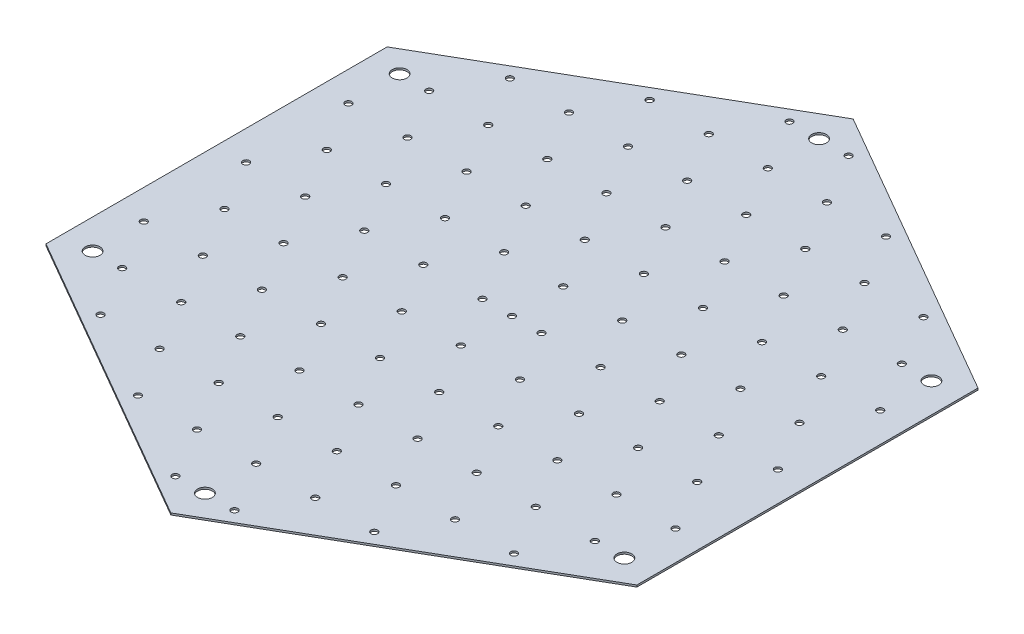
ISO-10303-21;
HEADER;
FILE_DESCRIPTION(('STEP AP214'),'2;1');
FILE_NAME('part.step','',(''),(''),'','','');
FILE_SCHEMA(('AUTOMOTIVE_DESIGN { 1 0 10303 214 1 1 1 1 }'));
ENDSEC;
DATA;
#1=APPLICATION_CONTEXT('core data for automotive mechanical design processes');
#2=APPLICATION_PROTOCOL_DEFINITION('international standard','automotive_design',2000,#1);
#3=PRODUCT_CONTEXT('',#1,'mechanical');
#4=PRODUCT('Part','Part','',(#3));
#5=PRODUCT_RELATED_PRODUCT_CATEGORY('part','',(#4));
#6=PRODUCT_DEFINITION_FORMATION('','',#4);
#7=PRODUCT_DEFINITION_CONTEXT('part definition',#1,'design');
#8=PRODUCT_DEFINITION('design','',#6,#7);
#9=PRODUCT_DEFINITION_SHAPE('','',#8);
#10=(LENGTH_UNIT() NAMED_UNIT(*) SI_UNIT(.MILLI.,.METRE.));
#11=(NAMED_UNIT(*) PLANE_ANGLE_UNIT() SI_UNIT($,.RADIAN.));
#12=(NAMED_UNIT(*) SI_UNIT($,.STERADIAN.) SOLID_ANGLE_UNIT());
#13=UNCERTAINTY_MEASURE_WITH_UNIT(LENGTH_MEASURE(1.E-05),#10,'distance_accuracy_value','');
#14=(GEOMETRIC_REPRESENTATION_CONTEXT(3) GLOBAL_UNCERTAINTY_ASSIGNED_CONTEXT((#13)) GLOBAL_UNIT_ASSIGNED_CONTEXT((#10,
#11,#12)) REPRESENTATION_CONTEXT('',''));
#15=CARTESIAN_POINT('',(0.,0.,0.));
#16=DIRECTION('',(0.,0.,1.));
#17=DIRECTION('',(1.,0.,0.));
#18=AXIS2_PLACEMENT_3D('',#15,#16,#17);
#19=CARTESIAN_POINT('',(54.1265877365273,0.34,-31.25));
#20=DIRECTION('',(-0.5,0.,0.866025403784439));
#21=DIRECTION('',(0.866025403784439,0.,0.5));
#22=AXIS2_PLACEMENT_3D('',#19,#20,#21);
#23=PLANE('',#22);
#24=DIRECTION('',(-0.866025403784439,0.,-0.5));
#25=VECTOR('',#24,1.);
#26=CARTESIAN_POINT('',(54.1265877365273,0.,-31.25));
#27=LINE('',#26,#25);
#28=CARTESIAN_POINT('',(54.1265877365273,0.,-31.25));
#29=VERTEX_POINT('',#28);
#30=CARTESIAN_POINT('',(0.,0.,-62.5));
#31=VERTEX_POINT('',#30);
#32=EDGE_CURVE('E117',#29,#31,#27,.T.);
#33=ORIENTED_EDGE('',*,*,#32,.T.);
#34=DIRECTION('',(0.,-1.,0.));
#35=VECTOR('',#34,1.);
#36=CARTESIAN_POINT('',(0.,0.34,-62.5));
#37=LINE('',#36,#35);
#38=CARTESIAN_POINT('',(0.,0.34,-62.5));
#39=VERTEX_POINT('',#38);
#40=EDGE_CURVE('E11',#39,#31,#37,.T.);
#41=ORIENTED_EDGE('',*,*,#40,.F.);
#42=DIRECTION('',(-0.866025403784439,0.,-0.5));
#43=VECTOR('',#42,1.);
#44=CARTESIAN_POINT('',(54.1265877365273,0.34,-31.25));
#45=LINE('',#44,#43);
#46=CARTESIAN_POINT('',(54.1265877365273,0.34,-31.25));
#47=VERTEX_POINT('',#46);
#48=EDGE_CURVE('E84',#47,#39,#45,.T.);
#49=ORIENTED_EDGE('',*,*,#48,.F.);
#50=DIRECTION('',(0.,-1.,0.));
#51=VECTOR('',#50,1.);
#52=CARTESIAN_POINT('',(54.1265877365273,0.34,-31.25));
#53=LINE('',#52,#51);
#54=EDGE_CURVE('E113',#47,#29,#53,.T.);
#55=ORIENTED_EDGE('',*,*,#54,.T.);
#56=EDGE_LOOP('',(#33,#41,#49,#55));
#57=FACE_BOUND('',#56,.T.);
#58=ADVANCED_FACE('F33',(#57),#23,.F.);
#59=CARTESIAN_POINT('',(0.,0.34,-62.5));
#60=DIRECTION('',(0.5,0.,0.866025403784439));
#61=DIRECTION('',(0.866025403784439,0.,-0.5));
#62=AXIS2_PLACEMENT_3D('',#59,#60,#61);
#63=PLANE('',#62);
#64=DIRECTION('',(0.,-1.,0.));
#65=VECTOR('',#64,1.);
#66=CARTESIAN_POINT('',(-54.1265877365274,0.34,-31.25));
#67=LINE('',#66,#65);
#68=CARTESIAN_POINT('',(-54.1265877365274,0.34,-31.25));
#69=VERTEX_POINT('',#68);
#70=CARTESIAN_POINT('',(-54.1265877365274,0.,-31.25));
#71=VERTEX_POINT('',#70);
#72=EDGE_CURVE('E41',#69,#71,#67,.T.);
#73=ORIENTED_EDGE('',*,*,#72,.F.);
#74=DIRECTION('',(-0.866025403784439,0.,0.5));
#75=VECTOR('',#74,1.);
#76=CARTESIAN_POINT('',(0.,0.34,-62.5));
#77=LINE('',#76,#75);
#78=EDGE_CURVE('E1858',#39,#69,#77,.T.);
#79=ORIENTED_EDGE('',*,*,#78,.F.);
#80=ORIENTED_EDGE('',*,*,#40,.T.);
#81=DIRECTION('',(-0.866025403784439,0.,0.5));
#82=VECTOR('',#81,1.);
#83=CARTESIAN_POINT('',(0.,0.,-62.5));
#84=LINE('',#83,#82);
#85=EDGE_CURVE('E119',#31,#71,#84,.T.);
#86=ORIENTED_EDGE('',*,*,#85,.T.);
#87=EDGE_LOOP('',(#73,#79,#80,#86));
#88=FACE_BOUND('',#87,.T.);
#89=ADVANCED_FACE('F154',(#88),#63,.F.);
#90=CARTESIAN_POINT('',(-54.1265877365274,0.34,-31.25));
#91=DIRECTION('',(1.,0.,0.));
#92=DIRECTION('',(0.,0.,-1.));
#93=AXIS2_PLACEMENT_3D('',#90,#91,#92);
#94=PLANE('',#93);
#95=DIRECTION('',(0.,0.,1.));
#96=VECTOR('',#95,1.);
#97=CARTESIAN_POINT('',(-54.1265877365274,0.,-31.25));
#98=LINE('',#97,#96);
#99=CARTESIAN_POINT('',(-54.1265877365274,0.,31.25));
#100=VERTEX_POINT('',#99);
#101=EDGE_CURVE('E122',#71,#100,#98,.T.);
#102=ORIENTED_EDGE('',*,*,#101,.T.);
#103=DIRECTION('',(0.,-1.,0.));
#104=VECTOR('',#103,1.);
#105=CARTESIAN_POINT('',(-54.1265877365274,0.34,31.25));
#106=LINE('',#105,#104);
#107=CARTESIAN_POINT('',(-54.1265877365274,0.34,31.25));
#108=VERTEX_POINT('',#107);
#109=EDGE_CURVE('E108',#108,#100,#106,.T.);
#110=ORIENTED_EDGE('',*,*,#109,.F.);
#111=DIRECTION('',(0.,0.,1.));
#112=VECTOR('',#111,1.);
#113=CARTESIAN_POINT('',(-54.1265877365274,0.34,-31.25));
#114=LINE('',#113,#112);
#115=EDGE_CURVE('E99',#69,#108,#114,.T.);
#116=ORIENTED_EDGE('',*,*,#115,.F.);
#117=ORIENTED_EDGE('',*,*,#72,.T.);
#118=EDGE_LOOP('',(#102,#110,#116,#117));
#119=FACE_BOUND('',#118,.T.);
#120=ADVANCED_FACE('F133',(#119),#94,.F.);
#121=CARTESIAN_POINT('',(-54.1265877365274,0.34,31.25));
#122=DIRECTION('',(0.5,0.,-0.866025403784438));
#123=DIRECTION('',(-0.866025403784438,0.,-0.5));
#124=AXIS2_PLACEMENT_3D('',#121,#122,#123);
#125=PLANE('',#124);
#126=DIRECTION('',(0.866025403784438,0.,0.5));
#127=VECTOR('',#126,1.);
#128=CARTESIAN_POINT('',(-54.1265877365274,0.,31.25));
#129=LINE('',#128,#127);
#130=CARTESIAN_POINT('',(0.,0.,62.5));
#131=VERTEX_POINT('',#130);
#132=EDGE_CURVE('E107',#100,#131,#129,.T.);
#133=ORIENTED_EDGE('',*,*,#132,.T.);
#134=DIRECTION('',(0.,-1.,0.));
#135=VECTOR('',#134,1.);
#136=CARTESIAN_POINT('',(0.,0.34,62.5));
#137=LINE('',#136,#135);
#138=CARTESIAN_POINT('',(0.,0.34,62.5));
#139=VERTEX_POINT('',#138);
#140=EDGE_CURVE('E104',#139,#131,#137,.T.);
#141=ORIENTED_EDGE('',*,*,#140,.F.);
#142=DIRECTION('',(0.866025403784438,0.,0.5));
#143=VECTOR('',#142,1.);
#144=CARTESIAN_POINT('',(-54.1265877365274,0.34,31.25));
#145=LINE('',#144,#143);
#146=EDGE_CURVE('E92',#108,#139,#145,.T.);
#147=ORIENTED_EDGE('',*,*,#146,.F.);
#148=ORIENTED_EDGE('',*,*,#109,.T.);
#149=EDGE_LOOP('',(#133,#141,#147,#148));
#150=FACE_BOUND('',#149,.T.);
#151=ADVANCED_FACE('F105',(#150),#125,.F.);
#152=CARTESIAN_POINT('',(0.,0.34,62.5));
#153=DIRECTION('',(-0.5,0.,-0.866025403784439));
#154=DIRECTION('',(-0.866025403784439,0.,0.5));
#155=AXIS2_PLACEMENT_3D('',#152,#153,#154);
#156=PLANE('',#155);
#157=DIRECTION('',(0.866025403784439,0.,-0.5));
#158=VECTOR('',#157,1.);
#159=CARTESIAN_POINT('',(0.,0.,62.5));
#160=LINE('',#159,#158);
#161=CARTESIAN_POINT('',(54.1265877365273,0.,31.25));
#162=VERTEX_POINT('',#161);
#163=EDGE_CURVE('E72',#131,#162,#160,.T.);
#164=ORIENTED_EDGE('',*,*,#163,.T.);
#165=DIRECTION('',(0.,-1.,0.));
#166=VECTOR('',#165,1.);
#167=CARTESIAN_POINT('',(54.1265877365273,0.34,31.25));
#168=LINE('',#167,#166);
#169=CARTESIAN_POINT('',(54.1265877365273,0.34,31.25));
#170=VERTEX_POINT('',#169);
#171=EDGE_CURVE('E109',#170,#162,#168,.T.);
#172=ORIENTED_EDGE('',*,*,#171,.F.);
#173=DIRECTION('',(0.866025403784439,0.,-0.5));
#174=VECTOR('',#173,1.);
#175=CARTESIAN_POINT('',(0.,0.34,62.5));
#176=LINE('',#175,#174);
#177=EDGE_CURVE('E97',#139,#170,#176,.T.);
#178=ORIENTED_EDGE('',*,*,#177,.F.);
#179=ORIENTED_EDGE('',*,*,#140,.T.);
#180=EDGE_LOOP('',(#164,#172,#178,#179));
#181=FACE_BOUND('',#180,.T.);
#182=ADVANCED_FACE('F111',(#181),#156,.F.);
#183=CARTESIAN_POINT('',(54.1265877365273,0.34,31.25));
#184=DIRECTION('',(-1.,0.,0.));
#185=DIRECTION('',(0.,0.,1.));
#186=AXIS2_PLACEMENT_3D('',#183,#184,#185);
#187=PLANE('',#186);
#188=ORIENTED_EDGE('',*,*,#54,.F.);
#189=DIRECTION('',(0.,0.,-1.));
#190=VECTOR('',#189,1.);
#191=CARTESIAN_POINT('',(54.1265877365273,0.34,31.25));
#192=LINE('',#191,#190);
#193=EDGE_CURVE('E49',#170,#47,#192,.T.);
#194=ORIENTED_EDGE('',*,*,#193,.F.);
#195=ORIENTED_EDGE('',*,*,#171,.T.);
#196=DIRECTION('',(0.,0.,-1.));
#197=VECTOR('',#196,1.);
#198=CARTESIAN_POINT('',(54.1265877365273,0.,31.25));
#199=LINE('',#198,#197);
#200=EDGE_CURVE('E78',#162,#29,#199,.T.);
#201=ORIENTED_EDGE('',*,*,#200,.T.);
#202=EDGE_LOOP('',(#188,#194,#195,#201));
#203=FACE_BOUND('',#202,.T.);
#204=ADVANCED_FACE('F142',(#203),#187,.F.);
#205=CARTESIAN_POINT('',(0.,0.34,0.));
#206=DIRECTION('',(0.,1.,0.));
#207=DIRECTION('',(0.,0.,1.));
#208=AXIS2_PLACEMENT_3D('',#205,#206,#207);
#209=PLANE('',#208);
#210=CARTESIAN_POINT('',(48.71385,0.34,-18.7499696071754));
#211=DIRECTION('',(0.,1.,0.));
#212=DIRECTION('',(0.,0.,1.));
#213=AXIS2_PLACEMENT_3D('',#210,#211,#212);
#214=CIRCLE('',#213,0.599999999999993);
#215=CARTESIAN_POINT('',(48.71385,0.34,-18.1499696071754));
#216=VERTEX_POINT('',#215);
#217=EDGE_CURVE('E1242',#216,#216,#214,.T.);
#218=ORIENTED_EDGE('',*,*,#217,.F.);
#219=EDGE_LOOP('',(#218));
#220=FACE_BOUND('',#219,.T.);
#221=CARTESIAN_POINT('',(43.3012,0.34,-28.1249544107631));
#222=DIRECTION('',(0.,1.,0.));
#223=DIRECTION('',(0.,0.,1.));
#224=AXIS2_PLACEMENT_3D('',#221,#222,#223);
#225=CIRCLE('',#224,0.6);
#226=CARTESIAN_POINT('',(43.3012,0.34,-27.5249544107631));
#227=VERTEX_POINT('',#226);
#228=EDGE_CURVE('E1244',#227,#227,#225,.T.);
#229=ORIENTED_EDGE('',*,*,#228,.F.);
#230=EDGE_LOOP('',(#229));
#231=FACE_BOUND('',#230,.T.);
#232=CARTESIAN_POINT('',(37.88855,0.34,-37.4999392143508));
#233=DIRECTION('',(0.,1.,0.));
#234=DIRECTION('',(0.,0.,1.));
#235=AXIS2_PLACEMENT_3D('',#232,#233,#234);
#236=CIRCLE('',#235,0.6);
#237=CARTESIAN_POINT('',(37.88855,0.34,-36.8999392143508));
#238=VERTEX_POINT('',#237);
#239=EDGE_CURVE('E1250',#238,#238,#236,.T.);
#240=ORIENTED_EDGE('',*,*,#239,.F.);
#241=EDGE_LOOP('',(#240));
#242=FACE_BOUND('',#241,.T.);
#243=CARTESIAN_POINT('',(-21.6506,0.34,46.8749240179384));
#244=DIRECTION('',(0.,1.,0.));
#245=DIRECTION('',(0.,0.,1.));
#246=AXIS2_PLACEMENT_3D('',#243,#244,#245);
#247=CIRCLE('',#246,0.600000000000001);
#248=CARTESIAN_POINT('',(-21.6506,0.34,47.4749240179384));
#249=VERTEX_POINT('',#248);
#250=EDGE_CURVE('E1256',#249,#249,#247,.T.);
#251=ORIENTED_EDGE('',*,*,#250,.F.);
#252=EDGE_LOOP('',(#251));
#253=FACE_BOUND('',#252,.T.);
#254=CARTESIAN_POINT('',(-5.41265000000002,0.34,56.2499088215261));
#255=DIRECTION('',(0.,1.,0.));
#256=DIRECTION('',(0.,0.,1.));
#257=AXIS2_PLACEMENT_3D('',#254,#255,#256);
#258=CIRCLE('',#257,0.600000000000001);
#259=CARTESIAN_POINT('',(-5.41265000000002,0.34,56.8499088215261));
#260=VERTEX_POINT('',#259);
#261=EDGE_CURVE('E1262',#260,#260,#258,.T.);
#262=ORIENTED_EDGE('',*,*,#261,.F.);
#263=EDGE_LOOP('',(#262));
#264=FACE_BOUND('',#263,.T.);
#265=CARTESIAN_POINT('',(-10.8253,0.34,46.8749240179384));
#266=DIRECTION('',(0.,1.,0.));
#267=DIRECTION('',(0.,0.,1.));
#268=AXIS2_PLACEMENT_3D('',#265,#266,#267);
#269=CIRCLE('',#268,0.600000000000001);
#270=CARTESIAN_POINT('',(-10.8253,0.34,47.4749240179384));
#271=VERTEX_POINT('',#270);
#272=EDGE_CURVE('E1268',#271,#271,#269,.T.);
#273=ORIENTED_EDGE('',*,*,#272,.F.);
#274=EDGE_LOOP('',(#273));
#275=FACE_BOUND('',#274,.T.);
#276=CARTESIAN_POINT('',(-16.23795,0.34,37.4999392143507));
#277=DIRECTION('',(0.,1.,0.));
#278=DIRECTION('',(0.,0.,1.));
#279=AXIS2_PLACEMENT_3D('',#276,#277,#278);
#280=CIRCLE('',#279,0.600000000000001);
#281=CARTESIAN_POINT('',(-16.23795,0.34,38.0999392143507));
#282=VERTEX_POINT('',#281);
#283=EDGE_CURVE('E1274',#282,#282,#280,.T.);
#284=ORIENTED_EDGE('',*,*,#283,.F.);
#285=EDGE_LOOP('',(#284));
#286=FACE_BOUND('',#285,.T.);
#287=CARTESIAN_POINT('',(-48.71385,0.34,-18.7499696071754));
#288=DIRECTION('',(0.,1.,0.));
#289=DIRECTION('',(0.,0.,1.));
#290=AXIS2_PLACEMENT_3D('',#287,#288,#289);
#291=CIRCLE('',#290,0.600000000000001);
#292=CARTESIAN_POINT('',(-48.71385,0.34,-18.1499696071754));
#293=VERTEX_POINT('',#292);
#294=EDGE_CURVE('E1280',#293,#293,#291,.T.);
#295=ORIENTED_EDGE('',*,*,#294,.F.);
#296=EDGE_LOOP('',(#295));
#297=FACE_BOUND('',#296,.T.);
#298=CARTESIAN_POINT('',(5.41264999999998,0.34,56.2499088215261));
#299=DIRECTION('',(0.,1.,0.));
#300=DIRECTION('',(0.,0.,1.));
#301=AXIS2_PLACEMENT_3D('',#298,#299,#300);
#302=CIRCLE('',#301,0.6);
#303=CARTESIAN_POINT('',(5.41264999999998,0.34,56.8499088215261));
#304=VERTEX_POINT('',#303);
#305=EDGE_CURVE('E1286',#304,#304,#302,.T.);
#306=ORIENTED_EDGE('',*,*,#305,.F.);
#307=EDGE_LOOP('',(#306));
#308=FACE_BOUND('',#307,.T.);
#309=CARTESIAN_POINT('',(0.,0.34,46.8749240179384));
#310=DIRECTION('',(0.,1.,0.));
#311=DIRECTION('',(0.,0.,1.));
#312=AXIS2_PLACEMENT_3D('',#309,#310,#311);
#313=CIRCLE('',#312,0.6);
#314=CARTESIAN_POINT('',(0.,0.34,47.4749240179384));
#315=VERTEX_POINT('',#314);
#316=EDGE_CURVE('E1292',#315,#315,#313,.T.);
#317=ORIENTED_EDGE('',*,*,#316,.F.);
#318=EDGE_LOOP('',(#317));
#319=FACE_BOUND('',#318,.T.);
#320=CARTESIAN_POINT('',(-5.41265000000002,0.34,37.4999392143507));
#321=DIRECTION('',(0.,1.,0.));
#322=DIRECTION('',(0.,0.,1.));
#323=AXIS2_PLACEMENT_3D('',#320,#321,#322);
#324=CIRCLE('',#323,0.6);
#325=CARTESIAN_POINT('',(-5.41265000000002,0.34,38.0999392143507));
#326=VERTEX_POINT('',#325);
#327=EDGE_CURVE('E1298',#326,#326,#324,.T.);
#328=ORIENTED_EDGE('',*,*,#327,.F.);
#329=EDGE_LOOP('',(#328));
#330=FACE_BOUND('',#329,.T.);
#331=CARTESIAN_POINT('',(-10.8253,0.34,28.124954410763));
#332=DIRECTION('',(0.,1.,0.));
#333=DIRECTION('',(0.,0.,1.));
#334=AXIS2_PLACEMENT_3D('',#331,#332,#333);
#335=CIRCLE('',#334,0.6);
#336=CARTESIAN_POINT('',(-10.8253,0.34,28.7249544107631));
#337=VERTEX_POINT('',#336);
#338=EDGE_CURVE('E1304',#337,#337,#335,.T.);
#339=ORIENTED_EDGE('',*,*,#338,.F.);
#340=EDGE_LOOP('',(#339));
#341=FACE_BOUND('',#340,.T.);
#342=CARTESIAN_POINT('',(-43.3012,0.34,-28.1249544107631));
#343=DIRECTION('',(0.,1.,0.));
#344=DIRECTION('',(0.,0.,1.));
#345=AXIS2_PLACEMENT_3D('',#342,#343,#344);
#346=CIRCLE('',#345,0.6);
#347=CARTESIAN_POINT('',(-43.3012,0.34,-27.5249544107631));
#348=VERTEX_POINT('',#347);
#349=EDGE_CURVE('E1310',#348,#348,#346,.T.);
#350=ORIENTED_EDGE('',*,*,#349,.F.);
#351=EDGE_LOOP('',(#350));
#352=FACE_BOUND('',#351,.T.);
#353=CARTESIAN_POINT('',(10.8253,0.34,46.8749240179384));
#354=DIRECTION('',(0.,1.,0.));
#355=DIRECTION('',(0.,0.,1.));
#356=AXIS2_PLACEMENT_3D('',#353,#354,#355);
#357=CIRCLE('',#356,0.6);
#358=CARTESIAN_POINT('',(10.8253,0.34,47.4749240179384));
#359=VERTEX_POINT('',#358);
#360=EDGE_CURVE('E1316',#359,#359,#357,.T.);
#361=ORIENTED_EDGE('',*,*,#360,.F.);
#362=EDGE_LOOP('',(#361));
#363=FACE_BOUND('',#362,.T.);
#364=CARTESIAN_POINT('',(5.41264999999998,0.34,37.4999392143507));
#365=DIRECTION('',(0.,1.,0.));
#366=DIRECTION('',(0.,0.,1.));
#367=AXIS2_PLACEMENT_3D('',#364,#365,#366);
#368=CIRCLE('',#367,0.6);
#369=CARTESIAN_POINT('',(5.41264999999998,0.34,38.0999392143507));
#370=VERTEX_POINT('',#369);
#371=EDGE_CURVE('E1322',#370,#370,#368,.T.);
#372=ORIENTED_EDGE('',*,*,#371,.F.);
#373=EDGE_LOOP('',(#372));
#374=FACE_BOUND('',#373,.T.);
#375=CARTESIAN_POINT('',(0.,0.34,28.124954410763));
#376=DIRECTION('',(0.,1.,0.));
#377=DIRECTION('',(0.,0.,1.));
#378=AXIS2_PLACEMENT_3D('',#375,#376,#377);
#379=CIRCLE('',#378,0.6);
#380=CARTESIAN_POINT('',(0.,0.34,28.7249544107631));
#381=VERTEX_POINT('',#380);
#382=EDGE_CURVE('E1328',#381,#381,#379,.T.);
#383=ORIENTED_EDGE('',*,*,#382,.F.);
#384=EDGE_LOOP('',(#383));
#385=FACE_BOUND('',#384,.T.);
#386=CARTESIAN_POINT('',(-5.41265000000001,0.34,18.7499696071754));
#387=DIRECTION('',(0.,1.,0.));
#388=DIRECTION('',(0.,0.,1.));
#389=AXIS2_PLACEMENT_3D('',#386,#387,#388);
#390=CIRCLE('',#389,0.6);
#391=CARTESIAN_POINT('',(-5.41265000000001,0.34,19.3499696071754));
#392=VERTEX_POINT('',#391);
#393=EDGE_CURVE('E1334',#392,#392,#390,.T.);
#394=ORIENTED_EDGE('',*,*,#393,.F.);
#395=EDGE_LOOP('',(#394));
#396=FACE_BOUND('',#395,.T.);
#397=CARTESIAN_POINT('',(-37.88855,0.34,-37.4999392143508));
#398=DIRECTION('',(0.,1.,0.));
#399=DIRECTION('',(0.,0.,1.));
#400=AXIS2_PLACEMENT_3D('',#397,#398,#399);
#401=CIRCLE('',#400,0.6);
#402=CARTESIAN_POINT('',(-37.88855,0.34,-36.8999392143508));
#403=VERTEX_POINT('',#402);
#404=EDGE_CURVE('E1340',#403,#403,#401,.T.);
#405=ORIENTED_EDGE('',*,*,#404,.F.);
#406=EDGE_LOOP('',(#405));
#407=FACE_BOUND('',#406,.T.);
#408=CARTESIAN_POINT('',(21.6506,0.34,46.8749240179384));
#409=DIRECTION('',(0.,1.,0.));
#410=DIRECTION('',(0.,0.,1.));
#411=AXIS2_PLACEMENT_3D('',#408,#409,#410);
#412=CIRCLE('',#411,0.6);
#413=CARTESIAN_POINT('',(21.6506,0.34,47.4749240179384));
#414=VERTEX_POINT('',#413);
#415=EDGE_CURVE('E1346',#414,#414,#412,.T.);
#416=ORIENTED_EDGE('',*,*,#415,.F.);
#417=EDGE_LOOP('',(#416));
#418=FACE_BOUND('',#417,.T.);
#419=CARTESIAN_POINT('',(16.23795,0.34,37.4999392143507));
#420=DIRECTION('',(0.,1.,0.));
#421=DIRECTION('',(0.,0.,1.));
#422=AXIS2_PLACEMENT_3D('',#419,#420,#421);
#423=CIRCLE('',#422,0.6);
#424=CARTESIAN_POINT('',(16.23795,0.34,38.0999392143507));
#425=VERTEX_POINT('',#424);
#426=EDGE_CURVE('E1352',#425,#425,#423,.T.);
#427=ORIENTED_EDGE('',*,*,#426,.F.);
#428=EDGE_LOOP('',(#427));
#429=FACE_BOUND('',#428,.T.);
#430=CARTESIAN_POINT('',(10.8253,0.34,28.124954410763));
#431=DIRECTION('',(0.,1.,0.));
#432=DIRECTION('',(0.,0.,1.));
#433=AXIS2_PLACEMENT_3D('',#430,#431,#432);
#434=CIRCLE('',#433,0.6);
#435=CARTESIAN_POINT('',(10.8253,0.34,28.7249544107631));
#436=VERTEX_POINT('',#435);
#437=EDGE_CURVE('E1358',#436,#436,#434,.T.);
#438=ORIENTED_EDGE('',*,*,#437,.F.);
#439=EDGE_LOOP('',(#438));
#440=FACE_BOUND('',#439,.T.);
#441=CARTESIAN_POINT('',(5.41264999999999,0.34,18.7499696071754));
#442=DIRECTION('',(0.,1.,0.));
#443=DIRECTION('',(0.,0.,1.));
#444=AXIS2_PLACEMENT_3D('',#441,#442,#443);
#445=CIRCLE('',#444,0.6);
#446=CARTESIAN_POINT('',(5.41264999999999,0.34,19.3499696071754));
#447=VERTEX_POINT('',#446);
#448=EDGE_CURVE('E1364',#447,#447,#445,.T.);
#449=ORIENTED_EDGE('',*,*,#448,.F.);
#450=EDGE_LOOP('',(#449));
#451=FACE_BOUND('',#450,.T.);
#452=CARTESIAN_POINT('',(0.,0.34,9.37498480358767));
#453=DIRECTION('',(0.,1.,0.));
#454=DIRECTION('',(0.,0.,1.));
#455=AXIS2_PLACEMENT_3D('',#452,#453,#454);
#456=CIRCLE('',#455,0.6);
#457=CARTESIAN_POINT('',(0.,0.34,9.97498480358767));
#458=VERTEX_POINT('',#457);
#459=EDGE_CURVE('E1370',#458,#458,#456,.T.);
#460=ORIENTED_EDGE('',*,*,#459,.F.);
#461=EDGE_LOOP('',(#460));
#462=FACE_BOUND('',#461,.T.);
#463=CARTESIAN_POINT('',(-27.06325,0.34,-37.4999392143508));
#464=DIRECTION('',(0.,1.,0.));
#465=DIRECTION('',(0.,0.,1.));
#466=AXIS2_PLACEMENT_3D('',#463,#464,#465);
#467=CIRCLE('',#466,0.600000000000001);
#468=CARTESIAN_POINT('',(-27.06325,0.34,-36.8999392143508));
#469=VERTEX_POINT('',#468);
#470=EDGE_CURVE('E1376',#469,#469,#467,.T.);
#471=ORIENTED_EDGE('',*,*,#470,.F.);
#472=EDGE_LOOP('',(#471));
#473=FACE_BOUND('',#472,.T.);
#474=CARTESIAN_POINT('',(-32.4759,0.34,-28.1249544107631));
#475=DIRECTION('',(0.,1.,0.));
#476=DIRECTION('',(0.,0.,1.));
#477=AXIS2_PLACEMENT_3D('',#474,#475,#476);
#478=CIRCLE('',#477,0.600000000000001);
#479=CARTESIAN_POINT('',(-32.4759,0.34,-27.5249544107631));
#480=VERTEX_POINT('',#479);
#481=EDGE_CURVE('E1382',#480,#480,#478,.T.);
#482=ORIENTED_EDGE('',*,*,#481,.F.);
#483=EDGE_LOOP('',(#482));
#484=FACE_BOUND('',#483,.T.);
#485=CARTESIAN_POINT('',(-37.88855,0.34,-18.7499696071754));
#486=DIRECTION('',(0.,1.,0.));
#487=DIRECTION('',(0.,0.,1.));
#488=AXIS2_PLACEMENT_3D('',#485,#486,#487);
#489=CIRCLE('',#488,0.600000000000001);
#490=CARTESIAN_POINT('',(-37.88855,0.34,-18.1499696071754));
#491=VERTEX_POINT('',#490);
#492=EDGE_CURVE('E1388',#491,#491,#489,.T.);
#493=ORIENTED_EDGE('',*,*,#492,.F.);
#494=EDGE_LOOP('',(#493));
#495=FACE_BOUND('',#494,.T.);
#496=CARTESIAN_POINT('',(-43.3012,0.34,-9.3749848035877));
#497=DIRECTION('',(0.,1.,0.));
#498=DIRECTION('',(0.,0.,1.));
#499=AXIS2_PLACEMENT_3D('',#496,#497,#498);
#500=CIRCLE('',#499,0.600000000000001);
#501=CARTESIAN_POINT('',(-43.3012,0.34,-8.7749848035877));
#502=VERTEX_POINT('',#501);
#503=EDGE_CURVE('E1394',#502,#502,#500,.T.);
#504=ORIENTED_EDGE('',*,*,#503,.F.);
#505=EDGE_LOOP('',(#504));
#506=FACE_BOUND('',#505,.T.);
#507=CARTESIAN_POINT('',(-21.6506,0.34,-28.1249544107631));
#508=DIRECTION('',(0.,1.,0.));
#509=DIRECTION('',(0.,0.,1.));
#510=AXIS2_PLACEMENT_3D('',#507,#508,#509);
#511=CIRCLE('',#510,0.600000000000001);
#512=CARTESIAN_POINT('',(-21.6506,0.34,-27.5249544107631));
#513=VERTEX_POINT('',#512);
#514=EDGE_CURVE('E1400',#513,#513,#511,.T.);
#515=ORIENTED_EDGE('',*,*,#514,.F.);
#516=EDGE_LOOP('',(#515));
#517=FACE_BOUND('',#516,.T.);
#518=CARTESIAN_POINT('',(-27.06325,0.34,-18.7499696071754));
#519=DIRECTION('',(0.,1.,0.));
#520=DIRECTION('',(0.,0.,1.));
#521=AXIS2_PLACEMENT_3D('',#518,#519,#520);
#522=CIRCLE('',#521,0.600000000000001);
#523=CARTESIAN_POINT('',(-27.06325,0.34,-18.1499696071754));
#524=VERTEX_POINT('',#523);
#525=EDGE_CURVE('E1406',#524,#524,#522,.T.);
#526=ORIENTED_EDGE('',*,*,#525,.F.);
#527=EDGE_LOOP('',(#526));
#528=FACE_BOUND('',#527,.T.);
#529=CARTESIAN_POINT('',(-32.4759,0.34,-9.3749848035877));
#530=DIRECTION('',(0.,1.,0.));
#531=DIRECTION('',(0.,0.,1.));
#532=AXIS2_PLACEMENT_3D('',#529,#530,#531);
#533=CIRCLE('',#532,0.600000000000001);
#534=CARTESIAN_POINT('',(-32.4759,0.34,-8.7749848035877));
#535=VERTEX_POINT('',#534);
#536=EDGE_CURVE('E1412',#535,#535,#533,.T.);
#537=ORIENTED_EDGE('',*,*,#536,.F.);
#538=EDGE_LOOP('',(#537));
#539=FACE_BOUND('',#538,.T.);
#540=CARTESIAN_POINT('',(-48.71385,0.34,18.7499696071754));
#541=DIRECTION('',(0.,1.,0.));
#542=DIRECTION('',(0.,0.,1.));
#543=AXIS2_PLACEMENT_3D('',#540,#541,#542);
#544=CIRCLE('',#543,0.600000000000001);
#545=CARTESIAN_POINT('',(-48.71385,0.34,19.3499696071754));
#546=VERTEX_POINT('',#545);
#547=EDGE_CURVE('E1418',#546,#546,#544,.T.);
#548=ORIENTED_EDGE('',*,*,#547,.F.);
#549=EDGE_LOOP('',(#548));
#550=FACE_BOUND('',#549,.T.);
#551=CARTESIAN_POINT('',(-43.3012,0.34,9.37498480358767));
#552=DIRECTION('',(0.,1.,0.));
#553=DIRECTION('',(0.,0.,1.));
#554=AXIS2_PLACEMENT_3D('',#551,#552,#553);
#555=CIRCLE('',#554,0.600000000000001);
#556=CARTESIAN_POINT('',(-43.3012,0.34,9.97498480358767));
#557=VERTEX_POINT('',#556);
#558=EDGE_CURVE('E1424',#557,#557,#555,.T.);
#559=ORIENTED_EDGE('',*,*,#558,.F.);
#560=EDGE_LOOP('',(#559));
#561=FACE_BOUND('',#560,.T.);
#562=CARTESIAN_POINT('',(-43.3012,0.34,28.124954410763));
#563=DIRECTION('',(0.,1.,0.));
#564=DIRECTION('',(0.,0.,1.));
#565=AXIS2_PLACEMENT_3D('',#562,#563,#564);
#566=CIRCLE('',#565,0.6);
#567=CARTESIAN_POINT('',(-43.3012,0.34,28.7249544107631));
#568=VERTEX_POINT('',#567);
#569=EDGE_CURVE('E1430',#568,#568,#566,.T.);
#570=ORIENTED_EDGE('',*,*,#569,.F.);
#571=EDGE_LOOP('',(#570));
#572=FACE_BOUND('',#571,.T.);
#573=CARTESIAN_POINT('',(-37.88855,0.34,18.7499696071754));
#574=DIRECTION('',(0.,1.,0.));
#575=DIRECTION('',(0.,0.,1.));
#576=AXIS2_PLACEMENT_3D('',#573,#574,#575);
#577=CIRCLE('',#576,0.6);
#578=CARTESIAN_POINT('',(-37.88855,0.34,19.3499696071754));
#579=VERTEX_POINT('',#578);
#580=EDGE_CURVE('E1436',#579,#579,#577,.T.);
#581=ORIENTED_EDGE('',*,*,#580,.F.);
#582=EDGE_LOOP('',(#581));
#583=FACE_BOUND('',#582,.T.);
#584=CARTESIAN_POINT('',(-32.4759,0.34,9.37498480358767));
#585=DIRECTION('',(0.,1.,0.));
#586=DIRECTION('',(0.,0.,1.));
#587=AXIS2_PLACEMENT_3D('',#584,#585,#586);
#588=CIRCLE('',#587,0.6);
#589=CARTESIAN_POINT('',(-32.4759,0.34,9.97498480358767));
#590=VERTEX_POINT('',#589);
#591=EDGE_CURVE('E1442',#590,#590,#588,.T.);
#592=ORIENTED_EDGE('',*,*,#591,.F.);
#593=EDGE_LOOP('',(#592));
#594=FACE_BOUND('',#593,.T.);
#595=CARTESIAN_POINT('',(-16.23795,0.34,-18.7499696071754));
#596=DIRECTION('',(0.,1.,0.));
#597=DIRECTION('',(0.,0.,1.));
#598=AXIS2_PLACEMENT_3D('',#595,#596,#597);
#599=CIRCLE('',#598,0.6);
#600=CARTESIAN_POINT('',(-16.23795,0.34,-18.1499696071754));
#601=VERTEX_POINT('',#600);
#602=EDGE_CURVE('E1448',#601,#601,#599,.T.);
#603=ORIENTED_EDGE('',*,*,#602,.F.);
#604=EDGE_LOOP('',(#603));
#605=FACE_BOUND('',#604,.T.);
#606=CARTESIAN_POINT('',(-21.6506,0.34,-9.3749848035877));
#607=DIRECTION('',(0.,1.,0.));
#608=DIRECTION('',(0.,0.,1.));
#609=AXIS2_PLACEMENT_3D('',#606,#607,#608);
#610=CIRCLE('',#609,0.6);
#611=CARTESIAN_POINT('',(-21.6506,0.34,-8.7749848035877));
#612=VERTEX_POINT('',#611);
#613=EDGE_CURVE('E1454',#612,#612,#610,.T.);
#614=ORIENTED_EDGE('',*,*,#613,.F.);
#615=EDGE_LOOP('',(#614));
#616=FACE_BOUND('',#615,.T.);
#617=CARTESIAN_POINT('',(-37.88855,0.34,37.4999392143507));
#618=DIRECTION('',(0.,1.,0.));
#619=DIRECTION('',(0.,0.,1.));
#620=AXIS2_PLACEMENT_3D('',#617,#618,#619);
#621=CIRCLE('',#620,0.6);
#622=CARTESIAN_POINT('',(-37.88855,0.34,38.0999392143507));
#623=VERTEX_POINT('',#622);
#624=EDGE_CURVE('E1460',#623,#623,#621,.T.);
#625=ORIENTED_EDGE('',*,*,#624,.F.);
#626=EDGE_LOOP('',(#625));
#627=FACE_BOUND('',#626,.T.);
#628=CARTESIAN_POINT('',(-32.4759,0.34,28.124954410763));
#629=DIRECTION('',(0.,1.,0.));
#630=DIRECTION('',(0.,0.,1.));
#631=AXIS2_PLACEMENT_3D('',#628,#629,#630);
#632=CIRCLE('',#631,0.6);
#633=CARTESIAN_POINT('',(-32.4759,0.34,28.7249544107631));
#634=VERTEX_POINT('',#633);
#635=EDGE_CURVE('E1466',#634,#634,#632,.T.);
#636=ORIENTED_EDGE('',*,*,#635,.F.);
#637=EDGE_LOOP('',(#636));
#638=FACE_BOUND('',#637,.T.);
#639=CARTESIAN_POINT('',(-27.06325,0.34,18.7499696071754));
#640=DIRECTION('',(0.,1.,0.));
#641=DIRECTION('',(0.,0.,1.));
#642=AXIS2_PLACEMENT_3D('',#639,#640,#641);
#643=CIRCLE('',#642,0.6);
#644=CARTESIAN_POINT('',(-27.06325,0.34,19.3499696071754));
#645=VERTEX_POINT('',#644);
#646=EDGE_CURVE('E1472',#645,#645,#643,.T.);
#647=ORIENTED_EDGE('',*,*,#646,.F.);
#648=EDGE_LOOP('',(#647));
#649=FACE_BOUND('',#648,.T.);
#650=CARTESIAN_POINT('',(-21.6506,0.34,9.37498480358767));
#651=DIRECTION('',(0.,1.,0.));
#652=DIRECTION('',(0.,0.,1.));
#653=AXIS2_PLACEMENT_3D('',#650,#651,#652);
#654=CIRCLE('',#653,0.6);
#655=CARTESIAN_POINT('',(-21.6506,0.34,9.97498480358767));
#656=VERTEX_POINT('',#655);
#657=EDGE_CURVE('E1478',#656,#656,#654,.T.);
#658=ORIENTED_EDGE('',*,*,#657,.F.);
#659=EDGE_LOOP('',(#658));
#660=FACE_BOUND('',#659,.T.);
#661=CARTESIAN_POINT('',(-10.8253,0.34,-9.3749848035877));
#662=DIRECTION('',(0.,1.,0.));
#663=DIRECTION('',(0.,0.,1.));
#664=AXIS2_PLACEMENT_3D('',#661,#662,#663);
#665=CIRCLE('',#664,0.6);
#666=CARTESIAN_POINT('',(-10.8253,0.34,-8.7749848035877));
#667=VERTEX_POINT('',#666);
#668=EDGE_CURVE('E1484',#667,#667,#665,.T.);
#669=ORIENTED_EDGE('',*,*,#668,.F.);
#670=EDGE_LOOP('',(#669));
#671=FACE_BOUND('',#670,.T.);
#672=CARTESIAN_POINT('',(-27.06325,0.34,37.4999392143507));
#673=DIRECTION('',(0.,1.,0.));
#674=DIRECTION('',(0.,0.,1.));
#675=AXIS2_PLACEMENT_3D('',#672,#673,#674);
#676=CIRCLE('',#675,0.6);
#677=CARTESIAN_POINT('',(-27.06325,0.34,38.0999392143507));
#678=VERTEX_POINT('',#677);
#679=EDGE_CURVE('E1490',#678,#678,#676,.T.);
#680=ORIENTED_EDGE('',*,*,#679,.F.);
#681=EDGE_LOOP('',(#680));
#682=FACE_BOUND('',#681,.T.);
#683=CARTESIAN_POINT('',(-21.6506,0.34,28.124954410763));
#684=DIRECTION('',(0.,1.,0.));
#685=DIRECTION('',(0.,0.,1.));
#686=AXIS2_PLACEMENT_3D('',#683,#684,#685);
#687=CIRCLE('',#686,0.6);
#688=CARTESIAN_POINT('',(-21.6506,0.34,28.7249544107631));
#689=VERTEX_POINT('',#688);
#690=EDGE_CURVE('E1496',#689,#689,#687,.T.);
#691=ORIENTED_EDGE('',*,*,#690,.F.);
#692=EDGE_LOOP('',(#691));
#693=FACE_BOUND('',#692,.T.);
#694=CARTESIAN_POINT('',(-16.23795,0.34,18.7499696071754));
#695=DIRECTION('',(0.,1.,0.));
#696=DIRECTION('',(0.,0.,1.));
#697=AXIS2_PLACEMENT_3D('',#694,#695,#696);
#698=CIRCLE('',#697,0.6);
#699=CARTESIAN_POINT('',(-16.23795,0.34,19.3499696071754));
#700=VERTEX_POINT('',#699);
#701=EDGE_CURVE('E1502',#700,#700,#698,.T.);
#702=ORIENTED_EDGE('',*,*,#701,.F.);
#703=EDGE_LOOP('',(#702));
#704=FACE_BOUND('',#703,.T.);
#705=CARTESIAN_POINT('',(-10.8253,0.34,9.37498480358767));
#706=DIRECTION('',(0.,1.,0.));
#707=DIRECTION('',(0.,0.,1.));
#708=AXIS2_PLACEMENT_3D('',#705,#706,#707);
#709=CIRCLE('',#708,0.6);
#710=CARTESIAN_POINT('',(-10.8253,0.34,9.97498480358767));
#711=VERTEX_POINT('',#710);
#712=EDGE_CURVE('E1508',#711,#711,#709,.T.);
#713=ORIENTED_EDGE('',*,*,#712,.F.);
#714=EDGE_LOOP('',(#713));
#715=FACE_BOUND('',#714,.T.);
#716=CARTESIAN_POINT('',(21.6506,0.34,-46.8749240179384));
#717=DIRECTION('',(0.,1.,0.));
#718=DIRECTION('',(0.,0.,1.));
#719=AXIS2_PLACEMENT_3D('',#716,#717,#718);
#720=CIRCLE('',#719,0.600000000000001);
#721=CARTESIAN_POINT('',(21.6506,0.34,-46.2749240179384));
#722=VERTEX_POINT('',#721);
#723=EDGE_CURVE('E1514',#722,#722,#720,.T.);
#724=ORIENTED_EDGE('',*,*,#723,.F.);
#725=EDGE_LOOP('',(#724));
#726=FACE_BOUND('',#725,.T.);
#727=CARTESIAN_POINT('',(27.06325,0.34,-37.4999392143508));
#728=DIRECTION('',(0.,1.,0.));
#729=DIRECTION('',(0.,0.,1.));
#730=AXIS2_PLACEMENT_3D('',#727,#728,#729);
#731=CIRCLE('',#730,0.600000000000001);
#732=CARTESIAN_POINT('',(27.06325,0.34,-36.8999392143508));
#733=VERTEX_POINT('',#732);
#734=EDGE_CURVE('E1520',#733,#733,#731,.T.);
#735=ORIENTED_EDGE('',*,*,#734,.F.);
#736=EDGE_LOOP('',(#735));
#737=FACE_BOUND('',#736,.T.);
#738=CARTESIAN_POINT('',(32.4759,0.34,-28.1249544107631));
#739=DIRECTION('',(0.,1.,0.));
#740=DIRECTION('',(0.,0.,1.));
#741=AXIS2_PLACEMENT_3D('',#738,#739,#740);
#742=CIRCLE('',#741,0.600000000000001);
#743=CARTESIAN_POINT('',(32.4759,0.34,-27.5249544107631));
#744=VERTEX_POINT('',#743);
#745=EDGE_CURVE('E1526',#744,#744,#742,.T.);
#746=ORIENTED_EDGE('',*,*,#745,.F.);
#747=EDGE_LOOP('',(#746));
#748=FACE_BOUND('',#747,.T.);
#749=CARTESIAN_POINT('',(37.88855,0.34,-18.7499696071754));
#750=DIRECTION('',(0.,1.,0.));
#751=DIRECTION('',(0.,0.,1.));
#752=AXIS2_PLACEMENT_3D('',#749,#750,#751);
#753=CIRCLE('',#752,0.600000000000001);
#754=CARTESIAN_POINT('',(37.88855,0.34,-18.1499696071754));
#755=VERTEX_POINT('',#754);
#756=EDGE_CURVE('E1532',#755,#755,#753,.T.);
#757=ORIENTED_EDGE('',*,*,#756,.F.);
#758=EDGE_LOOP('',(#757));
#759=FACE_BOUND('',#758,.T.);
#760=CARTESIAN_POINT('',(43.3012,0.34,-9.3749848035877));
#761=DIRECTION('',(0.,1.,0.));
#762=DIRECTION('',(0.,0.,1.));
#763=AXIS2_PLACEMENT_3D('',#760,#761,#762);
#764=CIRCLE('',#763,0.600000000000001);
#765=CARTESIAN_POINT('',(43.3012,0.34,-8.7749848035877));
#766=VERTEX_POINT('',#765);
#767=EDGE_CURVE('E1538',#766,#766,#764,.T.);
#768=ORIENTED_EDGE('',*,*,#767,.F.);
#769=EDGE_LOOP('',(#768));
#770=FACE_BOUND('',#769,.T.);
#771=CARTESIAN_POINT('',(48.71385,0.34,18.7499696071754));
#772=DIRECTION('',(0.,1.,0.));
#773=DIRECTION('',(0.,0.,1.));
#774=AXIS2_PLACEMENT_3D('',#771,#772,#773);
#775=CIRCLE('',#774,0.599999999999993);
#776=CARTESIAN_POINT('',(48.71385,0.34,19.3499696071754));
#777=VERTEX_POINT('',#776);
#778=EDGE_CURVE('E1544',#777,#777,#775,.T.);
#779=ORIENTED_EDGE('',*,*,#778,.F.);
#780=EDGE_LOOP('',(#779));
#781=FACE_BOUND('',#780,.T.);
#782=CARTESIAN_POINT('',(43.3012,0.34,9.37498480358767));
#783=DIRECTION('',(0.,1.,0.));
#784=DIRECTION('',(0.,0.,1.));
#785=AXIS2_PLACEMENT_3D('',#782,#783,#784);
#786=CIRCLE('',#785,0.599999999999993);
#787=CARTESIAN_POINT('',(43.3012,0.34,9.97498480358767));
#788=VERTEX_POINT('',#787);
#789=EDGE_CURVE('E1550',#788,#788,#786,.T.);
#790=ORIENTED_EDGE('',*,*,#789,.F.);
#791=EDGE_LOOP('',(#790));
#792=FACE_BOUND('',#791,.T.);
#793=CARTESIAN_POINT('',(5.41265000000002,0.34,-56.2499088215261));
#794=DIRECTION('',(0.,1.,0.));
#795=DIRECTION('',(0.,0.,1.));
#796=AXIS2_PLACEMENT_3D('',#793,#794,#795);
#797=CIRCLE('',#796,0.599999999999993);
#798=CARTESIAN_POINT('',(5.41265000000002,0.34,-55.6499088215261));
#799=VERTEX_POINT('',#798);
#800=EDGE_CURVE('E1556',#799,#799,#797,.T.);
#801=ORIENTED_EDGE('',*,*,#800,.F.);
#802=EDGE_LOOP('',(#801));
#803=FACE_BOUND('',#802,.T.);
#804=CARTESIAN_POINT('',(10.8253,0.34,-46.8749240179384));
#805=DIRECTION('',(0.,1.,0.));
#806=DIRECTION('',(0.,0.,1.));
#807=AXIS2_PLACEMENT_3D('',#804,#805,#806);
#808=CIRCLE('',#807,0.599999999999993);
#809=CARTESIAN_POINT('',(10.8253,0.34,-46.2749240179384));
#810=VERTEX_POINT('',#809);
#811=EDGE_CURVE('E1562',#810,#810,#808,.T.);
#812=ORIENTED_EDGE('',*,*,#811,.F.);
#813=EDGE_LOOP('',(#812));
#814=FACE_BOUND('',#813,.T.);
#815=CARTESIAN_POINT('',(16.23795,0.34,-37.4999392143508));
#816=DIRECTION('',(0.,1.,0.));
#817=DIRECTION('',(0.,0.,1.));
#818=AXIS2_PLACEMENT_3D('',#815,#816,#817);
#819=CIRCLE('',#818,0.599999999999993);
#820=CARTESIAN_POINT('',(16.23795,0.34,-36.8999392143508));
#821=VERTEX_POINT('',#820);
#822=EDGE_CURVE('E1568',#821,#821,#819,.T.);
#823=ORIENTED_EDGE('',*,*,#822,.F.);
#824=EDGE_LOOP('',(#823));
#825=FACE_BOUND('',#824,.T.);
#826=CARTESIAN_POINT('',(21.6506,0.34,-28.1249544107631));
#827=DIRECTION('',(0.,1.,0.));
#828=DIRECTION('',(0.,0.,1.));
#829=AXIS2_PLACEMENT_3D('',#826,#827,#828);
#830=CIRCLE('',#829,0.599999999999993);
#831=CARTESIAN_POINT('',(21.6506,0.34,-27.5249544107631));
#832=VERTEX_POINT('',#831);
#833=EDGE_CURVE('E1574',#832,#832,#830,.T.);
#834=ORIENTED_EDGE('',*,*,#833,.F.);
#835=EDGE_LOOP('',(#834));
#836=FACE_BOUND('',#835,.T.);
#837=CARTESIAN_POINT('',(27.06325,0.34,-18.7499696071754));
#838=DIRECTION('',(0.,1.,0.));
#839=DIRECTION('',(0.,0.,1.));
#840=AXIS2_PLACEMENT_3D('',#837,#838,#839);
#841=CIRCLE('',#840,0.599999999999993);
#842=CARTESIAN_POINT('',(27.06325,0.34,-18.1499696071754));
#843=VERTEX_POINT('',#842);
#844=EDGE_CURVE('E1580',#843,#843,#841,.T.);
#845=ORIENTED_EDGE('',*,*,#844,.F.);
#846=EDGE_LOOP('',(#845));
#847=FACE_BOUND('',#846,.T.);
#848=CARTESIAN_POINT('',(32.4759,0.34,-9.3749848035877));
#849=DIRECTION('',(0.,1.,0.));
#850=DIRECTION('',(0.,0.,1.));
#851=AXIS2_PLACEMENT_3D('',#848,#849,#850);
#852=CIRCLE('',#851,0.599999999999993);
#853=CARTESIAN_POINT('',(32.4759,0.34,-8.77498480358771));
#854=VERTEX_POINT('',#853);
#855=EDGE_CURVE('E1586',#854,#854,#852,.T.);
#856=ORIENTED_EDGE('',*,*,#855,.F.);
#857=EDGE_LOOP('',(#856));
#858=FACE_BOUND('',#857,.T.);
#859=CARTESIAN_POINT('',(43.3012,0.34,28.124954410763));
#860=DIRECTION('',(0.,1.,0.));
#861=DIRECTION('',(0.,0.,1.));
#862=AXIS2_PLACEMENT_3D('',#859,#860,#861);
#863=CIRCLE('',#862,0.6);
#864=CARTESIAN_POINT('',(43.3012,0.34,28.7249544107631));
#865=VERTEX_POINT('',#864);
#866=EDGE_CURVE('E1592',#865,#865,#863,.T.);
#867=ORIENTED_EDGE('',*,*,#866,.F.);
#868=EDGE_LOOP('',(#867));
#869=FACE_BOUND('',#868,.T.);
#870=CARTESIAN_POINT('',(37.88855,0.34,18.7499696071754));
#871=DIRECTION('',(0.,1.,0.));
#872=DIRECTION('',(0.,0.,1.));
#873=AXIS2_PLACEMENT_3D('',#870,#871,#872);
#874=CIRCLE('',#873,0.6);
#875=CARTESIAN_POINT('',(37.88855,0.34,19.3499696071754));
#876=VERTEX_POINT('',#875);
#877=EDGE_CURVE('E1598',#876,#876,#874,.T.);
#878=ORIENTED_EDGE('',*,*,#877,.F.);
#879=EDGE_LOOP('',(#878));
#880=FACE_BOUND('',#879,.T.);
#881=CARTESIAN_POINT('',(32.4759,0.34,9.37498480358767));
#882=DIRECTION('',(0.,1.,0.));
#883=DIRECTION('',(0.,0.,1.));
#884=AXIS2_PLACEMENT_3D('',#881,#882,#883);
#885=CIRCLE('',#884,0.6);
#886=CARTESIAN_POINT('',(32.4759,0.34,9.97498480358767));
#887=VERTEX_POINT('',#886);
#888=EDGE_CURVE('E1604',#887,#887,#885,.T.);
#889=ORIENTED_EDGE('',*,*,#888,.F.);
#890=EDGE_LOOP('',(#889));
#891=FACE_BOUND('',#890,.T.);
#892=CARTESIAN_POINT('',(-5.41264999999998,0.34,-56.2499088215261));
#893=DIRECTION('',(0.,1.,0.));
#894=DIRECTION('',(0.,0.,1.));
#895=AXIS2_PLACEMENT_3D('',#892,#893,#894);
#896=CIRCLE('',#895,0.6);
#897=CARTESIAN_POINT('',(-5.41264999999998,0.34,-55.6499088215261));
#898=VERTEX_POINT('',#897);
#899=EDGE_CURVE('E1610',#898,#898,#896,.T.);
#900=ORIENTED_EDGE('',*,*,#899,.F.);
#901=EDGE_LOOP('',(#900));
#902=FACE_BOUND('',#901,.T.);
#903=CARTESIAN_POINT('',(0.,0.34,-46.8749240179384));
#904=DIRECTION('',(0.,1.,0.));
#905=DIRECTION('',(0.,0.,1.));
#906=AXIS2_PLACEMENT_3D('',#903,#904,#905);
#907=CIRCLE('',#906,0.6);
#908=CARTESIAN_POINT('',(0.,0.34,-46.2749240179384));
#909=VERTEX_POINT('',#908);
#910=EDGE_CURVE('E1616',#909,#909,#907,.T.);
#911=ORIENTED_EDGE('',*,*,#910,.F.);
#912=EDGE_LOOP('',(#911));
#913=FACE_BOUND('',#912,.T.);
#914=CARTESIAN_POINT('',(5.41265000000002,0.34,-37.4999392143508));
#915=DIRECTION('',(0.,1.,0.));
#916=DIRECTION('',(0.,0.,1.));
#917=AXIS2_PLACEMENT_3D('',#914,#915,#916);
#918=CIRCLE('',#917,0.6);
#919=CARTESIAN_POINT('',(5.41265000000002,0.34,-36.8999392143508));
#920=VERTEX_POINT('',#919);
#921=EDGE_CURVE('E1622',#920,#920,#918,.T.);
#922=ORIENTED_EDGE('',*,*,#921,.F.);
#923=EDGE_LOOP('',(#922));
#924=FACE_BOUND('',#923,.T.);
#925=CARTESIAN_POINT('',(10.8253,0.34,-28.1249544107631));
#926=DIRECTION('',(0.,1.,0.));
#927=DIRECTION('',(0.,0.,1.));
#928=AXIS2_PLACEMENT_3D('',#925,#926,#927);
#929=CIRCLE('',#928,0.6);
#930=CARTESIAN_POINT('',(10.8253,0.34,-27.5249544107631));
#931=VERTEX_POINT('',#930);
#932=EDGE_CURVE('E1628',#931,#931,#929,.T.);
#933=ORIENTED_EDGE('',*,*,#932,.F.);
#934=EDGE_LOOP('',(#933));
#935=FACE_BOUND('',#934,.T.);
#936=CARTESIAN_POINT('',(16.23795,0.34,-18.7499696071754));
#937=DIRECTION('',(0.,1.,0.));
#938=DIRECTION('',(0.,0.,1.));
#939=AXIS2_PLACEMENT_3D('',#936,#937,#938);
#940=CIRCLE('',#939,0.6);
#941=CARTESIAN_POINT('',(16.23795,0.34,-18.1499696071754));
#942=VERTEX_POINT('',#941);
#943=EDGE_CURVE('E1634',#942,#942,#940,.T.);
#944=ORIENTED_EDGE('',*,*,#943,.F.);
#945=EDGE_LOOP('',(#944));
#946=FACE_BOUND('',#945,.T.);
#947=CARTESIAN_POINT('',(21.6506,0.34,-9.3749848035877));
#948=DIRECTION('',(0.,1.,0.));
#949=DIRECTION('',(0.,0.,1.));
#950=AXIS2_PLACEMENT_3D('',#947,#948,#949);
#951=CIRCLE('',#950,0.6);
#952=CARTESIAN_POINT('',(21.6506,0.34,-8.7749848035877));
#953=VERTEX_POINT('',#952);
#954=EDGE_CURVE('E1640',#953,#953,#951,.T.);
#955=ORIENTED_EDGE('',*,*,#954,.F.);
#956=EDGE_LOOP('',(#955));
#957=FACE_BOUND('',#956,.T.);
#958=CARTESIAN_POINT('',(-10.8253,0.34,-46.8749240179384));
#959=DIRECTION('',(0.,1.,0.));
#960=DIRECTION('',(0.,0.,1.));
#961=AXIS2_PLACEMENT_3D('',#958,#959,#960);
#962=CIRCLE('',#961,0.6);
#963=CARTESIAN_POINT('',(-10.8253,0.34,-46.2749240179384));
#964=VERTEX_POINT('',#963);
#965=EDGE_CURVE('E1646',#964,#964,#962,.T.);
#966=ORIENTED_EDGE('',*,*,#965,.F.);
#967=EDGE_LOOP('',(#966));
#968=FACE_BOUND('',#967,.T.);
#969=CARTESIAN_POINT('',(-5.41264999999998,0.34,-37.4999392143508));
#970=DIRECTION('',(0.,1.,0.));
#971=DIRECTION('',(0.,0.,1.));
#972=AXIS2_PLACEMENT_3D('',#969,#970,#971);
#973=CIRCLE('',#972,0.6);
#974=CARTESIAN_POINT('',(-5.41264999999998,0.34,-36.8999392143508));
#975=VERTEX_POINT('',#974);
#976=EDGE_CURVE('E1652',#975,#975,#973,.T.);
#977=ORIENTED_EDGE('',*,*,#976,.F.);
#978=EDGE_LOOP('',(#977));
#979=FACE_BOUND('',#978,.T.);
#980=CARTESIAN_POINT('',(0.,0.34,-28.1249544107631));
#981=DIRECTION('',(0.,1.,0.));
#982=DIRECTION('',(0.,0.,1.));
#983=AXIS2_PLACEMENT_3D('',#980,#981,#982);
#984=CIRCLE('',#983,0.6);
#985=CARTESIAN_POINT('',(0.,0.34,-27.5249544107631));
#986=VERTEX_POINT('',#985);
#987=EDGE_CURVE('E1658',#986,#986,#984,.T.);
#988=ORIENTED_EDGE('',*,*,#987,.F.);
#989=EDGE_LOOP('',(#988));
#990=FACE_BOUND('',#989,.T.);
#991=CARTESIAN_POINT('',(5.41265000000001,0.34,-18.7499696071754));
#992=DIRECTION('',(0.,1.,0.));
#993=DIRECTION('',(0.,0.,1.));
#994=AXIS2_PLACEMENT_3D('',#991,#992,#993);
#995=CIRCLE('',#994,0.6);
#996=CARTESIAN_POINT('',(5.41265000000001,0.34,-18.1499696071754));
#997=VERTEX_POINT('',#996);
#998=EDGE_CURVE('E1664',#997,#997,#995,.T.);
#999=ORIENTED_EDGE('',*,*,#998,.F.);
#1000=EDGE_LOOP('',(#999));
#1001=FACE_BOUND('',#1000,.T.);
#1002=CARTESIAN_POINT('',(10.8253,0.34,-9.3749848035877));
#1003=DIRECTION('',(0.,1.,0.));
#1004=DIRECTION('',(0.,0.,1.));
#1005=AXIS2_PLACEMENT_3D('',#1002,#1003,#1004);
#1006=CIRCLE('',#1005,0.6);
#1007=CARTESIAN_POINT('',(10.8253,0.34,-8.7749848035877));
#1008=VERTEX_POINT('',#1007);
#1009=EDGE_CURVE('E1670',#1008,#1008,#1006,.T.);
#1010=ORIENTED_EDGE('',*,*,#1009,.F.);
#1011=EDGE_LOOP('',(#1010));
#1012=FACE_BOUND('',#1011,.T.);
#1013=CARTESIAN_POINT('',(37.88855,0.34,37.4999392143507));
#1014=DIRECTION('',(0.,1.,0.));
#1015=DIRECTION('',(0.,0.,1.));
#1016=AXIS2_PLACEMENT_3D('',#1013,#1014,#1015);
#1017=CIRCLE('',#1016,0.6);
#1018=CARTESIAN_POINT('',(37.88855,0.34,38.0999392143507));
#1019=VERTEX_POINT('',#1018);
#1020=EDGE_CURVE('E1676',#1019,#1019,#1017,.T.);
#1021=ORIENTED_EDGE('',*,*,#1020,.F.);
#1022=EDGE_LOOP('',(#1021));
#1023=FACE_BOUND('',#1022,.T.);
#1024=CARTESIAN_POINT('',(32.4759,0.34,28.124954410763));
#1025=DIRECTION('',(0.,1.,0.));
#1026=DIRECTION('',(0.,0.,1.));
#1027=AXIS2_PLACEMENT_3D('',#1024,#1025,#1026);
#1028=CIRCLE('',#1027,0.6);
#1029=CARTESIAN_POINT('',(32.4759,0.34,28.7249544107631));
#1030=VERTEX_POINT('',#1029);
#1031=EDGE_CURVE('E1682',#1030,#1030,#1028,.T.);
#1032=ORIENTED_EDGE('',*,*,#1031,.F.);
#1033=EDGE_LOOP('',(#1032));
#1034=FACE_BOUND('',#1033,.T.);
#1035=CARTESIAN_POINT('',(27.06325,0.34,18.7499696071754));
#1036=DIRECTION('',(0.,1.,0.));
#1037=DIRECTION('',(0.,0.,1.));
#1038=AXIS2_PLACEMENT_3D('',#1035,#1036,#1037);
#1039=CIRCLE('',#1038,0.6);
#1040=CARTESIAN_POINT('',(27.06325,0.34,19.3499696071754));
#1041=VERTEX_POINT('',#1040);
#1042=EDGE_CURVE('E1688',#1041,#1041,#1039,.T.);
#1043=ORIENTED_EDGE('',*,*,#1042,.F.);
#1044=EDGE_LOOP('',(#1043));
#1045=FACE_BOUND('',#1044,.T.);
#1046=CARTESIAN_POINT('',(21.6506,0.34,9.37498480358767));
#1047=DIRECTION('',(0.,1.,0.));
#1048=DIRECTION('',(0.,0.,1.));
#1049=AXIS2_PLACEMENT_3D('',#1046,#1047,#1048);
#1050=CIRCLE('',#1049,0.6);
#1051=CARTESIAN_POINT('',(21.6506,0.34,9.97498480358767));
#1052=VERTEX_POINT('',#1051);
#1053=EDGE_CURVE('E1694',#1052,#1052,#1050,.T.);
#1054=ORIENTED_EDGE('',*,*,#1053,.F.);
#1055=EDGE_LOOP('',(#1054));
#1056=FACE_BOUND('',#1055,.T.);
#1057=CARTESIAN_POINT('',(27.06325,0.34,37.4999392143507));
#1058=DIRECTION('',(0.,1.,0.));
#1059=DIRECTION('',(0.,0.,1.));
#1060=AXIS2_PLACEMENT_3D('',#1057,#1058,#1059);
#1061=CIRCLE('',#1060,0.6);
#1062=CARTESIAN_POINT('',(27.06325,0.34,38.0999392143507));
#1063=VERTEX_POINT('',#1062);
#1064=EDGE_CURVE('E1700',#1063,#1063,#1061,.T.);
#1065=ORIENTED_EDGE('',*,*,#1064,.F.);
#1066=EDGE_LOOP('',(#1065));
#1067=FACE_BOUND('',#1066,.T.);
#1068=CARTESIAN_POINT('',(21.6506,0.34,28.124954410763));
#1069=DIRECTION('',(0.,1.,0.));
#1070=DIRECTION('',(0.,0.,1.));
#1071=AXIS2_PLACEMENT_3D('',#1068,#1069,#1070);
#1072=CIRCLE('',#1071,0.6);
#1073=CARTESIAN_POINT('',(21.6506,0.34,28.7249544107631));
#1074=VERTEX_POINT('',#1073);
#1075=EDGE_CURVE('E1706',#1074,#1074,#1072,.T.);
#1076=ORIENTED_EDGE('',*,*,#1075,.F.);
#1077=EDGE_LOOP('',(#1076));
#1078=FACE_BOUND('',#1077,.T.);
#1079=CARTESIAN_POINT('',(16.23795,0.34,18.7499696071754));
#1080=DIRECTION('',(0.,1.,0.));
#1081=DIRECTION('',(0.,0.,1.));
#1082=AXIS2_PLACEMENT_3D('',#1079,#1080,#1081);
#1083=CIRCLE('',#1082,0.6);
#1084=CARTESIAN_POINT('',(16.23795,0.34,19.3499696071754));
#1085=VERTEX_POINT('',#1084);
#1086=EDGE_CURVE('E1712',#1085,#1085,#1083,.T.);
#1087=ORIENTED_EDGE('',*,*,#1086,.F.);
#1088=EDGE_LOOP('',(#1087));
#1089=FACE_BOUND('',#1088,.T.);
#1090=CARTESIAN_POINT('',(10.8253,0.34,9.37498480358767));
#1091=DIRECTION('',(0.,1.,0.));
#1092=DIRECTION('',(0.,0.,1.));
#1093=AXIS2_PLACEMENT_3D('',#1090,#1091,#1092);
#1094=CIRCLE('',#1093,0.6);
#1095=CARTESIAN_POINT('',(10.8253,0.34,9.97498480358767));
#1096=VERTEX_POINT('',#1095);
#1097=EDGE_CURVE('E1718',#1096,#1096,#1094,.T.);
#1098=ORIENTED_EDGE('',*,*,#1097,.F.);
#1099=EDGE_LOOP('',(#1098));
#1100=FACE_BOUND('',#1099,.T.);
#1101=CARTESIAN_POINT('',(-21.6506,0.34,-46.8749240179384));
#1102=DIRECTION('',(0.,1.,0.));
#1103=DIRECTION('',(0.,0.,1.));
#1104=AXIS2_PLACEMENT_3D('',#1101,#1102,#1103);
#1105=CIRCLE('',#1104,0.6);
#1106=CARTESIAN_POINT('',(-21.6506,0.34,-46.2749240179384));
#1107=VERTEX_POINT('',#1106);
#1108=EDGE_CURVE('E1724',#1107,#1107,#1105,.T.);
#1109=ORIENTED_EDGE('',*,*,#1108,.F.);
#1110=EDGE_LOOP('',(#1109));
#1111=FACE_BOUND('',#1110,.T.);
#1112=CARTESIAN_POINT('',(-16.23795,0.34,-37.4999392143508));
#1113=DIRECTION('',(0.,1.,0.));
#1114=DIRECTION('',(0.,0.,1.));
#1115=AXIS2_PLACEMENT_3D('',#1112,#1113,#1114);
#1116=CIRCLE('',#1115,0.6);
#1117=CARTESIAN_POINT('',(-16.23795,0.34,-36.8999392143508));
#1118=VERTEX_POINT('',#1117);
#1119=EDGE_CURVE('E1730',#1118,#1118,#1116,.T.);
#1120=ORIENTED_EDGE('',*,*,#1119,.F.);
#1121=EDGE_LOOP('',(#1120));
#1122=FACE_BOUND('',#1121,.T.);
#1123=CARTESIAN_POINT('',(-10.8253,0.34,-28.1249544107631));
#1124=DIRECTION('',(0.,1.,0.));
#1125=DIRECTION('',(0.,0.,1.));
#1126=AXIS2_PLACEMENT_3D('',#1123,#1124,#1125);
#1127=CIRCLE('',#1126,0.6);
#1128=CARTESIAN_POINT('',(-10.8253,0.34,-27.5249544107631));
#1129=VERTEX_POINT('',#1128);
#1130=EDGE_CURVE('E1736',#1129,#1129,#1127,.T.);
#1131=ORIENTED_EDGE('',*,*,#1130,.F.);
#1132=EDGE_LOOP('',(#1131));
#1133=FACE_BOUND('',#1132,.T.);
#1134=CARTESIAN_POINT('',(-5.41264999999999,0.34,-18.7499696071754));
#1135=DIRECTION('',(0.,1.,0.));
#1136=DIRECTION('',(0.,0.,1.));
#1137=AXIS2_PLACEMENT_3D('',#1134,#1135,#1136);
#1138=CIRCLE('',#1137,0.6);
#1139=CARTESIAN_POINT('',(-5.41264999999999,0.34,-18.1499696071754));
#1140=VERTEX_POINT('',#1139);
#1141=EDGE_CURVE('E1742',#1140,#1140,#1138,.T.);
#1142=ORIENTED_EDGE('',*,*,#1141,.F.);
#1143=EDGE_LOOP('',(#1142));
#1144=FACE_BOUND('',#1143,.T.);
#1145=CARTESIAN_POINT('',(0.,0.34,-9.3749848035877));
#1146=DIRECTION('',(0.,1.,0.));
#1147=DIRECTION('',(0.,0.,1.));
#1148=AXIS2_PLACEMENT_3D('',#1145,#1146,#1147);
#1149=CIRCLE('',#1148,0.6);
#1150=CARTESIAN_POINT('',(0.,0.34,-8.7749848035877));
#1151=VERTEX_POINT('',#1150);
#1152=EDGE_CURVE('E1748',#1151,#1151,#1149,.T.);
#1153=ORIENTED_EDGE('',*,*,#1152,.F.);
#1154=EDGE_LOOP('',(#1153));
#1155=FACE_BOUND('',#1154,.T.);
#1156=CARTESIAN_POINT('',(-48.71385,0.34,0.));
#1157=DIRECTION('',(0.,1.,0.));
#1158=DIRECTION('',(0.,0.,1.));
#1159=AXIS2_PLACEMENT_3D('',#1156,#1157,#1158);
#1160=CIRCLE('',#1159,0.600000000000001);
#1161=CARTESIAN_POINT('',(-48.71385,0.34,0.599999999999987));
#1162=VERTEX_POINT('',#1161);
#1163=EDGE_CURVE('E1754',#1162,#1162,#1160,.T.);
#1164=ORIENTED_EDGE('',*,*,#1163,.F.);
#1165=EDGE_LOOP('',(#1164));
#1166=FACE_BOUND('',#1165,.T.);
#1167=CARTESIAN_POINT('',(-37.88855,0.34,0.));
#1168=DIRECTION('',(0.,1.,0.));
#1169=DIRECTION('',(0.,0.,1.));
#1170=AXIS2_PLACEMENT_3D('',#1167,#1168,#1169);
#1171=CIRCLE('',#1170,0.600000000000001);
#1172=CARTESIAN_POINT('',(-37.88855,0.34,0.599999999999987));
#1173=VERTEX_POINT('',#1172);
#1174=EDGE_CURVE('E1760',#1173,#1173,#1171,.T.);
#1175=ORIENTED_EDGE('',*,*,#1174,.F.);
#1176=EDGE_LOOP('',(#1175));
#1177=FACE_BOUND('',#1176,.T.);
#1178=CARTESIAN_POINT('',(-27.06325,0.34,0.));
#1179=DIRECTION('',(0.,1.,0.));
#1180=DIRECTION('',(0.,0.,1.));
#1181=AXIS2_PLACEMENT_3D('',#1178,#1179,#1180);
#1182=CIRCLE('',#1181,0.6);
#1183=CARTESIAN_POINT('',(-27.06325,0.34,0.599999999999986));
#1184=VERTEX_POINT('',#1183);
#1185=EDGE_CURVE('E1766',#1184,#1184,#1182,.T.);
#1186=ORIENTED_EDGE('',*,*,#1185,.F.);
#1187=EDGE_LOOP('',(#1186));
#1188=FACE_BOUND('',#1187,.T.);
#1189=CARTESIAN_POINT('',(-16.23795,0.34,0.));
#1190=DIRECTION('',(0.,1.,0.));
#1191=DIRECTION('',(0.,0.,1.));
#1192=AXIS2_PLACEMENT_3D('',#1189,#1190,#1191);
#1193=CIRCLE('',#1192,0.6);
#1194=CARTESIAN_POINT('',(-16.23795,0.34,0.599999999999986));
#1195=VERTEX_POINT('',#1194);
#1196=EDGE_CURVE('E1772',#1195,#1195,#1193,.T.);
#1197=ORIENTED_EDGE('',*,*,#1196,.F.);
#1198=EDGE_LOOP('',(#1197));
#1199=FACE_BOUND('',#1198,.T.);
#1200=CARTESIAN_POINT('',(-5.41265,0.34,0.));
#1201=DIRECTION('',(0.,1.,0.));
#1202=DIRECTION('',(0.,0.,1.));
#1203=AXIS2_PLACEMENT_3D('',#1200,#1201,#1202);
#1204=CIRCLE('',#1203,0.6);
#1205=CARTESIAN_POINT('',(-5.41265,0.34,0.599999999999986));
#1206=VERTEX_POINT('',#1205);
#1207=EDGE_CURVE('E1778',#1206,#1206,#1204,.T.);
#1208=ORIENTED_EDGE('',*,*,#1207,.F.);
#1209=EDGE_LOOP('',(#1208));
#1210=FACE_BOUND('',#1209,.T.);
#1211=CARTESIAN_POINT('',(48.71385,0.34,0.));
#1212=DIRECTION('',(0.,1.,0.));
#1213=DIRECTION('',(0.,0.,1.));
#1214=AXIS2_PLACEMENT_3D('',#1211,#1212,#1213);
#1215=CIRCLE('',#1214,0.600000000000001);
#1216=CARTESIAN_POINT('',(48.71385,0.34,0.599999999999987));
#1217=VERTEX_POINT('',#1216);
#1218=EDGE_CURVE('E1784',#1217,#1217,#1215,.T.);
#1219=ORIENTED_EDGE('',*,*,#1218,.F.);
#1220=EDGE_LOOP('',(#1219));
#1221=FACE_BOUND('',#1220,.T.);
#1222=CARTESIAN_POINT('',(37.88855,0.34,0.));
#1223=DIRECTION('',(0.,1.,0.));
#1224=DIRECTION('',(0.,0.,1.));
#1225=AXIS2_PLACEMENT_3D('',#1222,#1223,#1224);
#1226=CIRCLE('',#1225,0.599999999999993);
#1227=CARTESIAN_POINT('',(37.88855,0.34,0.599999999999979));
#1228=VERTEX_POINT('',#1227);
#1229=EDGE_CURVE('E1790',#1228,#1228,#1226,.T.);
#1230=ORIENTED_EDGE('',*,*,#1229,.F.);
#1231=EDGE_LOOP('',(#1230));
#1232=FACE_BOUND('',#1231,.T.);
#1233=CARTESIAN_POINT('',(27.06325,0.34,0.));
#1234=DIRECTION('',(0.,1.,0.));
#1235=DIRECTION('',(0.,0.,1.));
#1236=AXIS2_PLACEMENT_3D('',#1233,#1234,#1235);
#1237=CIRCLE('',#1236,0.6);
#1238=CARTESIAN_POINT('',(27.06325,0.34,0.599999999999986));
#1239=VERTEX_POINT('',#1238);
#1240=EDGE_CURVE('E1796',#1239,#1239,#1237,.T.);
#1241=ORIENTED_EDGE('',*,*,#1240,.F.);
#1242=EDGE_LOOP('',(#1241));
#1243=FACE_BOUND('',#1242,.T.);
#1244=CARTESIAN_POINT('',(16.23795,0.34,0.));
#1245=DIRECTION('',(0.,1.,0.));
#1246=DIRECTION('',(0.,0.,1.));
#1247=AXIS2_PLACEMENT_3D('',#1244,#1245,#1246);
#1248=CIRCLE('',#1247,0.6);
#1249=CARTESIAN_POINT('',(16.23795,0.34,0.599999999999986));
#1250=VERTEX_POINT('',#1249);
#1251=EDGE_CURVE('E1802',#1250,#1250,#1248,.T.);
#1252=ORIENTED_EDGE('',*,*,#1251,.F.);
#1253=EDGE_LOOP('',(#1252));
#1254=FACE_BOUND('',#1253,.T.);
#1255=CARTESIAN_POINT('',(5.41265,0.34,0.));
#1256=DIRECTION('',(0.,1.,0.));
#1257=DIRECTION('',(0.,0.,1.));
#1258=AXIS2_PLACEMENT_3D('',#1255,#1256,#1257);
#1259=CIRCLE('',#1258,0.6);
#1260=CARTESIAN_POINT('',(5.41265,0.34,0.599999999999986));
#1261=VERTEX_POINT('',#1260);
#1262=EDGE_CURVE('E1808',#1261,#1261,#1259,.T.);
#1263=ORIENTED_EDGE('',*,*,#1262,.F.);
#1264=EDGE_LOOP('',(#1263));
#1265=FACE_BOUND('',#1264,.T.);
#1266=CARTESIAN_POINT('',(48.7165877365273,0.34,-28.1265350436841));
#1267=DIRECTION('',(0.,1.,0.));
#1268=DIRECTION('',(0.,0.,1.));
#1269=AXIS2_PLACEMENT_3D('',#1266,#1267,#1268);
#1270=CIRCLE('',#1269,1.35);
#1271=CARTESIAN_POINT('',(48.7165877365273,0.34,-26.7765350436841));
#1272=VERTEX_POINT('',#1271);
#1273=EDGE_CURVE('E1814',#1272,#1272,#1270,.T.);
#1274=ORIENTED_EDGE('',*,*,#1273,.F.);
#1275=EDGE_LOOP('',(#1274));
#1276=FACE_BOUND('',#1275,.T.);
#1277=CARTESIAN_POINT('',(48.7165877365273,0.34,28.1265350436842));
#1278=DIRECTION('',(0.,1.,0.));
#1279=DIRECTION('',(0.,0.,1.));
#1280=AXIS2_PLACEMENT_3D('',#1277,#1278,#1279);
#1281=CIRCLE('',#1280,1.35);
#1282=CARTESIAN_POINT('',(48.7165877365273,0.34,29.4765350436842));
#1283=VERTEX_POINT('',#1282);
#1284=EDGE_CURVE('E1820',#1283,#1283,#1281,.T.);
#1285=ORIENTED_EDGE('',*,*,#1284,.F.);
#1286=EDGE_LOOP('',(#1285));
#1287=FACE_BOUND('',#1286,.T.);
#1288=CARTESIAN_POINT('',(0.,0.34,56.2530700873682));
#1289=DIRECTION('',(0.,1.,0.));
#1290=DIRECTION('',(0.,0.,1.));
#1291=AXIS2_PLACEMENT_3D('',#1288,#1289,#1290);
#1292=CIRCLE('',#1291,1.35);
#1293=CARTESIAN_POINT('',(0.,0.34,57.6030700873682));
#1294=VERTEX_POINT('',#1293);
#1295=EDGE_CURVE('E1826',#1294,#1294,#1292,.T.);
#1296=ORIENTED_EDGE('',*,*,#1295,.F.);
#1297=EDGE_LOOP('',(#1296));
#1298=FACE_BOUND('',#1297,.T.);
#1299=CARTESIAN_POINT('',(-48.7165877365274,0.34,28.1265350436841));
#1300=DIRECTION('',(0.,1.,0.));
#1301=DIRECTION('',(0.,0.,1.));
#1302=AXIS2_PLACEMENT_3D('',#1299,#1300,#1301);
#1303=CIRCLE('',#1302,1.35);
#1304=CARTESIAN_POINT('',(-48.7165877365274,0.34,29.4765350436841));
#1305=VERTEX_POINT('',#1304);
#1306=EDGE_CURVE('E1832',#1305,#1305,#1303,.T.);
#1307=ORIENTED_EDGE('',*,*,#1306,.F.);
#1308=EDGE_LOOP('',(#1307));
#1309=FACE_BOUND('',#1308,.T.);
#1310=CARTESIAN_POINT('',(-48.7139289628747,0.34,-28.125));
#1311=DIRECTION('',(0.,1.,0.));
#1312=DIRECTION('',(0.,0.,1.));
#1313=AXIS2_PLACEMENT_3D('',#1310,#1311,#1312);
#1314=CIRCLE('',#1313,1.35);
#1315=CARTESIAN_POINT('',(-48.7139289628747,0.34,-26.775));
#1316=VERTEX_POINT('',#1315);
#1317=EDGE_CURVE('E1838',#1316,#1316,#1314,.T.);
#1318=ORIENTED_EDGE('',*,*,#1317,.F.);
#1319=EDGE_LOOP('',(#1318));
#1320=FACE_BOUND('',#1319,.T.);
#1321=CARTESIAN_POINT('',(0.,0.34,-56.2530700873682));
#1322=DIRECTION('',(0.,1.,0.));
#1323=DIRECTION('',(0.,0.,1.));
#1324=AXIS2_PLACEMENT_3D('',#1321,#1322,#1323);
#1325=CIRCLE('',#1324,1.35);
#1326=CARTESIAN_POINT('',(0.,0.34,-54.9030700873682));
#1327=VERTEX_POINT('',#1326);
#1328=EDGE_CURVE('E1844',#1327,#1327,#1325,.T.);
#1329=ORIENTED_EDGE('',*,*,#1328,.F.);
#1330=EDGE_LOOP('',(#1329));
#1331=FACE_BOUND('',#1330,.T.);
#1332=ORIENTED_EDGE('',*,*,#115,.T.);
#1333=ORIENTED_EDGE('',*,*,#146,.T.);
#1334=ORIENTED_EDGE('',*,*,#177,.T.);
#1335=ORIENTED_EDGE('',*,*,#193,.T.);
#1336=ORIENTED_EDGE('',*,*,#48,.T.);
#1337=ORIENTED_EDGE('',*,*,#78,.T.);
#1338=EDGE_LOOP('',(#1332,#1333,#1334,#1335,#1336,#1337));
#1339=FACE_BOUND('',#1338,.T.);
#1340=CARTESIAN_POINT('',(0.,0.34,0.));
#1341=DIRECTION('',(0.,1.,0.));
#1342=DIRECTION('',(0.,0.,1.));
#1343=AXIS2_PLACEMENT_3D('',#1340,#1341,#1342);
#1344=CIRCLE('',#1343,0.6);
#1345=CARTESIAN_POINT('',(0.,0.34,0.6));
#1346=VERTEX_POINT('',#1345);
#1347=EDGE_CURVE('E1850',#1346,#1346,#1344,.T.);
#1348=ORIENTED_EDGE('',*,*,#1347,.F.);
#1349=EDGE_LOOP('',(#1348));
#1350=FACE_BOUND('',#1349,.T.);
#1351=ADVANCED_FACE('F94',(#220,#231,#242,#253,#264,#275,#286,#297,#308,#319,#330,#341,#352,
#363,#374,#385,#396,#407,#418,#429,#440,#451,#462,#473,#484,#495,#506,#517,#528,#539,#550,#561,
#572,#583,#594,#605,#616,#627,#638,#649,#660,#671,#682,#693,#704,#715,#726,#737,#748,#759,#770,
#781,#792,#803,#814,#825,#836,#847,#858,#869,#880,#891,#902,#913,#924,#935,#946,#957,#968,#979,
#990,#1001,#1012,#1023,#1034,#1045,#1056,#1067,#1078,#1089,#1100,#1111,#1122,#1133,#1144,#1155,
#1166,#1177,#1188,#1199,#1210,#1221,#1232,#1243,#1254,#1265,#1276,#1287,#1298,#1309,#1320,#1331,
#1339,#1350),#209,.T.);
#1352=CARTESIAN_POINT('',(0.,0.,0.));
#1353=DIRECTION('',(0.,1.,0.));
#1354=DIRECTION('',(0.,0.,1.));
#1355=AXIS2_PLACEMENT_3D('',#1352,#1353,#1354);
#1356=PLANE('',#1355);
#1357=CARTESIAN_POINT('',(48.71385,0.,-18.7499696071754));
#1358=DIRECTION('',(0.,1.,0.));
#1359=DIRECTION('',(0.,0.,1.));
#1360=AXIS2_PLACEMENT_3D('',#1357,#1358,#1359);
#1361=CIRCLE('',#1360,0.599999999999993);
#1362=CARTESIAN_POINT('',(48.71385,0.,-18.1499696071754));
#1363=VERTEX_POINT('',#1362);
#1364=EDGE_CURVE('E1239',#1363,#1363,#1361,.T.);
#1365=ORIENTED_EDGE('',*,*,#1364,.T.);
#1366=EDGE_LOOP('',(#1365));
#1367=FACE_BOUND('',#1366,.T.);
#1368=CARTESIAN_POINT('',(43.3012,0.,-28.1249544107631));
#1369=DIRECTION('',(0.,1.,0.));
#1370=DIRECTION('',(0.,0.,1.));
#1371=AXIS2_PLACEMENT_3D('',#1368,#1369,#1370);
#1372=CIRCLE('',#1371,0.6);
#1373=CARTESIAN_POINT('',(43.3012,0.,-27.5249544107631));
#1374=VERTEX_POINT('',#1373);
#1375=EDGE_CURVE('E1247',#1374,#1374,#1372,.T.);
#1376=ORIENTED_EDGE('',*,*,#1375,.T.);
#1377=EDGE_LOOP('',(#1376));
#1378=FACE_BOUND('',#1377,.T.);
#1379=CARTESIAN_POINT('',(37.88855,0.,-37.4999392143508));
#1380=DIRECTION('',(0.,1.,0.));
#1381=DIRECTION('',(0.,0.,1.));
#1382=AXIS2_PLACEMENT_3D('',#1379,#1380,#1381);
#1383=CIRCLE('',#1382,0.6);
#1384=CARTESIAN_POINT('',(37.88855,0.,-36.8999392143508));
#1385=VERTEX_POINT('',#1384);
#1386=EDGE_CURVE('E1253',#1385,#1385,#1383,.T.);
#1387=ORIENTED_EDGE('',*,*,#1386,.T.);
#1388=EDGE_LOOP('',(#1387));
#1389=FACE_BOUND('',#1388,.T.);
#1390=CARTESIAN_POINT('',(-21.6506,0.,46.8749240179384));
#1391=DIRECTION('',(0.,1.,0.));
#1392=DIRECTION('',(0.,0.,1.));
#1393=AXIS2_PLACEMENT_3D('',#1390,#1391,#1392);
#1394=CIRCLE('',#1393,0.600000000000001);
#1395=CARTESIAN_POINT('',(-21.6506,0.,47.4749240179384));
#1396=VERTEX_POINT('',#1395);
#1397=EDGE_CURVE('E1259',#1396,#1396,#1394,.T.);
#1398=ORIENTED_EDGE('',*,*,#1397,.T.);
#1399=EDGE_LOOP('',(#1398));
#1400=FACE_BOUND('',#1399,.T.);
#1401=CARTESIAN_POINT('',(-5.41265000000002,0.,56.2499088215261));
#1402=DIRECTION('',(0.,1.,0.));
#1403=DIRECTION('',(0.,0.,1.));
#1404=AXIS2_PLACEMENT_3D('',#1401,#1402,#1403);
#1405=CIRCLE('',#1404,0.600000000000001);
#1406=CARTESIAN_POINT('',(-5.41265000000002,0.,56.8499088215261));
#1407=VERTEX_POINT('',#1406);
#1408=EDGE_CURVE('E1265',#1407,#1407,#1405,.T.);
#1409=ORIENTED_EDGE('',*,*,#1408,.T.);
#1410=EDGE_LOOP('',(#1409));
#1411=FACE_BOUND('',#1410,.T.);
#1412=CARTESIAN_POINT('',(-10.8253,0.,46.8749240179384));
#1413=DIRECTION('',(0.,1.,0.));
#1414=DIRECTION('',(0.,0.,1.));
#1415=AXIS2_PLACEMENT_3D('',#1412,#1413,#1414);
#1416=CIRCLE('',#1415,0.600000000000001);
#1417=CARTESIAN_POINT('',(-10.8253,0.,47.4749240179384));
#1418=VERTEX_POINT('',#1417);
#1419=EDGE_CURVE('E1271',#1418,#1418,#1416,.T.);
#1420=ORIENTED_EDGE('',*,*,#1419,.T.);
#1421=EDGE_LOOP('',(#1420));
#1422=FACE_BOUND('',#1421,.T.);
#1423=CARTESIAN_POINT('',(-16.23795,0.,37.4999392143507));
#1424=DIRECTION('',(0.,1.,0.));
#1425=DIRECTION('',(0.,0.,1.));
#1426=AXIS2_PLACEMENT_3D('',#1423,#1424,#1425);
#1427=CIRCLE('',#1426,0.600000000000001);
#1428=CARTESIAN_POINT('',(-16.23795,0.,38.0999392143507));
#1429=VERTEX_POINT('',#1428);
#1430=EDGE_CURVE('E1277',#1429,#1429,#1427,.T.);
#1431=ORIENTED_EDGE('',*,*,#1430,.T.);
#1432=EDGE_LOOP('',(#1431));
#1433=FACE_BOUND('',#1432,.T.);
#1434=CARTESIAN_POINT('',(-48.71385,0.,-18.7499696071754));
#1435=DIRECTION('',(0.,1.,0.));
#1436=DIRECTION('',(0.,0.,1.));
#1437=AXIS2_PLACEMENT_3D('',#1434,#1435,#1436);
#1438=CIRCLE('',#1437,0.600000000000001);
#1439=CARTESIAN_POINT('',(-48.71385,0.,-18.1499696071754));
#1440=VERTEX_POINT('',#1439);
#1441=EDGE_CURVE('E1283',#1440,#1440,#1438,.T.);
#1442=ORIENTED_EDGE('',*,*,#1441,.T.);
#1443=EDGE_LOOP('',(#1442));
#1444=FACE_BOUND('',#1443,.T.);
#1445=CARTESIAN_POINT('',(5.41264999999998,0.,56.2499088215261));
#1446=DIRECTION('',(0.,1.,0.));
#1447=DIRECTION('',(0.,0.,1.));
#1448=AXIS2_PLACEMENT_3D('',#1445,#1446,#1447);
#1449=CIRCLE('',#1448,0.6);
#1450=CARTESIAN_POINT('',(5.41264999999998,0.,56.8499088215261));
#1451=VERTEX_POINT('',#1450);
#1452=EDGE_CURVE('E1289',#1451,#1451,#1449,.T.);
#1453=ORIENTED_EDGE('',*,*,#1452,.T.);
#1454=EDGE_LOOP('',(#1453));
#1455=FACE_BOUND('',#1454,.T.);
#1456=CARTESIAN_POINT('',(0.,0.,46.8749240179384));
#1457=DIRECTION('',(0.,1.,0.));
#1458=DIRECTION('',(0.,0.,1.));
#1459=AXIS2_PLACEMENT_3D('',#1456,#1457,#1458);
#1460=CIRCLE('',#1459,0.6);
#1461=CARTESIAN_POINT('',(0.,0.,47.4749240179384));
#1462=VERTEX_POINT('',#1461);
#1463=EDGE_CURVE('E1295',#1462,#1462,#1460,.T.);
#1464=ORIENTED_EDGE('',*,*,#1463,.T.);
#1465=EDGE_LOOP('',(#1464));
#1466=FACE_BOUND('',#1465,.T.);
#1467=CARTESIAN_POINT('',(-5.41265000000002,0.,37.4999392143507));
#1468=DIRECTION('',(0.,1.,0.));
#1469=DIRECTION('',(0.,0.,1.));
#1470=AXIS2_PLACEMENT_3D('',#1467,#1468,#1469);
#1471=CIRCLE('',#1470,0.6);
#1472=CARTESIAN_POINT('',(-5.41265000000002,0.,38.0999392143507));
#1473=VERTEX_POINT('',#1472);
#1474=EDGE_CURVE('E1301',#1473,#1473,#1471,.T.);
#1475=ORIENTED_EDGE('',*,*,#1474,.T.);
#1476=EDGE_LOOP('',(#1475));
#1477=FACE_BOUND('',#1476,.T.);
#1478=CARTESIAN_POINT('',(-10.8253,0.,28.124954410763));
#1479=DIRECTION('',(0.,1.,0.));
#1480=DIRECTION('',(0.,0.,1.));
#1481=AXIS2_PLACEMENT_3D('',#1478,#1479,#1480);
#1482=CIRCLE('',#1481,0.6);
#1483=CARTESIAN_POINT('',(-10.8253,0.,28.7249544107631));
#1484=VERTEX_POINT('',#1483);
#1485=EDGE_CURVE('E1307',#1484,#1484,#1482,.T.);
#1486=ORIENTED_EDGE('',*,*,#1485,.T.);
#1487=EDGE_LOOP('',(#1486));
#1488=FACE_BOUND('',#1487,.T.);
#1489=CARTESIAN_POINT('',(-43.3012,0.,-28.1249544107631));
#1490=DIRECTION('',(0.,1.,0.));
#1491=DIRECTION('',(0.,0.,1.));
#1492=AXIS2_PLACEMENT_3D('',#1489,#1490,#1491);
#1493=CIRCLE('',#1492,0.6);
#1494=CARTESIAN_POINT('',(-43.3012,0.,-27.5249544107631));
#1495=VERTEX_POINT('',#1494);
#1496=EDGE_CURVE('E1313',#1495,#1495,#1493,.T.);
#1497=ORIENTED_EDGE('',*,*,#1496,.T.);
#1498=EDGE_LOOP('',(#1497));
#1499=FACE_BOUND('',#1498,.T.);
#1500=CARTESIAN_POINT('',(10.8253,0.,46.8749240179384));
#1501=DIRECTION('',(0.,1.,0.));
#1502=DIRECTION('',(0.,0.,1.));
#1503=AXIS2_PLACEMENT_3D('',#1500,#1501,#1502);
#1504=CIRCLE('',#1503,0.6);
#1505=CARTESIAN_POINT('',(10.8253,0.,47.4749240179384));
#1506=VERTEX_POINT('',#1505);
#1507=EDGE_CURVE('E1319',#1506,#1506,#1504,.T.);
#1508=ORIENTED_EDGE('',*,*,#1507,.T.);
#1509=EDGE_LOOP('',(#1508));
#1510=FACE_BOUND('',#1509,.T.);
#1511=CARTESIAN_POINT('',(5.41264999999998,0.,37.4999392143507));
#1512=DIRECTION('',(0.,1.,0.));
#1513=DIRECTION('',(0.,0.,1.));
#1514=AXIS2_PLACEMENT_3D('',#1511,#1512,#1513);
#1515=CIRCLE('',#1514,0.6);
#1516=CARTESIAN_POINT('',(5.41264999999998,0.,38.0999392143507));
#1517=VERTEX_POINT('',#1516);
#1518=EDGE_CURVE('E1325',#1517,#1517,#1515,.T.);
#1519=ORIENTED_EDGE('',*,*,#1518,.T.);
#1520=EDGE_LOOP('',(#1519));
#1521=FACE_BOUND('',#1520,.T.);
#1522=CARTESIAN_POINT('',(0.,0.,28.124954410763));
#1523=DIRECTION('',(0.,1.,0.));
#1524=DIRECTION('',(0.,0.,1.));
#1525=AXIS2_PLACEMENT_3D('',#1522,#1523,#1524);
#1526=CIRCLE('',#1525,0.6);
#1527=CARTESIAN_POINT('',(0.,0.,28.7249544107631));
#1528=VERTEX_POINT('',#1527);
#1529=EDGE_CURVE('E1331',#1528,#1528,#1526,.T.);
#1530=ORIENTED_EDGE('',*,*,#1529,.T.);
#1531=EDGE_LOOP('',(#1530));
#1532=FACE_BOUND('',#1531,.T.);
#1533=CARTESIAN_POINT('',(-5.41265000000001,0.,18.7499696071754));
#1534=DIRECTION('',(0.,1.,0.));
#1535=DIRECTION('',(0.,0.,1.));
#1536=AXIS2_PLACEMENT_3D('',#1533,#1534,#1535);
#1537=CIRCLE('',#1536,0.6);
#1538=CARTESIAN_POINT('',(-5.41265000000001,0.,19.3499696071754));
#1539=VERTEX_POINT('',#1538);
#1540=EDGE_CURVE('E1337',#1539,#1539,#1537,.T.);
#1541=ORIENTED_EDGE('',*,*,#1540,.T.);
#1542=EDGE_LOOP('',(#1541));
#1543=FACE_BOUND('',#1542,.T.);
#1544=CARTESIAN_POINT('',(-37.88855,0.,-37.4999392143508));
#1545=DIRECTION('',(0.,1.,0.));
#1546=DIRECTION('',(0.,0.,1.));
#1547=AXIS2_PLACEMENT_3D('',#1544,#1545,#1546);
#1548=CIRCLE('',#1547,0.6);
#1549=CARTESIAN_POINT('',(-37.88855,0.,-36.8999392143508));
#1550=VERTEX_POINT('',#1549);
#1551=EDGE_CURVE('E1343',#1550,#1550,#1548,.T.);
#1552=ORIENTED_EDGE('',*,*,#1551,.T.);
#1553=EDGE_LOOP('',(#1552));
#1554=FACE_BOUND('',#1553,.T.);
#1555=CARTESIAN_POINT('',(21.6506,0.,46.8749240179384));
#1556=DIRECTION('',(0.,1.,0.));
#1557=DIRECTION('',(0.,0.,1.));
#1558=AXIS2_PLACEMENT_3D('',#1555,#1556,#1557);
#1559=CIRCLE('',#1558,0.6);
#1560=CARTESIAN_POINT('',(21.6506,0.,47.4749240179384));
#1561=VERTEX_POINT('',#1560);
#1562=EDGE_CURVE('E1349',#1561,#1561,#1559,.T.);
#1563=ORIENTED_EDGE('',*,*,#1562,.T.);
#1564=EDGE_LOOP('',(#1563));
#1565=FACE_BOUND('',#1564,.T.);
#1566=CARTESIAN_POINT('',(16.23795,0.,37.4999392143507));
#1567=DIRECTION('',(0.,1.,0.));
#1568=DIRECTION('',(0.,0.,1.));
#1569=AXIS2_PLACEMENT_3D('',#1566,#1567,#1568);
#1570=CIRCLE('',#1569,0.6);
#1571=CARTESIAN_POINT('',(16.23795,0.,38.0999392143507));
#1572=VERTEX_POINT('',#1571);
#1573=EDGE_CURVE('E1355',#1572,#1572,#1570,.T.);
#1574=ORIENTED_EDGE('',*,*,#1573,.T.);
#1575=EDGE_LOOP('',(#1574));
#1576=FACE_BOUND('',#1575,.T.);
#1577=CARTESIAN_POINT('',(10.8253,0.,28.124954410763));
#1578=DIRECTION('',(0.,1.,0.));
#1579=DIRECTION('',(0.,0.,1.));
#1580=AXIS2_PLACEMENT_3D('',#1577,#1578,#1579);
#1581=CIRCLE('',#1580,0.6);
#1582=CARTESIAN_POINT('',(10.8253,0.,28.7249544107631));
#1583=VERTEX_POINT('',#1582);
#1584=EDGE_CURVE('E1361',#1583,#1583,#1581,.T.);
#1585=ORIENTED_EDGE('',*,*,#1584,.T.);
#1586=EDGE_LOOP('',(#1585));
#1587=FACE_BOUND('',#1586,.T.);
#1588=CARTESIAN_POINT('',(5.41264999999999,0.,18.7499696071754));
#1589=DIRECTION('',(0.,1.,0.));
#1590=DIRECTION('',(0.,0.,1.));
#1591=AXIS2_PLACEMENT_3D('',#1588,#1589,#1590);
#1592=CIRCLE('',#1591,0.6);
#1593=CARTESIAN_POINT('',(5.41264999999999,0.,19.3499696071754));
#1594=VERTEX_POINT('',#1593);
#1595=EDGE_CURVE('E1367',#1594,#1594,#1592,.T.);
#1596=ORIENTED_EDGE('',*,*,#1595,.T.);
#1597=EDGE_LOOP('',(#1596));
#1598=FACE_BOUND('',#1597,.T.);
#1599=CARTESIAN_POINT('',(0.,0.,9.37498480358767));
#1600=DIRECTION('',(0.,1.,0.));
#1601=DIRECTION('',(0.,0.,1.));
#1602=AXIS2_PLACEMENT_3D('',#1599,#1600,#1601);
#1603=CIRCLE('',#1602,0.6);
#1604=CARTESIAN_POINT('',(0.,0.,9.97498480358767));
#1605=VERTEX_POINT('',#1604);
#1606=EDGE_CURVE('E1373',#1605,#1605,#1603,.T.);
#1607=ORIENTED_EDGE('',*,*,#1606,.T.);
#1608=EDGE_LOOP('',(#1607));
#1609=FACE_BOUND('',#1608,.T.);
#1610=CARTESIAN_POINT('',(-27.06325,0.,-37.4999392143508));
#1611=DIRECTION('',(0.,1.,0.));
#1612=DIRECTION('',(0.,0.,1.));
#1613=AXIS2_PLACEMENT_3D('',#1610,#1611,#1612);
#1614=CIRCLE('',#1613,0.600000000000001);
#1615=CARTESIAN_POINT('',(-27.06325,0.,-36.8999392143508));
#1616=VERTEX_POINT('',#1615);
#1617=EDGE_CURVE('E1379',#1616,#1616,#1614,.T.);
#1618=ORIENTED_EDGE('',*,*,#1617,.T.);
#1619=EDGE_LOOP('',(#1618));
#1620=FACE_BOUND('',#1619,.T.);
#1621=CARTESIAN_POINT('',(-32.4759,0.,-28.1249544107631));
#1622=DIRECTION('',(0.,1.,0.));
#1623=DIRECTION('',(0.,0.,1.));
#1624=AXIS2_PLACEMENT_3D('',#1621,#1622,#1623);
#1625=CIRCLE('',#1624,0.600000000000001);
#1626=CARTESIAN_POINT('',(-32.4759,0.,-27.5249544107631));
#1627=VERTEX_POINT('',#1626);
#1628=EDGE_CURVE('E1385',#1627,#1627,#1625,.T.);
#1629=ORIENTED_EDGE('',*,*,#1628,.T.);
#1630=EDGE_LOOP('',(#1629));
#1631=FACE_BOUND('',#1630,.T.);
#1632=CARTESIAN_POINT('',(-37.88855,0.,-18.7499696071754));
#1633=DIRECTION('',(0.,1.,0.));
#1634=DIRECTION('',(0.,0.,1.));
#1635=AXIS2_PLACEMENT_3D('',#1632,#1633,#1634);
#1636=CIRCLE('',#1635,0.600000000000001);
#1637=CARTESIAN_POINT('',(-37.88855,0.,-18.1499696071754));
#1638=VERTEX_POINT('',#1637);
#1639=EDGE_CURVE('E1391',#1638,#1638,#1636,.T.);
#1640=ORIENTED_EDGE('',*,*,#1639,.T.);
#1641=EDGE_LOOP('',(#1640));
#1642=FACE_BOUND('',#1641,.T.);
#1643=CARTESIAN_POINT('',(-43.3012,0.,-9.3749848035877));
#1644=DIRECTION('',(0.,1.,0.));
#1645=DIRECTION('',(0.,0.,1.));
#1646=AXIS2_PLACEMENT_3D('',#1643,#1644,#1645);
#1647=CIRCLE('',#1646,0.600000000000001);
#1648=CARTESIAN_POINT('',(-43.3012,0.,-8.7749848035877));
#1649=VERTEX_POINT('',#1648);
#1650=EDGE_CURVE('E1397',#1649,#1649,#1647,.T.);
#1651=ORIENTED_EDGE('',*,*,#1650,.T.);
#1652=EDGE_LOOP('',(#1651));
#1653=FACE_BOUND('',#1652,.T.);
#1654=CARTESIAN_POINT('',(-21.6506,0.,-28.1249544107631));
#1655=DIRECTION('',(0.,1.,0.));
#1656=DIRECTION('',(0.,0.,1.));
#1657=AXIS2_PLACEMENT_3D('',#1654,#1655,#1656);
#1658=CIRCLE('',#1657,0.600000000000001);
#1659=CARTESIAN_POINT('',(-21.6506,0.,-27.5249544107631));
#1660=VERTEX_POINT('',#1659);
#1661=EDGE_CURVE('E1403',#1660,#1660,#1658,.T.);
#1662=ORIENTED_EDGE('',*,*,#1661,.T.);
#1663=EDGE_LOOP('',(#1662));
#1664=FACE_BOUND('',#1663,.T.);
#1665=CARTESIAN_POINT('',(-27.06325,0.,-18.7499696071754));
#1666=DIRECTION('',(0.,1.,0.));
#1667=DIRECTION('',(0.,0.,1.));
#1668=AXIS2_PLACEMENT_3D('',#1665,#1666,#1667);
#1669=CIRCLE('',#1668,0.600000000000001);
#1670=CARTESIAN_POINT('',(-27.06325,0.,-18.1499696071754));
#1671=VERTEX_POINT('',#1670);
#1672=EDGE_CURVE('E1409',#1671,#1671,#1669,.T.);
#1673=ORIENTED_EDGE('',*,*,#1672,.T.);
#1674=EDGE_LOOP('',(#1673));
#1675=FACE_BOUND('',#1674,.T.);
#1676=CARTESIAN_POINT('',(-32.4759,0.,-9.3749848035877));
#1677=DIRECTION('',(0.,1.,0.));
#1678=DIRECTION('',(0.,0.,1.));
#1679=AXIS2_PLACEMENT_3D('',#1676,#1677,#1678);
#1680=CIRCLE('',#1679,0.600000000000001);
#1681=CARTESIAN_POINT('',(-32.4759,0.,-8.7749848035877));
#1682=VERTEX_POINT('',#1681);
#1683=EDGE_CURVE('E1415',#1682,#1682,#1680,.T.);
#1684=ORIENTED_EDGE('',*,*,#1683,.T.);
#1685=EDGE_LOOP('',(#1684));
#1686=FACE_BOUND('',#1685,.T.);
#1687=CARTESIAN_POINT('',(-48.71385,0.,18.7499696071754));
#1688=DIRECTION('',(0.,1.,0.));
#1689=DIRECTION('',(0.,0.,1.));
#1690=AXIS2_PLACEMENT_3D('',#1687,#1688,#1689);
#1691=CIRCLE('',#1690,0.600000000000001);
#1692=CARTESIAN_POINT('',(-48.71385,0.,19.3499696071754));
#1693=VERTEX_POINT('',#1692);
#1694=EDGE_CURVE('E1421',#1693,#1693,#1691,.T.);
#1695=ORIENTED_EDGE('',*,*,#1694,.T.);
#1696=EDGE_LOOP('',(#1695));
#1697=FACE_BOUND('',#1696,.T.);
#1698=CARTESIAN_POINT('',(-43.3012,0.,9.37498480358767));
#1699=DIRECTION('',(0.,1.,0.));
#1700=DIRECTION('',(0.,0.,1.));
#1701=AXIS2_PLACEMENT_3D('',#1698,#1699,#1700);
#1702=CIRCLE('',#1701,0.600000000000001);
#1703=CARTESIAN_POINT('',(-43.3012,0.,9.97498480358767));
#1704=VERTEX_POINT('',#1703);
#1705=EDGE_CURVE('E1427',#1704,#1704,#1702,.T.);
#1706=ORIENTED_EDGE('',*,*,#1705,.T.);
#1707=EDGE_LOOP('',(#1706));
#1708=FACE_BOUND('',#1707,.T.);
#1709=CARTESIAN_POINT('',(-43.3012,0.,28.124954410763));
#1710=DIRECTION('',(0.,1.,0.));
#1711=DIRECTION('',(0.,0.,1.));
#1712=AXIS2_PLACEMENT_3D('',#1709,#1710,#1711);
#1713=CIRCLE('',#1712,0.6);
#1714=CARTESIAN_POINT('',(-43.3012,0.,28.7249544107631));
#1715=VERTEX_POINT('',#1714);
#1716=EDGE_CURVE('E1433',#1715,#1715,#1713,.T.);
#1717=ORIENTED_EDGE('',*,*,#1716,.T.);
#1718=EDGE_LOOP('',(#1717));
#1719=FACE_BOUND('',#1718,.T.);
#1720=CARTESIAN_POINT('',(-37.88855,0.,18.7499696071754));
#1721=DIRECTION('',(0.,1.,0.));
#1722=DIRECTION('',(0.,0.,1.));
#1723=AXIS2_PLACEMENT_3D('',#1720,#1721,#1722);
#1724=CIRCLE('',#1723,0.6);
#1725=CARTESIAN_POINT('',(-37.88855,0.,19.3499696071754));
#1726=VERTEX_POINT('',#1725);
#1727=EDGE_CURVE('E1439',#1726,#1726,#1724,.T.);
#1728=ORIENTED_EDGE('',*,*,#1727,.T.);
#1729=EDGE_LOOP('',(#1728));
#1730=FACE_BOUND('',#1729,.T.);
#1731=CARTESIAN_POINT('',(-32.4759,0.,9.37498480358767));
#1732=DIRECTION('',(0.,1.,0.));
#1733=DIRECTION('',(0.,0.,1.));
#1734=AXIS2_PLACEMENT_3D('',#1731,#1732,#1733);
#1735=CIRCLE('',#1734,0.6);
#1736=CARTESIAN_POINT('',(-32.4759,0.,9.97498480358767));
#1737=VERTEX_POINT('',#1736);
#1738=EDGE_CURVE('E1445',#1737,#1737,#1735,.T.);
#1739=ORIENTED_EDGE('',*,*,#1738,.T.);
#1740=EDGE_LOOP('',(#1739));
#1741=FACE_BOUND('',#1740,.T.);
#1742=CARTESIAN_POINT('',(-16.23795,0.,-18.7499696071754));
#1743=DIRECTION('',(0.,1.,0.));
#1744=DIRECTION('',(0.,0.,1.));
#1745=AXIS2_PLACEMENT_3D('',#1742,#1743,#1744);
#1746=CIRCLE('',#1745,0.6);
#1747=CARTESIAN_POINT('',(-16.23795,0.,-18.1499696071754));
#1748=VERTEX_POINT('',#1747);
#1749=EDGE_CURVE('E1451',#1748,#1748,#1746,.T.);
#1750=ORIENTED_EDGE('',*,*,#1749,.T.);
#1751=EDGE_LOOP('',(#1750));
#1752=FACE_BOUND('',#1751,.T.);
#1753=CARTESIAN_POINT('',(-21.6506,0.,-9.3749848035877));
#1754=DIRECTION('',(0.,1.,0.));
#1755=DIRECTION('',(0.,0.,1.));
#1756=AXIS2_PLACEMENT_3D('',#1753,#1754,#1755);
#1757=CIRCLE('',#1756,0.6);
#1758=CARTESIAN_POINT('',(-21.6506,0.,-8.7749848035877));
#1759=VERTEX_POINT('',#1758);
#1760=EDGE_CURVE('E1457',#1759,#1759,#1757,.T.);
#1761=ORIENTED_EDGE('',*,*,#1760,.T.);
#1762=EDGE_LOOP('',(#1761));
#1763=FACE_BOUND('',#1762,.T.);
#1764=CARTESIAN_POINT('',(-37.88855,0.,37.4999392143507));
#1765=DIRECTION('',(0.,1.,0.));
#1766=DIRECTION('',(0.,0.,1.));
#1767=AXIS2_PLACEMENT_3D('',#1764,#1765,#1766);
#1768=CIRCLE('',#1767,0.6);
#1769=CARTESIAN_POINT('',(-37.88855,0.,38.0999392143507));
#1770=VERTEX_POINT('',#1769);
#1771=EDGE_CURVE('E1463',#1770,#1770,#1768,.T.);
#1772=ORIENTED_EDGE('',*,*,#1771,.T.);
#1773=EDGE_LOOP('',(#1772));
#1774=FACE_BOUND('',#1773,.T.);
#1775=CARTESIAN_POINT('',(-32.4759,0.,28.124954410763));
#1776=DIRECTION('',(0.,1.,0.));
#1777=DIRECTION('',(0.,0.,1.));
#1778=AXIS2_PLACEMENT_3D('',#1775,#1776,#1777);
#1779=CIRCLE('',#1778,0.6);
#1780=CARTESIAN_POINT('',(-32.4759,0.,28.7249544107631));
#1781=VERTEX_POINT('',#1780);
#1782=EDGE_CURVE('E1469',#1781,#1781,#1779,.T.);
#1783=ORIENTED_EDGE('',*,*,#1782,.T.);
#1784=EDGE_LOOP('',(#1783));
#1785=FACE_BOUND('',#1784,.T.);
#1786=CARTESIAN_POINT('',(-27.06325,0.,18.7499696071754));
#1787=DIRECTION('',(0.,1.,0.));
#1788=DIRECTION('',(0.,0.,1.));
#1789=AXIS2_PLACEMENT_3D('',#1786,#1787,#1788);
#1790=CIRCLE('',#1789,0.6);
#1791=CARTESIAN_POINT('',(-27.06325,0.,19.3499696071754));
#1792=VERTEX_POINT('',#1791);
#1793=EDGE_CURVE('E1475',#1792,#1792,#1790,.T.);
#1794=ORIENTED_EDGE('',*,*,#1793,.T.);
#1795=EDGE_LOOP('',(#1794));
#1796=FACE_BOUND('',#1795,.T.);
#1797=CARTESIAN_POINT('',(-21.6506,0.,9.37498480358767));
#1798=DIRECTION('',(0.,1.,0.));
#1799=DIRECTION('',(0.,0.,1.));
#1800=AXIS2_PLACEMENT_3D('',#1797,#1798,#1799);
#1801=CIRCLE('',#1800,0.6);
#1802=CARTESIAN_POINT('',(-21.6506,0.,9.97498480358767));
#1803=VERTEX_POINT('',#1802);
#1804=EDGE_CURVE('E1481',#1803,#1803,#1801,.T.);
#1805=ORIENTED_EDGE('',*,*,#1804,.T.);
#1806=EDGE_LOOP('',(#1805));
#1807=FACE_BOUND('',#1806,.T.);
#1808=CARTESIAN_POINT('',(-10.8253,0.,-9.3749848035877));
#1809=DIRECTION('',(0.,1.,0.));
#1810=DIRECTION('',(0.,0.,1.));
#1811=AXIS2_PLACEMENT_3D('',#1808,#1809,#1810);
#1812=CIRCLE('',#1811,0.6);
#1813=CARTESIAN_POINT('',(-10.8253,0.,-8.7749848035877));
#1814=VERTEX_POINT('',#1813);
#1815=EDGE_CURVE('E1487',#1814,#1814,#1812,.T.);
#1816=ORIENTED_EDGE('',*,*,#1815,.T.);
#1817=EDGE_LOOP('',(#1816));
#1818=FACE_BOUND('',#1817,.T.);
#1819=CARTESIAN_POINT('',(-27.06325,0.,37.4999392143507));
#1820=DIRECTION('',(0.,1.,0.));
#1821=DIRECTION('',(0.,0.,1.));
#1822=AXIS2_PLACEMENT_3D('',#1819,#1820,#1821);
#1823=CIRCLE('',#1822,0.6);
#1824=CARTESIAN_POINT('',(-27.06325,0.,38.0999392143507));
#1825=VERTEX_POINT('',#1824);
#1826=EDGE_CURVE('E1493',#1825,#1825,#1823,.T.);
#1827=ORIENTED_EDGE('',*,*,#1826,.T.);
#1828=EDGE_LOOP('',(#1827));
#1829=FACE_BOUND('',#1828,.T.);
#1830=CARTESIAN_POINT('',(-21.6506,0.,28.124954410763));
#1831=DIRECTION('',(0.,1.,0.));
#1832=DIRECTION('',(0.,0.,1.));
#1833=AXIS2_PLACEMENT_3D('',#1830,#1831,#1832);
#1834=CIRCLE('',#1833,0.6);
#1835=CARTESIAN_POINT('',(-21.6506,0.,28.7249544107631));
#1836=VERTEX_POINT('',#1835);
#1837=EDGE_CURVE('E1499',#1836,#1836,#1834,.T.);
#1838=ORIENTED_EDGE('',*,*,#1837,.T.);
#1839=EDGE_LOOP('',(#1838));
#1840=FACE_BOUND('',#1839,.T.);
#1841=CARTESIAN_POINT('',(-16.23795,0.,18.7499696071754));
#1842=DIRECTION('',(0.,1.,0.));
#1843=DIRECTION('',(0.,0.,1.));
#1844=AXIS2_PLACEMENT_3D('',#1841,#1842,#1843);
#1845=CIRCLE('',#1844,0.6);
#1846=CARTESIAN_POINT('',(-16.23795,0.,19.3499696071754));
#1847=VERTEX_POINT('',#1846);
#1848=EDGE_CURVE('E1505',#1847,#1847,#1845,.T.);
#1849=ORIENTED_EDGE('',*,*,#1848,.T.);
#1850=EDGE_LOOP('',(#1849));
#1851=FACE_BOUND('',#1850,.T.);
#1852=CARTESIAN_POINT('',(-10.8253,0.,9.37498480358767));
#1853=DIRECTION('',(0.,1.,0.));
#1854=DIRECTION('',(0.,0.,1.));
#1855=AXIS2_PLACEMENT_3D('',#1852,#1853,#1854);
#1856=CIRCLE('',#1855,0.6);
#1857=CARTESIAN_POINT('',(-10.8253,0.,9.97498480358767));
#1858=VERTEX_POINT('',#1857);
#1859=EDGE_CURVE('E1511',#1858,#1858,#1856,.T.);
#1860=ORIENTED_EDGE('',*,*,#1859,.T.);
#1861=EDGE_LOOP('',(#1860));
#1862=FACE_BOUND('',#1861,.T.);
#1863=CARTESIAN_POINT('',(21.6506,0.,-46.8749240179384));
#1864=DIRECTION('',(0.,1.,0.));
#1865=DIRECTION('',(0.,0.,1.));
#1866=AXIS2_PLACEMENT_3D('',#1863,#1864,#1865);
#1867=CIRCLE('',#1866,0.600000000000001);
#1868=CARTESIAN_POINT('',(21.6506,0.,-46.2749240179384));
#1869=VERTEX_POINT('',#1868);
#1870=EDGE_CURVE('E1517',#1869,#1869,#1867,.T.);
#1871=ORIENTED_EDGE('',*,*,#1870,.T.);
#1872=EDGE_LOOP('',(#1871));
#1873=FACE_BOUND('',#1872,.T.);
#1874=CARTESIAN_POINT('',(27.06325,0.,-37.4999392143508));
#1875=DIRECTION('',(0.,1.,0.));
#1876=DIRECTION('',(0.,0.,1.));
#1877=AXIS2_PLACEMENT_3D('',#1874,#1875,#1876);
#1878=CIRCLE('',#1877,0.600000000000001);
#1879=CARTESIAN_POINT('',(27.06325,0.,-36.8999392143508));
#1880=VERTEX_POINT('',#1879);
#1881=EDGE_CURVE('E1523',#1880,#1880,#1878,.T.);
#1882=ORIENTED_EDGE('',*,*,#1881,.T.);
#1883=EDGE_LOOP('',(#1882));
#1884=FACE_BOUND('',#1883,.T.);
#1885=CARTESIAN_POINT('',(32.4759,0.,-28.1249544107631));
#1886=DIRECTION('',(0.,1.,0.));
#1887=DIRECTION('',(0.,0.,1.));
#1888=AXIS2_PLACEMENT_3D('',#1885,#1886,#1887);
#1889=CIRCLE('',#1888,0.600000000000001);
#1890=CARTESIAN_POINT('',(32.4759,0.,-27.5249544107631));
#1891=VERTEX_POINT('',#1890);
#1892=EDGE_CURVE('E1529',#1891,#1891,#1889,.T.);
#1893=ORIENTED_EDGE('',*,*,#1892,.T.);
#1894=EDGE_LOOP('',(#1893));
#1895=FACE_BOUND('',#1894,.T.);
#1896=CARTESIAN_POINT('',(37.88855,0.,-18.7499696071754));
#1897=DIRECTION('',(0.,1.,0.));
#1898=DIRECTION('',(0.,0.,1.));
#1899=AXIS2_PLACEMENT_3D('',#1896,#1897,#1898);
#1900=CIRCLE('',#1899,0.600000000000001);
#1901=CARTESIAN_POINT('',(37.88855,0.,-18.1499696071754));
#1902=VERTEX_POINT('',#1901);
#1903=EDGE_CURVE('E1535',#1902,#1902,#1900,.T.);
#1904=ORIENTED_EDGE('',*,*,#1903,.T.);
#1905=EDGE_LOOP('',(#1904));
#1906=FACE_BOUND('',#1905,.T.);
#1907=CARTESIAN_POINT('',(43.3012,0.,-9.3749848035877));
#1908=DIRECTION('',(0.,1.,0.));
#1909=DIRECTION('',(0.,0.,1.));
#1910=AXIS2_PLACEMENT_3D('',#1907,#1908,#1909);
#1911=CIRCLE('',#1910,0.600000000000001);
#1912=CARTESIAN_POINT('',(43.3012,0.,-8.7749848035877));
#1913=VERTEX_POINT('',#1912);
#1914=EDGE_CURVE('E1541',#1913,#1913,#1911,.T.);
#1915=ORIENTED_EDGE('',*,*,#1914,.T.);
#1916=EDGE_LOOP('',(#1915));
#1917=FACE_BOUND('',#1916,.T.);
#1918=CARTESIAN_POINT('',(48.71385,0.,18.7499696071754));
#1919=DIRECTION('',(0.,1.,0.));
#1920=DIRECTION('',(0.,0.,1.));
#1921=AXIS2_PLACEMENT_3D('',#1918,#1919,#1920);
#1922=CIRCLE('',#1921,0.599999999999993);
#1923=CARTESIAN_POINT('',(48.71385,0.,19.3499696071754));
#1924=VERTEX_POINT('',#1923);
#1925=EDGE_CURVE('E1547',#1924,#1924,#1922,.T.);
#1926=ORIENTED_EDGE('',*,*,#1925,.T.);
#1927=EDGE_LOOP('',(#1926));
#1928=FACE_BOUND('',#1927,.T.);
#1929=CARTESIAN_POINT('',(43.3012,0.,9.37498480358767));
#1930=DIRECTION('',(0.,1.,0.));
#1931=DIRECTION('',(0.,0.,1.));
#1932=AXIS2_PLACEMENT_3D('',#1929,#1930,#1931);
#1933=CIRCLE('',#1932,0.599999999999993);
#1934=CARTESIAN_POINT('',(43.3012,0.,9.97498480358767));
#1935=VERTEX_POINT('',#1934);
#1936=EDGE_CURVE('E1553',#1935,#1935,#1933,.T.);
#1937=ORIENTED_EDGE('',*,*,#1936,.T.);
#1938=EDGE_LOOP('',(#1937));
#1939=FACE_BOUND('',#1938,.T.);
#1940=CARTESIAN_POINT('',(5.41265000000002,0.,-56.2499088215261));
#1941=DIRECTION('',(0.,1.,0.));
#1942=DIRECTION('',(0.,0.,1.));
#1943=AXIS2_PLACEMENT_3D('',#1940,#1941,#1942);
#1944=CIRCLE('',#1943,0.599999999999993);
#1945=CARTESIAN_POINT('',(5.41265000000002,0.,-55.6499088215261));
#1946=VERTEX_POINT('',#1945);
#1947=EDGE_CURVE('E1559',#1946,#1946,#1944,.T.);
#1948=ORIENTED_EDGE('',*,*,#1947,.T.);
#1949=EDGE_LOOP('',(#1948));
#1950=FACE_BOUND('',#1949,.T.);
#1951=CARTESIAN_POINT('',(10.8253,0.,-46.8749240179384));
#1952=DIRECTION('',(0.,1.,0.));
#1953=DIRECTION('',(0.,0.,1.));
#1954=AXIS2_PLACEMENT_3D('',#1951,#1952,#1953);
#1955=CIRCLE('',#1954,0.599999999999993);
#1956=CARTESIAN_POINT('',(10.8253,0.,-46.2749240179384));
#1957=VERTEX_POINT('',#1956);
#1958=EDGE_CURVE('E1565',#1957,#1957,#1955,.T.);
#1959=ORIENTED_EDGE('',*,*,#1958,.T.);
#1960=EDGE_LOOP('',(#1959));
#1961=FACE_BOUND('',#1960,.T.);
#1962=CARTESIAN_POINT('',(16.23795,0.,-37.4999392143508));
#1963=DIRECTION('',(0.,1.,0.));
#1964=DIRECTION('',(0.,0.,1.));
#1965=AXIS2_PLACEMENT_3D('',#1962,#1963,#1964);
#1966=CIRCLE('',#1965,0.599999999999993);
#1967=CARTESIAN_POINT('',(16.23795,0.,-36.8999392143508));
#1968=VERTEX_POINT('',#1967);
#1969=EDGE_CURVE('E1571',#1968,#1968,#1966,.T.);
#1970=ORIENTED_EDGE('',*,*,#1969,.T.);
#1971=EDGE_LOOP('',(#1970));
#1972=FACE_BOUND('',#1971,.T.);
#1973=CARTESIAN_POINT('',(21.6506,0.,-28.1249544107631));
#1974=DIRECTION('',(0.,1.,0.));
#1975=DIRECTION('',(0.,0.,1.));
#1976=AXIS2_PLACEMENT_3D('',#1973,#1974,#1975);
#1977=CIRCLE('',#1976,0.599999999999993);
#1978=CARTESIAN_POINT('',(21.6506,0.,-27.5249544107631));
#1979=VERTEX_POINT('',#1978);
#1980=EDGE_CURVE('E1577',#1979,#1979,#1977,.T.);
#1981=ORIENTED_EDGE('',*,*,#1980,.T.);
#1982=EDGE_LOOP('',(#1981));
#1983=FACE_BOUND('',#1982,.T.);
#1984=CARTESIAN_POINT('',(27.06325,0.,-18.7499696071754));
#1985=DIRECTION('',(0.,1.,0.));
#1986=DIRECTION('',(0.,0.,1.));
#1987=AXIS2_PLACEMENT_3D('',#1984,#1985,#1986);
#1988=CIRCLE('',#1987,0.599999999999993);
#1989=CARTESIAN_POINT('',(27.06325,0.,-18.1499696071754));
#1990=VERTEX_POINT('',#1989);
#1991=EDGE_CURVE('E1583',#1990,#1990,#1988,.T.);
#1992=ORIENTED_EDGE('',*,*,#1991,.T.);
#1993=EDGE_LOOP('',(#1992));
#1994=FACE_BOUND('',#1993,.T.);
#1995=CARTESIAN_POINT('',(32.4759,0.,-9.3749848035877));
#1996=DIRECTION('',(0.,1.,0.));
#1997=DIRECTION('',(0.,0.,1.));
#1998=AXIS2_PLACEMENT_3D('',#1995,#1996,#1997);
#1999=CIRCLE('',#1998,0.599999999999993);
#2000=CARTESIAN_POINT('',(32.4759,0.,-8.77498480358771));
#2001=VERTEX_POINT('',#2000);
#2002=EDGE_CURVE('E1589',#2001,#2001,#1999,.T.);
#2003=ORIENTED_EDGE('',*,*,#2002,.T.);
#2004=EDGE_LOOP('',(#2003));
#2005=FACE_BOUND('',#2004,.T.);
#2006=CARTESIAN_POINT('',(43.3012,0.,28.124954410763));
#2007=DIRECTION('',(0.,1.,0.));
#2008=DIRECTION('',(0.,0.,1.));
#2009=AXIS2_PLACEMENT_3D('',#2006,#2007,#2008);
#2010=CIRCLE('',#2009,0.6);
#2011=CARTESIAN_POINT('',(43.3012,0.,28.7249544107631));
#2012=VERTEX_POINT('',#2011);
#2013=EDGE_CURVE('E1595',#2012,#2012,#2010,.T.);
#2014=ORIENTED_EDGE('',*,*,#2013,.T.);
#2015=EDGE_LOOP('',(#2014));
#2016=FACE_BOUND('',#2015,.T.);
#2017=CARTESIAN_POINT('',(37.88855,0.,18.7499696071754));
#2018=DIRECTION('',(0.,1.,0.));
#2019=DIRECTION('',(0.,0.,1.));
#2020=AXIS2_PLACEMENT_3D('',#2017,#2018,#2019);
#2021=CIRCLE('',#2020,0.6);
#2022=CARTESIAN_POINT('',(37.88855,0.,19.3499696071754));
#2023=VERTEX_POINT('',#2022);
#2024=EDGE_CURVE('E1601',#2023,#2023,#2021,.T.);
#2025=ORIENTED_EDGE('',*,*,#2024,.T.);
#2026=EDGE_LOOP('',(#2025));
#2027=FACE_BOUND('',#2026,.T.);
#2028=CARTESIAN_POINT('',(32.4759,0.,9.37498480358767));
#2029=DIRECTION('',(0.,1.,0.));
#2030=DIRECTION('',(0.,0.,1.));
#2031=AXIS2_PLACEMENT_3D('',#2028,#2029,#2030);
#2032=CIRCLE('',#2031,0.6);
#2033=CARTESIAN_POINT('',(32.4759,0.,9.97498480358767));
#2034=VERTEX_POINT('',#2033);
#2035=EDGE_CURVE('E1607',#2034,#2034,#2032,.T.);
#2036=ORIENTED_EDGE('',*,*,#2035,.T.);
#2037=EDGE_LOOP('',(#2036));
#2038=FACE_BOUND('',#2037,.T.);
#2039=CARTESIAN_POINT('',(-5.41264999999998,0.,-56.2499088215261));
#2040=DIRECTION('',(0.,1.,0.));
#2041=DIRECTION('',(0.,0.,1.));
#2042=AXIS2_PLACEMENT_3D('',#2039,#2040,#2041);
#2043=CIRCLE('',#2042,0.6);
#2044=CARTESIAN_POINT('',(-5.41264999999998,0.,-55.6499088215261));
#2045=VERTEX_POINT('',#2044);
#2046=EDGE_CURVE('E1613',#2045,#2045,#2043,.T.);
#2047=ORIENTED_EDGE('',*,*,#2046,.T.);
#2048=EDGE_LOOP('',(#2047));
#2049=FACE_BOUND('',#2048,.T.);
#2050=CARTESIAN_POINT('',(0.,0.,-46.8749240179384));
#2051=DIRECTION('',(0.,1.,0.));
#2052=DIRECTION('',(0.,0.,1.));
#2053=AXIS2_PLACEMENT_3D('',#2050,#2051,#2052);
#2054=CIRCLE('',#2053,0.6);
#2055=CARTESIAN_POINT('',(0.,0.,-46.2749240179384));
#2056=VERTEX_POINT('',#2055);
#2057=EDGE_CURVE('E1619',#2056,#2056,#2054,.T.);
#2058=ORIENTED_EDGE('',*,*,#2057,.T.);
#2059=EDGE_LOOP('',(#2058));
#2060=FACE_BOUND('',#2059,.T.);
#2061=CARTESIAN_POINT('',(5.41265000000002,0.,-37.4999392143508));
#2062=DIRECTION('',(0.,1.,0.));
#2063=DIRECTION('',(0.,0.,1.));
#2064=AXIS2_PLACEMENT_3D('',#2061,#2062,#2063);
#2065=CIRCLE('',#2064,0.6);
#2066=CARTESIAN_POINT('',(5.41265000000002,0.,-36.8999392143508));
#2067=VERTEX_POINT('',#2066);
#2068=EDGE_CURVE('E1625',#2067,#2067,#2065,.T.);
#2069=ORIENTED_EDGE('',*,*,#2068,.T.);
#2070=EDGE_LOOP('',(#2069));
#2071=FACE_BOUND('',#2070,.T.);
#2072=CARTESIAN_POINT('',(10.8253,0.,-28.1249544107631));
#2073=DIRECTION('',(0.,1.,0.));
#2074=DIRECTION('',(0.,0.,1.));
#2075=AXIS2_PLACEMENT_3D('',#2072,#2073,#2074);
#2076=CIRCLE('',#2075,0.6);
#2077=CARTESIAN_POINT('',(10.8253,0.,-27.5249544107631));
#2078=VERTEX_POINT('',#2077);
#2079=EDGE_CURVE('E1631',#2078,#2078,#2076,.T.);
#2080=ORIENTED_EDGE('',*,*,#2079,.T.);
#2081=EDGE_LOOP('',(#2080));
#2082=FACE_BOUND('',#2081,.T.);
#2083=CARTESIAN_POINT('',(16.23795,0.,-18.7499696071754));
#2084=DIRECTION('',(0.,1.,0.));
#2085=DIRECTION('',(0.,0.,1.));
#2086=AXIS2_PLACEMENT_3D('',#2083,#2084,#2085);
#2087=CIRCLE('',#2086,0.6);
#2088=CARTESIAN_POINT('',(16.23795,0.,-18.1499696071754));
#2089=VERTEX_POINT('',#2088);
#2090=EDGE_CURVE('E1637',#2089,#2089,#2087,.T.);
#2091=ORIENTED_EDGE('',*,*,#2090,.T.);
#2092=EDGE_LOOP('',(#2091));
#2093=FACE_BOUND('',#2092,.T.);
#2094=CARTESIAN_POINT('',(21.6506,0.,-9.3749848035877));
#2095=DIRECTION('',(0.,1.,0.));
#2096=DIRECTION('',(0.,0.,1.));
#2097=AXIS2_PLACEMENT_3D('',#2094,#2095,#2096);
#2098=CIRCLE('',#2097,0.6);
#2099=CARTESIAN_POINT('',(21.6506,0.,-8.7749848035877));
#2100=VERTEX_POINT('',#2099);
#2101=EDGE_CURVE('E1643',#2100,#2100,#2098,.T.);
#2102=ORIENTED_EDGE('',*,*,#2101,.T.);
#2103=EDGE_LOOP('',(#2102));
#2104=FACE_BOUND('',#2103,.T.);
#2105=CARTESIAN_POINT('',(-10.8253,0.,-46.8749240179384));
#2106=DIRECTION('',(0.,1.,0.));
#2107=DIRECTION('',(0.,0.,1.));
#2108=AXIS2_PLACEMENT_3D('',#2105,#2106,#2107);
#2109=CIRCLE('',#2108,0.6);
#2110=CARTESIAN_POINT('',(-10.8253,0.,-46.2749240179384));
#2111=VERTEX_POINT('',#2110);
#2112=EDGE_CURVE('E1649',#2111,#2111,#2109,.T.);
#2113=ORIENTED_EDGE('',*,*,#2112,.T.);
#2114=EDGE_LOOP('',(#2113));
#2115=FACE_BOUND('',#2114,.T.);
#2116=CARTESIAN_POINT('',(-5.41264999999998,0.,-37.4999392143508));
#2117=DIRECTION('',(0.,1.,0.));
#2118=DIRECTION('',(0.,0.,1.));
#2119=AXIS2_PLACEMENT_3D('',#2116,#2117,#2118);
#2120=CIRCLE('',#2119,0.6);
#2121=CARTESIAN_POINT('',(-5.41264999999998,0.,-36.8999392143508));
#2122=VERTEX_POINT('',#2121);
#2123=EDGE_CURVE('E1655',#2122,#2122,#2120,.T.);
#2124=ORIENTED_EDGE('',*,*,#2123,.T.);
#2125=EDGE_LOOP('',(#2124));
#2126=FACE_BOUND('',#2125,.T.);
#2127=CARTESIAN_POINT('',(0.,0.,-28.1249544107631));
#2128=DIRECTION('',(0.,1.,0.));
#2129=DIRECTION('',(0.,0.,1.));
#2130=AXIS2_PLACEMENT_3D('',#2127,#2128,#2129);
#2131=CIRCLE('',#2130,0.6);
#2132=CARTESIAN_POINT('',(0.,0.,-27.5249544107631));
#2133=VERTEX_POINT('',#2132);
#2134=EDGE_CURVE('E1661',#2133,#2133,#2131,.T.);
#2135=ORIENTED_EDGE('',*,*,#2134,.T.);
#2136=EDGE_LOOP('',(#2135));
#2137=FACE_BOUND('',#2136,.T.);
#2138=CARTESIAN_POINT('',(5.41265000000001,0.,-18.7499696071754));
#2139=DIRECTION('',(0.,1.,0.));
#2140=DIRECTION('',(0.,0.,1.));
#2141=AXIS2_PLACEMENT_3D('',#2138,#2139,#2140);
#2142=CIRCLE('',#2141,0.6);
#2143=CARTESIAN_POINT('',(5.41265000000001,0.,-18.1499696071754));
#2144=VERTEX_POINT('',#2143);
#2145=EDGE_CURVE('E1667',#2144,#2144,#2142,.T.);
#2146=ORIENTED_EDGE('',*,*,#2145,.T.);
#2147=EDGE_LOOP('',(#2146));
#2148=FACE_BOUND('',#2147,.T.);
#2149=CARTESIAN_POINT('',(10.8253,0.,-9.3749848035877));
#2150=DIRECTION('',(0.,1.,0.));
#2151=DIRECTION('',(0.,0.,1.));
#2152=AXIS2_PLACEMENT_3D('',#2149,#2150,#2151);
#2153=CIRCLE('',#2152,0.6);
#2154=CARTESIAN_POINT('',(10.8253,0.,-8.7749848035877));
#2155=VERTEX_POINT('',#2154);
#2156=EDGE_CURVE('E1673',#2155,#2155,#2153,.T.);
#2157=ORIENTED_EDGE('',*,*,#2156,.T.);
#2158=EDGE_LOOP('',(#2157));
#2159=FACE_BOUND('',#2158,.T.);
#2160=CARTESIAN_POINT('',(37.88855,0.,37.4999392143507));
#2161=DIRECTION('',(0.,1.,0.));
#2162=DIRECTION('',(0.,0.,1.));
#2163=AXIS2_PLACEMENT_3D('',#2160,#2161,#2162);
#2164=CIRCLE('',#2163,0.6);
#2165=CARTESIAN_POINT('',(37.88855,0.,38.0999392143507));
#2166=VERTEX_POINT('',#2165);
#2167=EDGE_CURVE('E1679',#2166,#2166,#2164,.T.);
#2168=ORIENTED_EDGE('',*,*,#2167,.T.);
#2169=EDGE_LOOP('',(#2168));
#2170=FACE_BOUND('',#2169,.T.);
#2171=CARTESIAN_POINT('',(32.4759,0.,28.124954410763));
#2172=DIRECTION('',(0.,1.,0.));
#2173=DIRECTION('',(0.,0.,1.));
#2174=AXIS2_PLACEMENT_3D('',#2171,#2172,#2173);
#2175=CIRCLE('',#2174,0.6);
#2176=CARTESIAN_POINT('',(32.4759,0.,28.7249544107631));
#2177=VERTEX_POINT('',#2176);
#2178=EDGE_CURVE('E1685',#2177,#2177,#2175,.T.);
#2179=ORIENTED_EDGE('',*,*,#2178,.T.);
#2180=EDGE_LOOP('',(#2179));
#2181=FACE_BOUND('',#2180,.T.);
#2182=CARTESIAN_POINT('',(27.06325,0.,18.7499696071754));
#2183=DIRECTION('',(0.,1.,0.));
#2184=DIRECTION('',(0.,0.,1.));
#2185=AXIS2_PLACEMENT_3D('',#2182,#2183,#2184);
#2186=CIRCLE('',#2185,0.6);
#2187=CARTESIAN_POINT('',(27.06325,0.,19.3499696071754));
#2188=VERTEX_POINT('',#2187);
#2189=EDGE_CURVE('E1691',#2188,#2188,#2186,.T.);
#2190=ORIENTED_EDGE('',*,*,#2189,.T.);
#2191=EDGE_LOOP('',(#2190));
#2192=FACE_BOUND('',#2191,.T.);
#2193=CARTESIAN_POINT('',(21.6506,0.,9.37498480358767));
#2194=DIRECTION('',(0.,1.,0.));
#2195=DIRECTION('',(0.,0.,1.));
#2196=AXIS2_PLACEMENT_3D('',#2193,#2194,#2195);
#2197=CIRCLE('',#2196,0.6);
#2198=CARTESIAN_POINT('',(21.6506,0.,9.97498480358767));
#2199=VERTEX_POINT('',#2198);
#2200=EDGE_CURVE('E1697',#2199,#2199,#2197,.T.);
#2201=ORIENTED_EDGE('',*,*,#2200,.T.);
#2202=EDGE_LOOP('',(#2201));
#2203=FACE_BOUND('',#2202,.T.);
#2204=CARTESIAN_POINT('',(27.06325,0.,37.4999392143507));
#2205=DIRECTION('',(0.,1.,0.));
#2206=DIRECTION('',(0.,0.,1.));
#2207=AXIS2_PLACEMENT_3D('',#2204,#2205,#2206);
#2208=CIRCLE('',#2207,0.6);
#2209=CARTESIAN_POINT('',(27.06325,0.,38.0999392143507));
#2210=VERTEX_POINT('',#2209);
#2211=EDGE_CURVE('E1703',#2210,#2210,#2208,.T.);
#2212=ORIENTED_EDGE('',*,*,#2211,.T.);
#2213=EDGE_LOOP('',(#2212));
#2214=FACE_BOUND('',#2213,.T.);
#2215=CARTESIAN_POINT('',(21.6506,0.,28.124954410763));
#2216=DIRECTION('',(0.,1.,0.));
#2217=DIRECTION('',(0.,0.,1.));
#2218=AXIS2_PLACEMENT_3D('',#2215,#2216,#2217);
#2219=CIRCLE('',#2218,0.6);
#2220=CARTESIAN_POINT('',(21.6506,0.,28.7249544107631));
#2221=VERTEX_POINT('',#2220);
#2222=EDGE_CURVE('E1709',#2221,#2221,#2219,.T.);
#2223=ORIENTED_EDGE('',*,*,#2222,.T.);
#2224=EDGE_LOOP('',(#2223));
#2225=FACE_BOUND('',#2224,.T.);
#2226=CARTESIAN_POINT('',(16.23795,0.,18.7499696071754));
#2227=DIRECTION('',(0.,1.,0.));
#2228=DIRECTION('',(0.,0.,1.));
#2229=AXIS2_PLACEMENT_3D('',#2226,#2227,#2228);
#2230=CIRCLE('',#2229,0.6);
#2231=CARTESIAN_POINT('',(16.23795,0.,19.3499696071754));
#2232=VERTEX_POINT('',#2231);
#2233=EDGE_CURVE('E1715',#2232,#2232,#2230,.T.);
#2234=ORIENTED_EDGE('',*,*,#2233,.T.);
#2235=EDGE_LOOP('',(#2234));
#2236=FACE_BOUND('',#2235,.T.);
#2237=CARTESIAN_POINT('',(10.8253,0.,9.37498480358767));
#2238=DIRECTION('',(0.,1.,0.));
#2239=DIRECTION('',(0.,0.,1.));
#2240=AXIS2_PLACEMENT_3D('',#2237,#2238,#2239);
#2241=CIRCLE('',#2240,0.6);
#2242=CARTESIAN_POINT('',(10.8253,0.,9.97498480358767));
#2243=VERTEX_POINT('',#2242);
#2244=EDGE_CURVE('E1721',#2243,#2243,#2241,.T.);
#2245=ORIENTED_EDGE('',*,*,#2244,.T.);
#2246=EDGE_LOOP('',(#2245));
#2247=FACE_BOUND('',#2246,.T.);
#2248=CARTESIAN_POINT('',(-21.6506,0.,-46.8749240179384));
#2249=DIRECTION('',(0.,1.,0.));
#2250=DIRECTION('',(0.,0.,1.));
#2251=AXIS2_PLACEMENT_3D('',#2248,#2249,#2250);
#2252=CIRCLE('',#2251,0.6);
#2253=CARTESIAN_POINT('',(-21.6506,0.,-46.2749240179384));
#2254=VERTEX_POINT('',#2253);
#2255=EDGE_CURVE('E1727',#2254,#2254,#2252,.T.);
#2256=ORIENTED_EDGE('',*,*,#2255,.T.);
#2257=EDGE_LOOP('',(#2256));
#2258=FACE_BOUND('',#2257,.T.);
#2259=CARTESIAN_POINT('',(-16.23795,0.,-37.4999392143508));
#2260=DIRECTION('',(0.,1.,0.));
#2261=DIRECTION('',(0.,0.,1.));
#2262=AXIS2_PLACEMENT_3D('',#2259,#2260,#2261);
#2263=CIRCLE('',#2262,0.6);
#2264=CARTESIAN_POINT('',(-16.23795,0.,-36.8999392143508));
#2265=VERTEX_POINT('',#2264);
#2266=EDGE_CURVE('E1733',#2265,#2265,#2263,.T.);
#2267=ORIENTED_EDGE('',*,*,#2266,.T.);
#2268=EDGE_LOOP('',(#2267));
#2269=FACE_BOUND('',#2268,.T.);
#2270=CARTESIAN_POINT('',(-10.8253,0.,-28.1249544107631));
#2271=DIRECTION('',(0.,1.,0.));
#2272=DIRECTION('',(0.,0.,1.));
#2273=AXIS2_PLACEMENT_3D('',#2270,#2271,#2272);
#2274=CIRCLE('',#2273,0.6);
#2275=CARTESIAN_POINT('',(-10.8253,0.,-27.5249544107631));
#2276=VERTEX_POINT('',#2275);
#2277=EDGE_CURVE('E1739',#2276,#2276,#2274,.T.);
#2278=ORIENTED_EDGE('',*,*,#2277,.T.);
#2279=EDGE_LOOP('',(#2278));
#2280=FACE_BOUND('',#2279,.T.);
#2281=CARTESIAN_POINT('',(-5.41264999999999,0.,-18.7499696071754));
#2282=DIRECTION('',(0.,1.,0.));
#2283=DIRECTION('',(0.,0.,1.));
#2284=AXIS2_PLACEMENT_3D('',#2281,#2282,#2283);
#2285=CIRCLE('',#2284,0.6);
#2286=CARTESIAN_POINT('',(-5.41264999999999,0.,-18.1499696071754));
#2287=VERTEX_POINT('',#2286);
#2288=EDGE_CURVE('E1745',#2287,#2287,#2285,.T.);
#2289=ORIENTED_EDGE('',*,*,#2288,.T.);
#2290=EDGE_LOOP('',(#2289));
#2291=FACE_BOUND('',#2290,.T.);
#2292=CARTESIAN_POINT('',(0.,0.,-9.3749848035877));
#2293=DIRECTION('',(0.,1.,0.));
#2294=DIRECTION('',(0.,0.,1.));
#2295=AXIS2_PLACEMENT_3D('',#2292,#2293,#2294);
#2296=CIRCLE('',#2295,0.6);
#2297=CARTESIAN_POINT('',(0.,0.,-8.7749848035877));
#2298=VERTEX_POINT('',#2297);
#2299=EDGE_CURVE('E1751',#2298,#2298,#2296,.T.);
#2300=ORIENTED_EDGE('',*,*,#2299,.T.);
#2301=EDGE_LOOP('',(#2300));
#2302=FACE_BOUND('',#2301,.T.);
#2303=CARTESIAN_POINT('',(-48.71385,0.,0.));
#2304=DIRECTION('',(0.,1.,0.));
#2305=DIRECTION('',(0.,0.,1.));
#2306=AXIS2_PLACEMENT_3D('',#2303,#2304,#2305);
#2307=CIRCLE('',#2306,0.600000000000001);
#2308=CARTESIAN_POINT('',(-48.71385,0.,0.599999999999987));
#2309=VERTEX_POINT('',#2308);
#2310=EDGE_CURVE('E1757',#2309,#2309,#2307,.T.);
#2311=ORIENTED_EDGE('',*,*,#2310,.T.);
#2312=EDGE_LOOP('',(#2311));
#2313=FACE_BOUND('',#2312,.T.);
#2314=CARTESIAN_POINT('',(-37.88855,0.,0.));
#2315=DIRECTION('',(0.,1.,0.));
#2316=DIRECTION('',(0.,0.,1.));
#2317=AXIS2_PLACEMENT_3D('',#2314,#2315,#2316);
#2318=CIRCLE('',#2317,0.600000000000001);
#2319=CARTESIAN_POINT('',(-37.88855,0.,0.599999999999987));
#2320=VERTEX_POINT('',#2319);
#2321=EDGE_CURVE('E1763',#2320,#2320,#2318,.T.);
#2322=ORIENTED_EDGE('',*,*,#2321,.T.);
#2323=EDGE_LOOP('',(#2322));
#2324=FACE_BOUND('',#2323,.T.);
#2325=CARTESIAN_POINT('',(-27.06325,0.,0.));
#2326=DIRECTION('',(0.,1.,0.));
#2327=DIRECTION('',(0.,0.,1.));
#2328=AXIS2_PLACEMENT_3D('',#2325,#2326,#2327);
#2329=CIRCLE('',#2328,0.6);
#2330=CARTESIAN_POINT('',(-27.06325,0.,0.599999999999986));
#2331=VERTEX_POINT('',#2330);
#2332=EDGE_CURVE('E1769',#2331,#2331,#2329,.T.);
#2333=ORIENTED_EDGE('',*,*,#2332,.T.);
#2334=EDGE_LOOP('',(#2333));
#2335=FACE_BOUND('',#2334,.T.);
#2336=CARTESIAN_POINT('',(-16.23795,0.,0.));
#2337=DIRECTION('',(0.,1.,0.));
#2338=DIRECTION('',(0.,0.,1.));
#2339=AXIS2_PLACEMENT_3D('',#2336,#2337,#2338);
#2340=CIRCLE('',#2339,0.6);
#2341=CARTESIAN_POINT('',(-16.23795,0.,0.599999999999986));
#2342=VERTEX_POINT('',#2341);
#2343=EDGE_CURVE('E1775',#2342,#2342,#2340,.T.);
#2344=ORIENTED_EDGE('',*,*,#2343,.T.);
#2345=EDGE_LOOP('',(#2344));
#2346=FACE_BOUND('',#2345,.T.);
#2347=CARTESIAN_POINT('',(-5.41265,0.,0.));
#2348=DIRECTION('',(0.,1.,0.));
#2349=DIRECTION('',(0.,0.,1.));
#2350=AXIS2_PLACEMENT_3D('',#2347,#2348,#2349);
#2351=CIRCLE('',#2350,0.6);
#2352=CARTESIAN_POINT('',(-5.41265,0.,0.599999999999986));
#2353=VERTEX_POINT('',#2352);
#2354=EDGE_CURVE('E1781',#2353,#2353,#2351,.T.);
#2355=ORIENTED_EDGE('',*,*,#2354,.T.);
#2356=EDGE_LOOP('',(#2355));
#2357=FACE_BOUND('',#2356,.T.);
#2358=CARTESIAN_POINT('',(48.71385,0.,0.));
#2359=DIRECTION('',(0.,1.,0.));
#2360=DIRECTION('',(0.,0.,1.));
#2361=AXIS2_PLACEMENT_3D('',#2358,#2359,#2360);
#2362=CIRCLE('',#2361,0.600000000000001);
#2363=CARTESIAN_POINT('',(48.71385,0.,0.599999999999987));
#2364=VERTEX_POINT('',#2363);
#2365=EDGE_CURVE('E1787',#2364,#2364,#2362,.T.);
#2366=ORIENTED_EDGE('',*,*,#2365,.T.);
#2367=EDGE_LOOP('',(#2366));
#2368=FACE_BOUND('',#2367,.T.);
#2369=CARTESIAN_POINT('',(37.88855,0.,0.));
#2370=DIRECTION('',(0.,1.,0.));
#2371=DIRECTION('',(0.,0.,1.));
#2372=AXIS2_PLACEMENT_3D('',#2369,#2370,#2371);
#2373=CIRCLE('',#2372,0.599999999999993);
#2374=CARTESIAN_POINT('',(37.88855,0.,0.599999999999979));
#2375=VERTEX_POINT('',#2374);
#2376=EDGE_CURVE('E1793',#2375,#2375,#2373,.T.);
#2377=ORIENTED_EDGE('',*,*,#2376,.T.);
#2378=EDGE_LOOP('',(#2377));
#2379=FACE_BOUND('',#2378,.T.);
#2380=CARTESIAN_POINT('',(27.06325,0.,0.));
#2381=DIRECTION('',(0.,1.,0.));
#2382=DIRECTION('',(0.,0.,1.));
#2383=AXIS2_PLACEMENT_3D('',#2380,#2381,#2382);
#2384=CIRCLE('',#2383,0.6);
#2385=CARTESIAN_POINT('',(27.06325,0.,0.599999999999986));
#2386=VERTEX_POINT('',#2385);
#2387=EDGE_CURVE('E1799',#2386,#2386,#2384,.T.);
#2388=ORIENTED_EDGE('',*,*,#2387,.T.);
#2389=EDGE_LOOP('',(#2388));
#2390=FACE_BOUND('',#2389,.T.);
#2391=CARTESIAN_POINT('',(16.23795,0.,0.));
#2392=DIRECTION('',(0.,1.,0.));
#2393=DIRECTION('',(0.,0.,1.));
#2394=AXIS2_PLACEMENT_3D('',#2391,#2392,#2393);
#2395=CIRCLE('',#2394,0.6);
#2396=CARTESIAN_POINT('',(16.23795,0.,0.599999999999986));
#2397=VERTEX_POINT('',#2396);
#2398=EDGE_CURVE('E1805',#2397,#2397,#2395,.T.);
#2399=ORIENTED_EDGE('',*,*,#2398,.T.);
#2400=EDGE_LOOP('',(#2399));
#2401=FACE_BOUND('',#2400,.T.);
#2402=CARTESIAN_POINT('',(5.41265,0.,0.));
#2403=DIRECTION('',(0.,1.,0.));
#2404=DIRECTION('',(0.,0.,1.));
#2405=AXIS2_PLACEMENT_3D('',#2402,#2403,#2404);
#2406=CIRCLE('',#2405,0.6);
#2407=CARTESIAN_POINT('',(5.41265,0.,0.599999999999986));
#2408=VERTEX_POINT('',#2407);
#2409=EDGE_CURVE('E1811',#2408,#2408,#2406,.T.);
#2410=ORIENTED_EDGE('',*,*,#2409,.T.);
#2411=EDGE_LOOP('',(#2410));
#2412=FACE_BOUND('',#2411,.T.);
#2413=CARTESIAN_POINT('',(48.7165877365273,0.,-28.1265350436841));
#2414=DIRECTION('',(0.,1.,0.));
#2415=DIRECTION('',(0.,0.,1.));
#2416=AXIS2_PLACEMENT_3D('',#2413,#2414,#2415);
#2417=CIRCLE('',#2416,1.35);
#2418=CARTESIAN_POINT('',(48.7165877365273,0.,-26.7765350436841));
#2419=VERTEX_POINT('',#2418);
#2420=EDGE_CURVE('E1817',#2419,#2419,#2417,.T.);
#2421=ORIENTED_EDGE('',*,*,#2420,.T.);
#2422=EDGE_LOOP('',(#2421));
#2423=FACE_BOUND('',#2422,.T.);
#2424=CARTESIAN_POINT('',(48.7165877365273,0.,28.1265350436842));
#2425=DIRECTION('',(0.,1.,0.));
#2426=DIRECTION('',(0.,0.,1.));
#2427=AXIS2_PLACEMENT_3D('',#2424,#2425,#2426);
#2428=CIRCLE('',#2427,1.35);
#2429=CARTESIAN_POINT('',(48.7165877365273,0.,29.4765350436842));
#2430=VERTEX_POINT('',#2429);
#2431=EDGE_CURVE('E1823',#2430,#2430,#2428,.T.);
#2432=ORIENTED_EDGE('',*,*,#2431,.T.);
#2433=EDGE_LOOP('',(#2432));
#2434=FACE_BOUND('',#2433,.T.);
#2435=CARTESIAN_POINT('',(0.,0.,56.2530700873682));
#2436=DIRECTION('',(0.,1.,0.));
#2437=DIRECTION('',(0.,0.,1.));
#2438=AXIS2_PLACEMENT_3D('',#2435,#2436,#2437);
#2439=CIRCLE('',#2438,1.35);
#2440=CARTESIAN_POINT('',(0.,0.,57.6030700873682));
#2441=VERTEX_POINT('',#2440);
#2442=EDGE_CURVE('E1829',#2441,#2441,#2439,.T.);
#2443=ORIENTED_EDGE('',*,*,#2442,.T.);
#2444=EDGE_LOOP('',(#2443));
#2445=FACE_BOUND('',#2444,.T.);
#2446=CARTESIAN_POINT('',(-48.7165877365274,0.,28.1265350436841));
#2447=DIRECTION('',(0.,1.,0.));
#2448=DIRECTION('',(0.,0.,1.));
#2449=AXIS2_PLACEMENT_3D('',#2446,#2447,#2448);
#2450=CIRCLE('',#2449,1.35);
#2451=CARTESIAN_POINT('',(-48.7165877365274,0.,29.4765350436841));
#2452=VERTEX_POINT('',#2451);
#2453=EDGE_CURVE('E1835',#2452,#2452,#2450,.T.);
#2454=ORIENTED_EDGE('',*,*,#2453,.T.);
#2455=EDGE_LOOP('',(#2454));
#2456=FACE_BOUND('',#2455,.T.);
#2457=CARTESIAN_POINT('',(-48.7139289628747,0.,-28.125));
#2458=DIRECTION('',(0.,1.,0.));
#2459=DIRECTION('',(0.,0.,1.));
#2460=AXIS2_PLACEMENT_3D('',#2457,#2458,#2459);
#2461=CIRCLE('',#2460,1.35);
#2462=CARTESIAN_POINT('',(-48.7139289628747,0.,-26.775));
#2463=VERTEX_POINT('',#2462);
#2464=EDGE_CURVE('E1841',#2463,#2463,#2461,.T.);
#2465=ORIENTED_EDGE('',*,*,#2464,.T.);
#2466=EDGE_LOOP('',(#2465));
#2467=FACE_BOUND('',#2466,.T.);
#2468=CARTESIAN_POINT('',(0.,0.,-56.2530700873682));
#2469=DIRECTION('',(0.,1.,0.));
#2470=DIRECTION('',(0.,0.,1.));
#2471=AXIS2_PLACEMENT_3D('',#2468,#2469,#2470);
#2472=CIRCLE('',#2471,1.35);
#2473=CARTESIAN_POINT('',(0.,0.,-54.9030700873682));
#2474=VERTEX_POINT('',#2473);
#2475=EDGE_CURVE('E1847',#2474,#2474,#2472,.T.);
#2476=ORIENTED_EDGE('',*,*,#2475,.T.);
#2477=EDGE_LOOP('',(#2476));
#2478=FACE_BOUND('',#2477,.T.);
#2479=ORIENTED_EDGE('',*,*,#132,.F.);
#2480=ORIENTED_EDGE('',*,*,#101,.F.);
#2481=ORIENTED_EDGE('',*,*,#85,.F.);
#2482=ORIENTED_EDGE('',*,*,#32,.F.);
#2483=ORIENTED_EDGE('',*,*,#200,.F.);
#2484=ORIENTED_EDGE('',*,*,#163,.F.);
#2485=EDGE_LOOP('',(#2479,#2480,#2481,#2482,#2483,#2484));
#2486=FACE_BOUND('',#2485,.T.);
#2487=CARTESIAN_POINT('',(0.,0.,0.));
#2488=DIRECTION('',(0.,1.,0.));
#2489=DIRECTION('',(0.,0.,1.));
#2490=AXIS2_PLACEMENT_3D('',#2487,#2488,#2489);
#2491=CIRCLE('',#2490,0.6);
#2492=CARTESIAN_POINT('',(0.,0.,0.6));
#2493=VERTEX_POINT('',#2492);
#2494=EDGE_CURVE('E120',#2493,#2493,#2491,.T.);
#2495=ORIENTED_EDGE('',*,*,#2494,.T.);
#2496=EDGE_LOOP('',(#2495));
#2497=FACE_BOUND('',#2496,.T.);
#2498=ADVANCED_FACE('F137',(#1367,#1378,#1389,#1400,#1411,#1422,#1433,#1444,#1455,#1466,#1477,
#1488,#1499,#1510,#1521,#1532,#1543,#1554,#1565,#1576,#1587,#1598,#1609,#1620,#1631,#1642,#1653,
#1664,#1675,#1686,#1697,#1708,#1719,#1730,#1741,#1752,#1763,#1774,#1785,#1796,#1807,#1818,#1829,
#1840,#1851,#1862,#1873,#1884,#1895,#1906,#1917,#1928,#1939,#1950,#1961,#1972,#1983,#1994,#2005,
#2016,#2027,#2038,#2049,#2060,#2071,#2082,#2093,#2104,#2115,#2126,#2137,#2148,#2159,#2170,#2181,
#2192,#2203,#2214,#2225,#2236,#2247,#2258,#2269,#2280,#2291,#2302,#2313,#2324,#2335,#2346,#2357,
#2368,#2379,#2390,#2401,#2412,#2423,#2434,#2445,#2456,#2467,#2478,#2486,#2497),#1356,.F.);
#2499=CARTESIAN_POINT('',(0.,0.,0.));
#2500=DIRECTION('',(0.,1.,0.));
#2501=DIRECTION('',(0.,0.,1.));
#2502=AXIS2_PLACEMENT_3D('',#2499,#2500,#2501);
#2503=CYLINDRICAL_SURFACE('',#2502,0.6);
#2504=ORIENTED_EDGE('',*,*,#2494,.F.);
#2505=EDGE_LOOP('',(#2504));
#2506=FACE_BOUND('',#2505,.T.);
#2507=ORIENTED_EDGE('',*,*,#1347,.T.);
#2508=EDGE_LOOP('',(#2507));
#2509=FACE_BOUND('',#2508,.T.);
#2510=ADVANCED_FACE('F178',(#2506,#2509),#2503,.F.);
#2511=CARTESIAN_POINT('',(0.,0.,-56.2530700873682));
#2512=DIRECTION('',(0.,1.,0.));
#2513=DIRECTION('',(0.,0.,1.));
#2514=AXIS2_PLACEMENT_3D('',#2511,#2512,#2513);
#2515=CYLINDRICAL_SURFACE('',#2514,1.35);
#2516=ORIENTED_EDGE('',*,*,#2475,.F.);
#2517=EDGE_LOOP('',(#2516));
#2518=FACE_BOUND('',#2517,.T.);
#2519=ORIENTED_EDGE('',*,*,#1328,.T.);
#2520=EDGE_LOOP('',(#2519));
#2521=FACE_BOUND('',#2520,.T.);
#2522=ADVANCED_FACE('F182',(#2518,#2521),#2515,.F.);
#2523=CARTESIAN_POINT('',(-48.7139289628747,0.,-28.125));
#2524=DIRECTION('',(0.,1.,0.));
#2525=DIRECTION('',(0.,0.,1.));
#2526=AXIS2_PLACEMENT_3D('',#2523,#2524,#2525);
#2527=CYLINDRICAL_SURFACE('',#2526,1.35);
#2528=ORIENTED_EDGE('',*,*,#2464,.F.);
#2529=EDGE_LOOP('',(#2528));
#2530=FACE_BOUND('',#2529,.T.);
#2531=ORIENTED_EDGE('',*,*,#1317,.T.);
#2532=EDGE_LOOP('',(#2531));
#2533=FACE_BOUND('',#2532,.T.);
#2534=ADVANCED_FACE('F211',(#2530,#2533),#2527,.F.);
#2535=CARTESIAN_POINT('',(-48.7165877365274,0.,28.1265350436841));
#2536=DIRECTION('',(0.,1.,0.));
#2537=DIRECTION('',(0.,0.,1.));
#2538=AXIS2_PLACEMENT_3D('',#2535,#2536,#2537);
#2539=CYLINDRICAL_SURFACE('',#2538,1.35);
#2540=ORIENTED_EDGE('',*,*,#2453,.F.);
#2541=EDGE_LOOP('',(#2540));
#2542=FACE_BOUND('',#2541,.T.);
#2543=ORIENTED_EDGE('',*,*,#1306,.T.);
#2544=EDGE_LOOP('',(#2543));
#2545=FACE_BOUND('',#2544,.T.);
#2546=ADVANCED_FACE('F221',(#2542,#2545),#2539,.F.);
#2547=CARTESIAN_POINT('',(0.,0.,56.2530700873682));
#2548=DIRECTION('',(0.,1.,0.));
#2549=DIRECTION('',(0.,0.,1.));
#2550=AXIS2_PLACEMENT_3D('',#2547,#2548,#2549);
#2551=CYLINDRICAL_SURFACE('',#2550,1.35);
#2552=ORIENTED_EDGE('',*,*,#2442,.F.);
#2553=EDGE_LOOP('',(#2552));
#2554=FACE_BOUND('',#2553,.T.);
#2555=ORIENTED_EDGE('',*,*,#1295,.T.);
#2556=EDGE_LOOP('',(#2555));
#2557=FACE_BOUND('',#2556,.T.);
#2558=ADVANCED_FACE('F231',(#2554,#2557),#2551,.F.);
#2559=CARTESIAN_POINT('',(48.7165877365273,0.,28.1265350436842));
#2560=DIRECTION('',(0.,1.,0.));
#2561=DIRECTION('',(0.,0.,1.));
#2562=AXIS2_PLACEMENT_3D('',#2559,#2560,#2561);
#2563=CYLINDRICAL_SURFACE('',#2562,1.35);
#2564=ORIENTED_EDGE('',*,*,#2431,.F.);
#2565=EDGE_LOOP('',(#2564));
#2566=FACE_BOUND('',#2565,.T.);
#2567=ORIENTED_EDGE('',*,*,#1284,.T.);
#2568=EDGE_LOOP('',(#2567));
#2569=FACE_BOUND('',#2568,.T.);
#2570=ADVANCED_FACE('F241',(#2566,#2569),#2563,.F.);
#2571=CARTESIAN_POINT('',(48.7165877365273,0.,-28.1265350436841));
#2572=DIRECTION('',(0.,1.,0.));
#2573=DIRECTION('',(0.,0.,1.));
#2574=AXIS2_PLACEMENT_3D('',#2571,#2572,#2573);
#2575=CYLINDRICAL_SURFACE('',#2574,1.35);
#2576=ORIENTED_EDGE('',*,*,#2420,.F.);
#2577=EDGE_LOOP('',(#2576));
#2578=FACE_BOUND('',#2577,.T.);
#2579=ORIENTED_EDGE('',*,*,#1273,.T.);
#2580=EDGE_LOOP('',(#2579));
#2581=FACE_BOUND('',#2580,.T.);
#2582=ADVANCED_FACE('F251',(#2578,#2581),#2575,.F.);
#2583=CARTESIAN_POINT('',(5.41265,0.,0.));
#2584=DIRECTION('',(0.,1.,0.));
#2585=DIRECTION('',(0.,0.,1.));
#2586=AXIS2_PLACEMENT_3D('',#2583,#2584,#2585);
#2587=CYLINDRICAL_SURFACE('',#2586,0.6);
#2588=ORIENTED_EDGE('',*,*,#2409,.F.);
#2589=EDGE_LOOP('',(#2588));
#2590=FACE_BOUND('',#2589,.T.);
#2591=ORIENTED_EDGE('',*,*,#1262,.T.);
#2592=EDGE_LOOP('',(#2591));
#2593=FACE_BOUND('',#2592,.T.);
#2594=ADVANCED_FACE('F261',(#2590,#2593),#2587,.F.);
#2595=CARTESIAN_POINT('',(16.23795,0.,0.));
#2596=DIRECTION('',(0.,1.,0.));
#2597=DIRECTION('',(0.,0.,1.));
#2598=AXIS2_PLACEMENT_3D('',#2595,#2596,#2597);
#2599=CYLINDRICAL_SURFACE('',#2598,0.6);
#2600=ORIENTED_EDGE('',*,*,#2398,.F.);
#2601=EDGE_LOOP('',(#2600));
#2602=FACE_BOUND('',#2601,.T.);
#2603=ORIENTED_EDGE('',*,*,#1251,.T.);
#2604=EDGE_LOOP('',(#2603));
#2605=FACE_BOUND('',#2604,.T.);
#2606=ADVANCED_FACE('F271',(#2602,#2605),#2599,.F.);
#2607=CARTESIAN_POINT('',(27.06325,0.,0.));
#2608=DIRECTION('',(0.,1.,0.));
#2609=DIRECTION('',(0.,0.,1.));
#2610=AXIS2_PLACEMENT_3D('',#2607,#2608,#2609);
#2611=CYLINDRICAL_SURFACE('',#2610,0.6);
#2612=ORIENTED_EDGE('',*,*,#2387,.F.);
#2613=EDGE_LOOP('',(#2612));
#2614=FACE_BOUND('',#2613,.T.);
#2615=ORIENTED_EDGE('',*,*,#1240,.T.);
#2616=EDGE_LOOP('',(#2615));
#2617=FACE_BOUND('',#2616,.T.);
#2618=ADVANCED_FACE('F281',(#2614,#2617),#2611,.F.);
#2619=CARTESIAN_POINT('',(37.88855,0.,0.));
#2620=DIRECTION('',(0.,1.,0.));
#2621=DIRECTION('',(0.,0.,1.));
#2622=AXIS2_PLACEMENT_3D('',#2619,#2620,#2621);
#2623=CYLINDRICAL_SURFACE('',#2622,0.599999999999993);
#2624=ORIENTED_EDGE('',*,*,#2376,.F.);
#2625=EDGE_LOOP('',(#2624));
#2626=FACE_BOUND('',#2625,.T.);
#2627=ORIENTED_EDGE('',*,*,#1229,.T.);
#2628=EDGE_LOOP('',(#2627));
#2629=FACE_BOUND('',#2628,.T.);
#2630=ADVANCED_FACE('F291',(#2626,#2629),#2623,.F.);
#2631=CARTESIAN_POINT('',(48.71385,0.,0.));
#2632=DIRECTION('',(0.,1.,0.));
#2633=DIRECTION('',(0.,0.,1.));
#2634=AXIS2_PLACEMENT_3D('',#2631,#2632,#2633);
#2635=CYLINDRICAL_SURFACE('',#2634,0.600000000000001);
#2636=ORIENTED_EDGE('',*,*,#2365,.F.);
#2637=EDGE_LOOP('',(#2636));
#2638=FACE_BOUND('',#2637,.T.);
#2639=ORIENTED_EDGE('',*,*,#1218,.T.);
#2640=EDGE_LOOP('',(#2639));
#2641=FACE_BOUND('',#2640,.T.);
#2642=ADVANCED_FACE('F301',(#2638,#2641),#2635,.F.);
#2643=CARTESIAN_POINT('',(-5.41265,0.,0.));
#2644=DIRECTION('',(0.,1.,0.));
#2645=DIRECTION('',(0.,0.,1.));
#2646=AXIS2_PLACEMENT_3D('',#2643,#2644,#2645);
#2647=CYLINDRICAL_SURFACE('',#2646,0.6);
#2648=ORIENTED_EDGE('',*,*,#2354,.F.);
#2649=EDGE_LOOP('',(#2648));
#2650=FACE_BOUND('',#2649,.T.);
#2651=ORIENTED_EDGE('',*,*,#1207,.T.);
#2652=EDGE_LOOP('',(#2651));
#2653=FACE_BOUND('',#2652,.T.);
#2654=ADVANCED_FACE('F311',(#2650,#2653),#2647,.F.);
#2655=CARTESIAN_POINT('',(-16.23795,0.,0.));
#2656=DIRECTION('',(0.,1.,0.));
#2657=DIRECTION('',(0.,0.,1.));
#2658=AXIS2_PLACEMENT_3D('',#2655,#2656,#2657);
#2659=CYLINDRICAL_SURFACE('',#2658,0.6);
#2660=ORIENTED_EDGE('',*,*,#2343,.F.);
#2661=EDGE_LOOP('',(#2660));
#2662=FACE_BOUND('',#2661,.T.);
#2663=ORIENTED_EDGE('',*,*,#1196,.T.);
#2664=EDGE_LOOP('',(#2663));
#2665=FACE_BOUND('',#2664,.T.);
#2666=ADVANCED_FACE('F321',(#2662,#2665),#2659,.F.);
#2667=CARTESIAN_POINT('',(-27.06325,0.,0.));
#2668=DIRECTION('',(0.,1.,0.));
#2669=DIRECTION('',(0.,0.,1.));
#2670=AXIS2_PLACEMENT_3D('',#2667,#2668,#2669);
#2671=CYLINDRICAL_SURFACE('',#2670,0.6);
#2672=ORIENTED_EDGE('',*,*,#2332,.F.);
#2673=EDGE_LOOP('',(#2672));
#2674=FACE_BOUND('',#2673,.T.);
#2675=ORIENTED_EDGE('',*,*,#1185,.T.);
#2676=EDGE_LOOP('',(#2675));
#2677=FACE_BOUND('',#2676,.T.);
#2678=ADVANCED_FACE('F331',(#2674,#2677),#2671,.F.);
#2679=CARTESIAN_POINT('',(-37.88855,0.,0.));
#2680=DIRECTION('',(0.,1.,0.));
#2681=DIRECTION('',(0.,0.,1.));
#2682=AXIS2_PLACEMENT_3D('',#2679,#2680,#2681);
#2683=CYLINDRICAL_SURFACE('',#2682,0.600000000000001);
#2684=ORIENTED_EDGE('',*,*,#2321,.F.);
#2685=EDGE_LOOP('',(#2684));
#2686=FACE_BOUND('',#2685,.T.);
#2687=ORIENTED_EDGE('',*,*,#1174,.T.);
#2688=EDGE_LOOP('',(#2687));
#2689=FACE_BOUND('',#2688,.T.);
#2690=ADVANCED_FACE('F341',(#2686,#2689),#2683,.F.);
#2691=CARTESIAN_POINT('',(-48.71385,0.,0.));
#2692=DIRECTION('',(0.,1.,0.));
#2693=DIRECTION('',(0.,0.,1.));
#2694=AXIS2_PLACEMENT_3D('',#2691,#2692,#2693);
#2695=CYLINDRICAL_SURFACE('',#2694,0.600000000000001);
#2696=ORIENTED_EDGE('',*,*,#2310,.F.);
#2697=EDGE_LOOP('',(#2696));
#2698=FACE_BOUND('',#2697,.T.);
#2699=ORIENTED_EDGE('',*,*,#1163,.T.);
#2700=EDGE_LOOP('',(#2699));
#2701=FACE_BOUND('',#2700,.T.);
#2702=ADVANCED_FACE('F351',(#2698,#2701),#2695,.F.);
#2703=CARTESIAN_POINT('',(0.,0.,-9.3749848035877));
#2704=DIRECTION('',(0.,1.,0.));
#2705=DIRECTION('',(0.,0.,1.));
#2706=AXIS2_PLACEMENT_3D('',#2703,#2704,#2705);
#2707=CYLINDRICAL_SURFACE('',#2706,0.6);
#2708=ORIENTED_EDGE('',*,*,#2299,.F.);
#2709=EDGE_LOOP('',(#2708));
#2710=FACE_BOUND('',#2709,.T.);
#2711=ORIENTED_EDGE('',*,*,#1152,.T.);
#2712=EDGE_LOOP('',(#2711));
#2713=FACE_BOUND('',#2712,.T.);
#2714=ADVANCED_FACE('F361',(#2710,#2713),#2707,.F.);
#2715=CARTESIAN_POINT('',(-5.41264999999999,0.,-18.7499696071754));
#2716=DIRECTION('',(0.,1.,0.));
#2717=DIRECTION('',(0.,0.,1.));
#2718=AXIS2_PLACEMENT_3D('',#2715,#2716,#2717);
#2719=CYLINDRICAL_SURFACE('',#2718,0.6);
#2720=ORIENTED_EDGE('',*,*,#2288,.F.);
#2721=EDGE_LOOP('',(#2720));
#2722=FACE_BOUND('',#2721,.T.);
#2723=ORIENTED_EDGE('',*,*,#1141,.T.);
#2724=EDGE_LOOP('',(#2723));
#2725=FACE_BOUND('',#2724,.T.);
#2726=ADVANCED_FACE('F371',(#2722,#2725),#2719,.F.);
#2727=CARTESIAN_POINT('',(-10.8253,0.,-28.1249544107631));
#2728=DIRECTION('',(0.,1.,0.));
#2729=DIRECTION('',(0.,0.,1.));
#2730=AXIS2_PLACEMENT_3D('',#2727,#2728,#2729);
#2731=CYLINDRICAL_SURFACE('',#2730,0.6);
#2732=ORIENTED_EDGE('',*,*,#2277,.F.);
#2733=EDGE_LOOP('',(#2732));
#2734=FACE_BOUND('',#2733,.T.);
#2735=ORIENTED_EDGE('',*,*,#1130,.T.);
#2736=EDGE_LOOP('',(#2735));
#2737=FACE_BOUND('',#2736,.T.);
#2738=ADVANCED_FACE('F381',(#2734,#2737),#2731,.F.);
#2739=CARTESIAN_POINT('',(-16.23795,0.,-37.4999392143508));
#2740=DIRECTION('',(0.,1.,0.));
#2741=DIRECTION('',(0.,0.,1.));
#2742=AXIS2_PLACEMENT_3D('',#2739,#2740,#2741);
#2743=CYLINDRICAL_SURFACE('',#2742,0.6);
#2744=ORIENTED_EDGE('',*,*,#2266,.F.);
#2745=EDGE_LOOP('',(#2744));
#2746=FACE_BOUND('',#2745,.T.);
#2747=ORIENTED_EDGE('',*,*,#1119,.T.);
#2748=EDGE_LOOP('',(#2747));
#2749=FACE_BOUND('',#2748,.T.);
#2750=ADVANCED_FACE('F391',(#2746,#2749),#2743,.F.);
#2751=CARTESIAN_POINT('',(-21.6506,0.,-46.8749240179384));
#2752=DIRECTION('',(0.,1.,0.));
#2753=DIRECTION('',(0.,0.,1.));
#2754=AXIS2_PLACEMENT_3D('',#2751,#2752,#2753);
#2755=CYLINDRICAL_SURFACE('',#2754,0.6);
#2756=ORIENTED_EDGE('',*,*,#2255,.F.);
#2757=EDGE_LOOP('',(#2756));
#2758=FACE_BOUND('',#2757,.T.);
#2759=ORIENTED_EDGE('',*,*,#1108,.T.);
#2760=EDGE_LOOP('',(#2759));
#2761=FACE_BOUND('',#2760,.T.);
#2762=ADVANCED_FACE('F401',(#2758,#2761),#2755,.F.);
#2763=CARTESIAN_POINT('',(10.8253,0.,9.37498480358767));
#2764=DIRECTION('',(0.,1.,0.));
#2765=DIRECTION('',(0.,0.,1.));
#2766=AXIS2_PLACEMENT_3D('',#2763,#2764,#2765);
#2767=CYLINDRICAL_SURFACE('',#2766,0.6);
#2768=ORIENTED_EDGE('',*,*,#2244,.F.);
#2769=EDGE_LOOP('',(#2768));
#2770=FACE_BOUND('',#2769,.T.);
#2771=ORIENTED_EDGE('',*,*,#1097,.T.);
#2772=EDGE_LOOP('',(#2771));
#2773=FACE_BOUND('',#2772,.T.);
#2774=ADVANCED_FACE('F411',(#2770,#2773),#2767,.F.);
#2775=CARTESIAN_POINT('',(16.23795,0.,18.7499696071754));
#2776=DIRECTION('',(0.,1.,0.));
#2777=DIRECTION('',(0.,0.,1.));
#2778=AXIS2_PLACEMENT_3D('',#2775,#2776,#2777);
#2779=CYLINDRICAL_SURFACE('',#2778,0.6);
#2780=ORIENTED_EDGE('',*,*,#2233,.F.);
#2781=EDGE_LOOP('',(#2780));
#2782=FACE_BOUND('',#2781,.T.);
#2783=ORIENTED_EDGE('',*,*,#1086,.T.);
#2784=EDGE_LOOP('',(#2783));
#2785=FACE_BOUND('',#2784,.T.);
#2786=ADVANCED_FACE('F421',(#2782,#2785),#2779,.F.);
#2787=CARTESIAN_POINT('',(21.6506,0.,28.124954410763));
#2788=DIRECTION('',(0.,1.,0.));
#2789=DIRECTION('',(0.,0.,1.));
#2790=AXIS2_PLACEMENT_3D('',#2787,#2788,#2789);
#2791=CYLINDRICAL_SURFACE('',#2790,0.6);
#2792=ORIENTED_EDGE('',*,*,#2222,.F.);
#2793=EDGE_LOOP('',(#2792));
#2794=FACE_BOUND('',#2793,.T.);
#2795=ORIENTED_EDGE('',*,*,#1075,.T.);
#2796=EDGE_LOOP('',(#2795));
#2797=FACE_BOUND('',#2796,.T.);
#2798=ADVANCED_FACE('F431',(#2794,#2797),#2791,.F.);
#2799=CARTESIAN_POINT('',(27.06325,0.,37.4999392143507));
#2800=DIRECTION('',(0.,1.,0.));
#2801=DIRECTION('',(0.,0.,1.));
#2802=AXIS2_PLACEMENT_3D('',#2799,#2800,#2801);
#2803=CYLINDRICAL_SURFACE('',#2802,0.6);
#2804=ORIENTED_EDGE('',*,*,#2211,.F.);
#2805=EDGE_LOOP('',(#2804));
#2806=FACE_BOUND('',#2805,.T.);
#2807=ORIENTED_EDGE('',*,*,#1064,.T.);
#2808=EDGE_LOOP('',(#2807));
#2809=FACE_BOUND('',#2808,.T.);
#2810=ADVANCED_FACE('F441',(#2806,#2809),#2803,.F.);
#2811=CARTESIAN_POINT('',(21.6506,0.,9.37498480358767));
#2812=DIRECTION('',(0.,1.,0.));
#2813=DIRECTION('',(0.,0.,1.));
#2814=AXIS2_PLACEMENT_3D('',#2811,#2812,#2813);
#2815=CYLINDRICAL_SURFACE('',#2814,0.6);
#2816=ORIENTED_EDGE('',*,*,#2200,.F.);
#2817=EDGE_LOOP('',(#2816));
#2818=FACE_BOUND('',#2817,.T.);
#2819=ORIENTED_EDGE('',*,*,#1053,.T.);
#2820=EDGE_LOOP('',(#2819));
#2821=FACE_BOUND('',#2820,.T.);
#2822=ADVANCED_FACE('F451',(#2818,#2821),#2815,.F.);
#2823=CARTESIAN_POINT('',(27.06325,0.,18.7499696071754));
#2824=DIRECTION('',(0.,1.,0.));
#2825=DIRECTION('',(0.,0.,1.));
#2826=AXIS2_PLACEMENT_3D('',#2823,#2824,#2825);
#2827=CYLINDRICAL_SURFACE('',#2826,0.6);
#2828=ORIENTED_EDGE('',*,*,#2189,.F.);
#2829=EDGE_LOOP('',(#2828));
#2830=FACE_BOUND('',#2829,.T.);
#2831=ORIENTED_EDGE('',*,*,#1042,.T.);
#2832=EDGE_LOOP('',(#2831));
#2833=FACE_BOUND('',#2832,.T.);
#2834=ADVANCED_FACE('F461',(#2830,#2833),#2827,.F.);
#2835=CARTESIAN_POINT('',(32.4759,0.,28.124954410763));
#2836=DIRECTION('',(0.,1.,0.));
#2837=DIRECTION('',(0.,0.,1.));
#2838=AXIS2_PLACEMENT_3D('',#2835,#2836,#2837);
#2839=CYLINDRICAL_SURFACE('',#2838,0.6);
#2840=ORIENTED_EDGE('',*,*,#2178,.F.);
#2841=EDGE_LOOP('',(#2840));
#2842=FACE_BOUND('',#2841,.T.);
#2843=ORIENTED_EDGE('',*,*,#1031,.T.);
#2844=EDGE_LOOP('',(#2843));
#2845=FACE_BOUND('',#2844,.T.);
#2846=ADVANCED_FACE('F471',(#2842,#2845),#2839,.F.);
#2847=CARTESIAN_POINT('',(37.88855,0.,37.4999392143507));
#2848=DIRECTION('',(0.,1.,0.));
#2849=DIRECTION('',(0.,0.,1.));
#2850=AXIS2_PLACEMENT_3D('',#2847,#2848,#2849);
#2851=CYLINDRICAL_SURFACE('',#2850,0.6);
#2852=ORIENTED_EDGE('',*,*,#2167,.F.);
#2853=EDGE_LOOP('',(#2852));
#2854=FACE_BOUND('',#2853,.T.);
#2855=ORIENTED_EDGE('',*,*,#1020,.T.);
#2856=EDGE_LOOP('',(#2855));
#2857=FACE_BOUND('',#2856,.T.);
#2858=ADVANCED_FACE('F481',(#2854,#2857),#2851,.F.);
#2859=CARTESIAN_POINT('',(10.8253,0.,-9.3749848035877));
#2860=DIRECTION('',(0.,1.,0.));
#2861=DIRECTION('',(0.,0.,1.));
#2862=AXIS2_PLACEMENT_3D('',#2859,#2860,#2861);
#2863=CYLINDRICAL_SURFACE('',#2862,0.6);
#2864=ORIENTED_EDGE('',*,*,#2156,.F.);
#2865=EDGE_LOOP('',(#2864));
#2866=FACE_BOUND('',#2865,.T.);
#2867=ORIENTED_EDGE('',*,*,#1009,.T.);
#2868=EDGE_LOOP('',(#2867));
#2869=FACE_BOUND('',#2868,.T.);
#2870=ADVANCED_FACE('F491',(#2866,#2869),#2863,.F.);
#2871=CARTESIAN_POINT('',(5.41265000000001,0.,-18.7499696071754));
#2872=DIRECTION('',(0.,1.,0.));
#2873=DIRECTION('',(0.,0.,1.));
#2874=AXIS2_PLACEMENT_3D('',#2871,#2872,#2873);
#2875=CYLINDRICAL_SURFACE('',#2874,0.6);
#2876=ORIENTED_EDGE('',*,*,#2145,.F.);
#2877=EDGE_LOOP('',(#2876));
#2878=FACE_BOUND('',#2877,.T.);
#2879=ORIENTED_EDGE('',*,*,#998,.T.);
#2880=EDGE_LOOP('',(#2879));
#2881=FACE_BOUND('',#2880,.T.);
#2882=ADVANCED_FACE('F501',(#2878,#2881),#2875,.F.);
#2883=CARTESIAN_POINT('',(0.,0.,-28.1249544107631));
#2884=DIRECTION('',(0.,1.,0.));
#2885=DIRECTION('',(0.,0.,1.));
#2886=AXIS2_PLACEMENT_3D('',#2883,#2884,#2885);
#2887=CYLINDRICAL_SURFACE('',#2886,0.6);
#2888=ORIENTED_EDGE('',*,*,#2134,.F.);
#2889=EDGE_LOOP('',(#2888));
#2890=FACE_BOUND('',#2889,.T.);
#2891=ORIENTED_EDGE('',*,*,#987,.T.);
#2892=EDGE_LOOP('',(#2891));
#2893=FACE_BOUND('',#2892,.T.);
#2894=ADVANCED_FACE('F511',(#2890,#2893),#2887,.F.);
#2895=CARTESIAN_POINT('',(-5.41264999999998,0.,-37.4999392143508));
#2896=DIRECTION('',(0.,1.,0.));
#2897=DIRECTION('',(0.,0.,1.));
#2898=AXIS2_PLACEMENT_3D('',#2895,#2896,#2897);
#2899=CYLINDRICAL_SURFACE('',#2898,0.6);
#2900=ORIENTED_EDGE('',*,*,#2123,.F.);
#2901=EDGE_LOOP('',(#2900));
#2902=FACE_BOUND('',#2901,.T.);
#2903=ORIENTED_EDGE('',*,*,#976,.T.);
#2904=EDGE_LOOP('',(#2903));
#2905=FACE_BOUND('',#2904,.T.);
#2906=ADVANCED_FACE('F521',(#2902,#2905),#2899,.F.);
#2907=CARTESIAN_POINT('',(-10.8253,0.,-46.8749240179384));
#2908=DIRECTION('',(0.,1.,0.));
#2909=DIRECTION('',(0.,0.,1.));
#2910=AXIS2_PLACEMENT_3D('',#2907,#2908,#2909);
#2911=CYLINDRICAL_SURFACE('',#2910,0.6);
#2912=ORIENTED_EDGE('',*,*,#2112,.F.);
#2913=EDGE_LOOP('',(#2912));
#2914=FACE_BOUND('',#2913,.T.);
#2915=ORIENTED_EDGE('',*,*,#965,.T.);
#2916=EDGE_LOOP('',(#2915));
#2917=FACE_BOUND('',#2916,.T.);
#2918=ADVANCED_FACE('F531',(#2914,#2917),#2911,.F.);
#2919=CARTESIAN_POINT('',(21.6506,0.,-9.3749848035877));
#2920=DIRECTION('',(0.,1.,0.));
#2921=DIRECTION('',(0.,0.,1.));
#2922=AXIS2_PLACEMENT_3D('',#2919,#2920,#2921);
#2923=CYLINDRICAL_SURFACE('',#2922,0.6);
#2924=ORIENTED_EDGE('',*,*,#2101,.F.);
#2925=EDGE_LOOP('',(#2924));
#2926=FACE_BOUND('',#2925,.T.);
#2927=ORIENTED_EDGE('',*,*,#954,.T.);
#2928=EDGE_LOOP('',(#2927));
#2929=FACE_BOUND('',#2928,.T.);
#2930=ADVANCED_FACE('F541',(#2926,#2929),#2923,.F.);
#2931=CARTESIAN_POINT('',(16.23795,0.,-18.7499696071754));
#2932=DIRECTION('',(0.,1.,0.));
#2933=DIRECTION('',(0.,0.,1.));
#2934=AXIS2_PLACEMENT_3D('',#2931,#2932,#2933);
#2935=CYLINDRICAL_SURFACE('',#2934,0.6);
#2936=ORIENTED_EDGE('',*,*,#2090,.F.);
#2937=EDGE_LOOP('',(#2936));
#2938=FACE_BOUND('',#2937,.T.);
#2939=ORIENTED_EDGE('',*,*,#943,.T.);
#2940=EDGE_LOOP('',(#2939));
#2941=FACE_BOUND('',#2940,.T.);
#2942=ADVANCED_FACE('F551',(#2938,#2941),#2935,.F.);
#2943=CARTESIAN_POINT('',(10.8253,0.,-28.1249544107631));
#2944=DIRECTION('',(0.,1.,0.));
#2945=DIRECTION('',(0.,0.,1.));
#2946=AXIS2_PLACEMENT_3D('',#2943,#2944,#2945);
#2947=CYLINDRICAL_SURFACE('',#2946,0.6);
#2948=ORIENTED_EDGE('',*,*,#2079,.F.);
#2949=EDGE_LOOP('',(#2948));
#2950=FACE_BOUND('',#2949,.T.);
#2951=ORIENTED_EDGE('',*,*,#932,.T.);
#2952=EDGE_LOOP('',(#2951));
#2953=FACE_BOUND('',#2952,.T.);
#2954=ADVANCED_FACE('F561',(#2950,#2953),#2947,.F.);
#2955=CARTESIAN_POINT('',(5.41265000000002,0.,-37.4999392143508));
#2956=DIRECTION('',(0.,1.,0.));
#2957=DIRECTION('',(0.,0.,1.));
#2958=AXIS2_PLACEMENT_3D('',#2955,#2956,#2957);
#2959=CYLINDRICAL_SURFACE('',#2958,0.6);
#2960=ORIENTED_EDGE('',*,*,#2068,.F.);
#2961=EDGE_LOOP('',(#2960));
#2962=FACE_BOUND('',#2961,.T.);
#2963=ORIENTED_EDGE('',*,*,#921,.T.);
#2964=EDGE_LOOP('',(#2963));
#2965=FACE_BOUND('',#2964,.T.);
#2966=ADVANCED_FACE('F571',(#2962,#2965),#2959,.F.);
#2967=CARTESIAN_POINT('',(0.,0.,-46.8749240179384));
#2968=DIRECTION('',(0.,1.,0.));
#2969=DIRECTION('',(0.,0.,1.));
#2970=AXIS2_PLACEMENT_3D('',#2967,#2968,#2969);
#2971=CYLINDRICAL_SURFACE('',#2970,0.6);
#2972=ORIENTED_EDGE('',*,*,#2057,.F.);
#2973=EDGE_LOOP('',(#2972));
#2974=FACE_BOUND('',#2973,.T.);
#2975=ORIENTED_EDGE('',*,*,#910,.T.);
#2976=EDGE_LOOP('',(#2975));
#2977=FACE_BOUND('',#2976,.T.);
#2978=ADVANCED_FACE('F581',(#2974,#2977),#2971,.F.);
#2979=CARTESIAN_POINT('',(-5.41264999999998,0.,-56.2499088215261));
#2980=DIRECTION('',(0.,1.,0.));
#2981=DIRECTION('',(0.,0.,1.));
#2982=AXIS2_PLACEMENT_3D('',#2979,#2980,#2981);
#2983=CYLINDRICAL_SURFACE('',#2982,0.6);
#2984=ORIENTED_EDGE('',*,*,#2046,.F.);
#2985=EDGE_LOOP('',(#2984));
#2986=FACE_BOUND('',#2985,.T.);
#2987=ORIENTED_EDGE('',*,*,#899,.T.);
#2988=EDGE_LOOP('',(#2987));
#2989=FACE_BOUND('',#2988,.T.);
#2990=ADVANCED_FACE('F591',(#2986,#2989),#2983,.F.);
#2991=CARTESIAN_POINT('',(32.4759,0.,9.37498480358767));
#2992=DIRECTION('',(0.,1.,0.));
#2993=DIRECTION('',(0.,0.,1.));
#2994=AXIS2_PLACEMENT_3D('',#2991,#2992,#2993);
#2995=CYLINDRICAL_SURFACE('',#2994,0.6);
#2996=ORIENTED_EDGE('',*,*,#2035,.F.);
#2997=EDGE_LOOP('',(#2996));
#2998=FACE_BOUND('',#2997,.T.);
#2999=ORIENTED_EDGE('',*,*,#888,.T.);
#3000=EDGE_LOOP('',(#2999));
#3001=FACE_BOUND('',#3000,.T.);
#3002=ADVANCED_FACE('F601',(#2998,#3001),#2995,.F.);
#3003=CARTESIAN_POINT('',(37.88855,0.,18.7499696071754));
#3004=DIRECTION('',(0.,1.,0.));
#3005=DIRECTION('',(0.,0.,1.));
#3006=AXIS2_PLACEMENT_3D('',#3003,#3004,#3005);
#3007=CYLINDRICAL_SURFACE('',#3006,0.6);
#3008=ORIENTED_EDGE('',*,*,#2024,.F.);
#3009=EDGE_LOOP('',(#3008));
#3010=FACE_BOUND('',#3009,.T.);
#3011=ORIENTED_EDGE('',*,*,#877,.T.);
#3012=EDGE_LOOP('',(#3011));
#3013=FACE_BOUND('',#3012,.T.);
#3014=ADVANCED_FACE('F611',(#3010,#3013),#3007,.F.);
#3015=CARTESIAN_POINT('',(43.3012,0.,28.124954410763));
#3016=DIRECTION('',(0.,1.,0.));
#3017=DIRECTION('',(0.,0.,1.));
#3018=AXIS2_PLACEMENT_3D('',#3015,#3016,#3017);
#3019=CYLINDRICAL_SURFACE('',#3018,0.6);
#3020=ORIENTED_EDGE('',*,*,#2013,.F.);
#3021=EDGE_LOOP('',(#3020));
#3022=FACE_BOUND('',#3021,.T.);
#3023=ORIENTED_EDGE('',*,*,#866,.T.);
#3024=EDGE_LOOP('',(#3023));
#3025=FACE_BOUND('',#3024,.T.);
#3026=ADVANCED_FACE('F621',(#3022,#3025),#3019,.F.);
#3027=CARTESIAN_POINT('',(32.4759,0.,-9.3749848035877));
#3028=DIRECTION('',(0.,1.,0.));
#3029=DIRECTION('',(0.,0.,1.));
#3030=AXIS2_PLACEMENT_3D('',#3027,#3028,#3029);
#3031=CYLINDRICAL_SURFACE('',#3030,0.599999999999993);
#3032=ORIENTED_EDGE('',*,*,#2002,.F.);
#3033=EDGE_LOOP('',(#3032));
#3034=FACE_BOUND('',#3033,.T.);
#3035=ORIENTED_EDGE('',*,*,#855,.T.);
#3036=EDGE_LOOP('',(#3035));
#3037=FACE_BOUND('',#3036,.T.);
#3038=ADVANCED_FACE('F631',(#3034,#3037),#3031,.F.);
#3039=CARTESIAN_POINT('',(27.06325,0.,-18.7499696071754));
#3040=DIRECTION('',(0.,1.,0.));
#3041=DIRECTION('',(0.,0.,1.));
#3042=AXIS2_PLACEMENT_3D('',#3039,#3040,#3041);
#3043=CYLINDRICAL_SURFACE('',#3042,0.599999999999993);
#3044=ORIENTED_EDGE('',*,*,#1991,.F.);
#3045=EDGE_LOOP('',(#3044));
#3046=FACE_BOUND('',#3045,.T.);
#3047=ORIENTED_EDGE('',*,*,#844,.T.);
#3048=EDGE_LOOP('',(#3047));
#3049=FACE_BOUND('',#3048,.T.);
#3050=ADVANCED_FACE('F641',(#3046,#3049),#3043,.F.);
#3051=CARTESIAN_POINT('',(21.6506,0.,-28.1249544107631));
#3052=DIRECTION('',(0.,1.,0.));
#3053=DIRECTION('',(0.,0.,1.));
#3054=AXIS2_PLACEMENT_3D('',#3051,#3052,#3053);
#3055=CYLINDRICAL_SURFACE('',#3054,0.599999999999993);
#3056=ORIENTED_EDGE('',*,*,#1980,.F.);
#3057=EDGE_LOOP('',(#3056));
#3058=FACE_BOUND('',#3057,.T.);
#3059=ORIENTED_EDGE('',*,*,#833,.T.);
#3060=EDGE_LOOP('',(#3059));
#3061=FACE_BOUND('',#3060,.T.);
#3062=ADVANCED_FACE('F651',(#3058,#3061),#3055,.F.);
#3063=CARTESIAN_POINT('',(16.23795,0.,-37.4999392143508));
#3064=DIRECTION('',(0.,1.,0.));
#3065=DIRECTION('',(0.,0.,1.));
#3066=AXIS2_PLACEMENT_3D('',#3063,#3064,#3065);
#3067=CYLINDRICAL_SURFACE('',#3066,0.599999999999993);
#3068=ORIENTED_EDGE('',*,*,#1969,.F.);
#3069=EDGE_LOOP('',(#3068));
#3070=FACE_BOUND('',#3069,.T.);
#3071=ORIENTED_EDGE('',*,*,#822,.T.);
#3072=EDGE_LOOP('',(#3071));
#3073=FACE_BOUND('',#3072,.T.);
#3074=ADVANCED_FACE('F661',(#3070,#3073),#3067,.F.);
#3075=CARTESIAN_POINT('',(10.8253,0.,-46.8749240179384));
#3076=DIRECTION('',(0.,1.,0.));
#3077=DIRECTION('',(0.,0.,1.));
#3078=AXIS2_PLACEMENT_3D('',#3075,#3076,#3077);
#3079=CYLINDRICAL_SURFACE('',#3078,0.599999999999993);
#3080=ORIENTED_EDGE('',*,*,#1958,.F.);
#3081=EDGE_LOOP('',(#3080));
#3082=FACE_BOUND('',#3081,.T.);
#3083=ORIENTED_EDGE('',*,*,#811,.T.);
#3084=EDGE_LOOP('',(#3083));
#3085=FACE_BOUND('',#3084,.T.);
#3086=ADVANCED_FACE('F671',(#3082,#3085),#3079,.F.);
#3087=CARTESIAN_POINT('',(5.41265000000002,0.,-56.2499088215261));
#3088=DIRECTION('',(0.,1.,0.));
#3089=DIRECTION('',(0.,0.,1.));
#3090=AXIS2_PLACEMENT_3D('',#3087,#3088,#3089);
#3091=CYLINDRICAL_SURFACE('',#3090,0.599999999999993);
#3092=ORIENTED_EDGE('',*,*,#1947,.F.);
#3093=EDGE_LOOP('',(#3092));
#3094=FACE_BOUND('',#3093,.T.);
#3095=ORIENTED_EDGE('',*,*,#800,.T.);
#3096=EDGE_LOOP('',(#3095));
#3097=FACE_BOUND('',#3096,.T.);
#3098=ADVANCED_FACE('F681',(#3094,#3097),#3091,.F.);
#3099=CARTESIAN_POINT('',(43.3012,0.,9.37498480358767));
#3100=DIRECTION('',(0.,1.,0.));
#3101=DIRECTION('',(0.,0.,1.));
#3102=AXIS2_PLACEMENT_3D('',#3099,#3100,#3101);
#3103=CYLINDRICAL_SURFACE('',#3102,0.599999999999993);
#3104=ORIENTED_EDGE('',*,*,#1936,.F.);
#3105=EDGE_LOOP('',(#3104));
#3106=FACE_BOUND('',#3105,.T.);
#3107=ORIENTED_EDGE('',*,*,#789,.T.);
#3108=EDGE_LOOP('',(#3107));
#3109=FACE_BOUND('',#3108,.T.);
#3110=ADVANCED_FACE('F691',(#3106,#3109),#3103,.F.);
#3111=CARTESIAN_POINT('',(48.71385,0.,18.7499696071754));
#3112=DIRECTION('',(0.,1.,0.));
#3113=DIRECTION('',(0.,0.,1.));
#3114=AXIS2_PLACEMENT_3D('',#3111,#3112,#3113);
#3115=CYLINDRICAL_SURFACE('',#3114,0.599999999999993);
#3116=ORIENTED_EDGE('',*,*,#1925,.F.);
#3117=EDGE_LOOP('',(#3116));
#3118=FACE_BOUND('',#3117,.T.);
#3119=ORIENTED_EDGE('',*,*,#778,.T.);
#3120=EDGE_LOOP('',(#3119));
#3121=FACE_BOUND('',#3120,.T.);
#3122=ADVANCED_FACE('F701',(#3118,#3121),#3115,.F.);
#3123=CARTESIAN_POINT('',(43.3012,0.,-9.3749848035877));
#3124=DIRECTION('',(0.,1.,0.));
#3125=DIRECTION('',(0.,0.,1.));
#3126=AXIS2_PLACEMENT_3D('',#3123,#3124,#3125);
#3127=CYLINDRICAL_SURFACE('',#3126,0.600000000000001);
#3128=ORIENTED_EDGE('',*,*,#1914,.F.);
#3129=EDGE_LOOP('',(#3128));
#3130=FACE_BOUND('',#3129,.T.);
#3131=ORIENTED_EDGE('',*,*,#767,.T.);
#3132=EDGE_LOOP('',(#3131));
#3133=FACE_BOUND('',#3132,.T.);
#3134=ADVANCED_FACE('F711',(#3130,#3133),#3127,.F.);
#3135=CARTESIAN_POINT('',(37.88855,0.,-18.7499696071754));
#3136=DIRECTION('',(0.,1.,0.));
#3137=DIRECTION('',(0.,0.,1.));
#3138=AXIS2_PLACEMENT_3D('',#3135,#3136,#3137);
#3139=CYLINDRICAL_SURFACE('',#3138,0.600000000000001);
#3140=ORIENTED_EDGE('',*,*,#1903,.F.);
#3141=EDGE_LOOP('',(#3140));
#3142=FACE_BOUND('',#3141,.T.);
#3143=ORIENTED_EDGE('',*,*,#756,.T.);
#3144=EDGE_LOOP('',(#3143));
#3145=FACE_BOUND('',#3144,.T.);
#3146=ADVANCED_FACE('F721',(#3142,#3145),#3139,.F.);
#3147=CARTESIAN_POINT('',(32.4759,0.,-28.1249544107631));
#3148=DIRECTION('',(0.,1.,0.));
#3149=DIRECTION('',(0.,0.,1.));
#3150=AXIS2_PLACEMENT_3D('',#3147,#3148,#3149);
#3151=CYLINDRICAL_SURFACE('',#3150,0.600000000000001);
#3152=ORIENTED_EDGE('',*,*,#1892,.F.);
#3153=EDGE_LOOP('',(#3152));
#3154=FACE_BOUND('',#3153,.T.);
#3155=ORIENTED_EDGE('',*,*,#745,.T.);
#3156=EDGE_LOOP('',(#3155));
#3157=FACE_BOUND('',#3156,.T.);
#3158=ADVANCED_FACE('F731',(#3154,#3157),#3151,.F.);
#3159=CARTESIAN_POINT('',(27.06325,0.,-37.4999392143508));
#3160=DIRECTION('',(0.,1.,0.));
#3161=DIRECTION('',(0.,0.,1.));
#3162=AXIS2_PLACEMENT_3D('',#3159,#3160,#3161);
#3163=CYLINDRICAL_SURFACE('',#3162,0.600000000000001);
#3164=ORIENTED_EDGE('',*,*,#1881,.F.);
#3165=EDGE_LOOP('',(#3164));
#3166=FACE_BOUND('',#3165,.T.);
#3167=ORIENTED_EDGE('',*,*,#734,.T.);
#3168=EDGE_LOOP('',(#3167));
#3169=FACE_BOUND('',#3168,.T.);
#3170=ADVANCED_FACE('F741',(#3166,#3169),#3163,.F.);
#3171=CARTESIAN_POINT('',(21.6506,0.,-46.8749240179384));
#3172=DIRECTION('',(0.,1.,0.));
#3173=DIRECTION('',(0.,0.,1.));
#3174=AXIS2_PLACEMENT_3D('',#3171,#3172,#3173);
#3175=CYLINDRICAL_SURFACE('',#3174,0.600000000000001);
#3176=ORIENTED_EDGE('',*,*,#1870,.F.);
#3177=EDGE_LOOP('',(#3176));
#3178=FACE_BOUND('',#3177,.T.);
#3179=ORIENTED_EDGE('',*,*,#723,.T.);
#3180=EDGE_LOOP('',(#3179));
#3181=FACE_BOUND('',#3180,.T.);
#3182=ADVANCED_FACE('F751',(#3178,#3181),#3175,.F.);
#3183=CARTESIAN_POINT('',(-10.8253,0.,9.37498480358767));
#3184=DIRECTION('',(0.,1.,0.));
#3185=DIRECTION('',(0.,0.,1.));
#3186=AXIS2_PLACEMENT_3D('',#3183,#3184,#3185);
#3187=CYLINDRICAL_SURFACE('',#3186,0.6);
#3188=ORIENTED_EDGE('',*,*,#1859,.F.);
#3189=EDGE_LOOP('',(#3188));
#3190=FACE_BOUND('',#3189,.T.);
#3191=ORIENTED_EDGE('',*,*,#712,.T.);
#3192=EDGE_LOOP('',(#3191));
#3193=FACE_BOUND('',#3192,.T.);
#3194=ADVANCED_FACE('F761',(#3190,#3193),#3187,.F.);
#3195=CARTESIAN_POINT('',(-16.23795,0.,18.7499696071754));
#3196=DIRECTION('',(0.,1.,0.));
#3197=DIRECTION('',(0.,0.,1.));
#3198=AXIS2_PLACEMENT_3D('',#3195,#3196,#3197);
#3199=CYLINDRICAL_SURFACE('',#3198,0.6);
#3200=ORIENTED_EDGE('',*,*,#1848,.F.);
#3201=EDGE_LOOP('',(#3200));
#3202=FACE_BOUND('',#3201,.T.);
#3203=ORIENTED_EDGE('',*,*,#701,.T.);
#3204=EDGE_LOOP('',(#3203));
#3205=FACE_BOUND('',#3204,.T.);
#3206=ADVANCED_FACE('F771',(#3202,#3205),#3199,.F.);
#3207=CARTESIAN_POINT('',(-21.6506,0.,28.124954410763));
#3208=DIRECTION('',(0.,1.,0.));
#3209=DIRECTION('',(0.,0.,1.));
#3210=AXIS2_PLACEMENT_3D('',#3207,#3208,#3209);
#3211=CYLINDRICAL_SURFACE('',#3210,0.6);
#3212=ORIENTED_EDGE('',*,*,#1837,.F.);
#3213=EDGE_LOOP('',(#3212));
#3214=FACE_BOUND('',#3213,.T.);
#3215=ORIENTED_EDGE('',*,*,#690,.T.);
#3216=EDGE_LOOP('',(#3215));
#3217=FACE_BOUND('',#3216,.T.);
#3218=ADVANCED_FACE('F781',(#3214,#3217),#3211,.F.);
#3219=CARTESIAN_POINT('',(-27.06325,0.,37.4999392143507));
#3220=DIRECTION('',(0.,1.,0.));
#3221=DIRECTION('',(0.,0.,1.));
#3222=AXIS2_PLACEMENT_3D('',#3219,#3220,#3221);
#3223=CYLINDRICAL_SURFACE('',#3222,0.6);
#3224=ORIENTED_EDGE('',*,*,#1826,.F.);
#3225=EDGE_LOOP('',(#3224));
#3226=FACE_BOUND('',#3225,.T.);
#3227=ORIENTED_EDGE('',*,*,#679,.T.);
#3228=EDGE_LOOP('',(#3227));
#3229=FACE_BOUND('',#3228,.T.);
#3230=ADVANCED_FACE('F791',(#3226,#3229),#3223,.F.);
#3231=CARTESIAN_POINT('',(-10.8253,0.,-9.3749848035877));
#3232=DIRECTION('',(0.,1.,0.));
#3233=DIRECTION('',(0.,0.,1.));
#3234=AXIS2_PLACEMENT_3D('',#3231,#3232,#3233);
#3235=CYLINDRICAL_SURFACE('',#3234,0.6);
#3236=ORIENTED_EDGE('',*,*,#1815,.F.);
#3237=EDGE_LOOP('',(#3236));
#3238=FACE_BOUND('',#3237,.T.);
#3239=ORIENTED_EDGE('',*,*,#668,.T.);
#3240=EDGE_LOOP('',(#3239));
#3241=FACE_BOUND('',#3240,.T.);
#3242=ADVANCED_FACE('F801',(#3238,#3241),#3235,.F.);
#3243=CARTESIAN_POINT('',(-21.6506,0.,9.37498480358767));
#3244=DIRECTION('',(0.,1.,0.));
#3245=DIRECTION('',(0.,0.,1.));
#3246=AXIS2_PLACEMENT_3D('',#3243,#3244,#3245);
#3247=CYLINDRICAL_SURFACE('',#3246,0.6);
#3248=ORIENTED_EDGE('',*,*,#1804,.F.);
#3249=EDGE_LOOP('',(#3248));
#3250=FACE_BOUND('',#3249,.T.);
#3251=ORIENTED_EDGE('',*,*,#657,.T.);
#3252=EDGE_LOOP('',(#3251));
#3253=FACE_BOUND('',#3252,.T.);
#3254=ADVANCED_FACE('F811',(#3250,#3253),#3247,.F.);
#3255=CARTESIAN_POINT('',(-27.06325,0.,18.7499696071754));
#3256=DIRECTION('',(0.,1.,0.));
#3257=DIRECTION('',(0.,0.,1.));
#3258=AXIS2_PLACEMENT_3D('',#3255,#3256,#3257);
#3259=CYLINDRICAL_SURFACE('',#3258,0.6);
#3260=ORIENTED_EDGE('',*,*,#1793,.F.);
#3261=EDGE_LOOP('',(#3260));
#3262=FACE_BOUND('',#3261,.T.);
#3263=ORIENTED_EDGE('',*,*,#646,.T.);
#3264=EDGE_LOOP('',(#3263));
#3265=FACE_BOUND('',#3264,.T.);
#3266=ADVANCED_FACE('F821',(#3262,#3265),#3259,.F.);
#3267=CARTESIAN_POINT('',(-32.4759,0.,28.124954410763));
#3268=DIRECTION('',(0.,1.,0.));
#3269=DIRECTION('',(0.,0.,1.));
#3270=AXIS2_PLACEMENT_3D('',#3267,#3268,#3269);
#3271=CYLINDRICAL_SURFACE('',#3270,0.6);
#3272=ORIENTED_EDGE('',*,*,#1782,.F.);
#3273=EDGE_LOOP('',(#3272));
#3274=FACE_BOUND('',#3273,.T.);
#3275=ORIENTED_EDGE('',*,*,#635,.T.);
#3276=EDGE_LOOP('',(#3275));
#3277=FACE_BOUND('',#3276,.T.);
#3278=ADVANCED_FACE('F831',(#3274,#3277),#3271,.F.);
#3279=CARTESIAN_POINT('',(-37.88855,0.,37.4999392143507));
#3280=DIRECTION('',(0.,1.,0.));
#3281=DIRECTION('',(0.,0.,1.));
#3282=AXIS2_PLACEMENT_3D('',#3279,#3280,#3281);
#3283=CYLINDRICAL_SURFACE('',#3282,0.6);
#3284=ORIENTED_EDGE('',*,*,#1771,.F.);
#3285=EDGE_LOOP('',(#3284));
#3286=FACE_BOUND('',#3285,.T.);
#3287=ORIENTED_EDGE('',*,*,#624,.T.);
#3288=EDGE_LOOP('',(#3287));
#3289=FACE_BOUND('',#3288,.T.);
#3290=ADVANCED_FACE('F841',(#3286,#3289),#3283,.F.);
#3291=CARTESIAN_POINT('',(-21.6506,0.,-9.3749848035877));
#3292=DIRECTION('',(0.,1.,0.));
#3293=DIRECTION('',(0.,0.,1.));
#3294=AXIS2_PLACEMENT_3D('',#3291,#3292,#3293);
#3295=CYLINDRICAL_SURFACE('',#3294,0.6);
#3296=ORIENTED_EDGE('',*,*,#1760,.F.);
#3297=EDGE_LOOP('',(#3296));
#3298=FACE_BOUND('',#3297,.T.);
#3299=ORIENTED_EDGE('',*,*,#613,.T.);
#3300=EDGE_LOOP('',(#3299));
#3301=FACE_BOUND('',#3300,.T.);
#3302=ADVANCED_FACE('F851',(#3298,#3301),#3295,.F.);
#3303=CARTESIAN_POINT('',(-16.23795,0.,-18.7499696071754));
#3304=DIRECTION('',(0.,1.,0.));
#3305=DIRECTION('',(0.,0.,1.));
#3306=AXIS2_PLACEMENT_3D('',#3303,#3304,#3305);
#3307=CYLINDRICAL_SURFACE('',#3306,0.6);
#3308=ORIENTED_EDGE('',*,*,#1749,.F.);
#3309=EDGE_LOOP('',(#3308));
#3310=FACE_BOUND('',#3309,.T.);
#3311=ORIENTED_EDGE('',*,*,#602,.T.);
#3312=EDGE_LOOP('',(#3311));
#3313=FACE_BOUND('',#3312,.T.);
#3314=ADVANCED_FACE('F861',(#3310,#3313),#3307,.F.);
#3315=CARTESIAN_POINT('',(-32.4759,0.,9.37498480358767));
#3316=DIRECTION('',(0.,1.,0.));
#3317=DIRECTION('',(0.,0.,1.));
#3318=AXIS2_PLACEMENT_3D('',#3315,#3316,#3317);
#3319=CYLINDRICAL_SURFACE('',#3318,0.6);
#3320=ORIENTED_EDGE('',*,*,#1738,.F.);
#3321=EDGE_LOOP('',(#3320));
#3322=FACE_BOUND('',#3321,.T.);
#3323=ORIENTED_EDGE('',*,*,#591,.T.);
#3324=EDGE_LOOP('',(#3323));
#3325=FACE_BOUND('',#3324,.T.);
#3326=ADVANCED_FACE('F871',(#3322,#3325),#3319,.F.);
#3327=CARTESIAN_POINT('',(-37.88855,0.,18.7499696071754));
#3328=DIRECTION('',(0.,1.,0.));
#3329=DIRECTION('',(0.,0.,1.));
#3330=AXIS2_PLACEMENT_3D('',#3327,#3328,#3329);
#3331=CYLINDRICAL_SURFACE('',#3330,0.6);
#3332=ORIENTED_EDGE('',*,*,#1727,.F.);
#3333=EDGE_LOOP('',(#3332));
#3334=FACE_BOUND('',#3333,.T.);
#3335=ORIENTED_EDGE('',*,*,#580,.T.);
#3336=EDGE_LOOP('',(#3335));
#3337=FACE_BOUND('',#3336,.T.);
#3338=ADVANCED_FACE('F881',(#3334,#3337),#3331,.F.);
#3339=CARTESIAN_POINT('',(-43.3012,0.,28.124954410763));
#3340=DIRECTION('',(0.,1.,0.));
#3341=DIRECTION('',(0.,0.,1.));
#3342=AXIS2_PLACEMENT_3D('',#3339,#3340,#3341);
#3343=CYLINDRICAL_SURFACE('',#3342,0.6);
#3344=ORIENTED_EDGE('',*,*,#1716,.F.);
#3345=EDGE_LOOP('',(#3344));
#3346=FACE_BOUND('',#3345,.T.);
#3347=ORIENTED_EDGE('',*,*,#569,.T.);
#3348=EDGE_LOOP('',(#3347));
#3349=FACE_BOUND('',#3348,.T.);
#3350=ADVANCED_FACE('F891',(#3346,#3349),#3343,.F.);
#3351=CARTESIAN_POINT('',(-43.3012,0.,9.37498480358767));
#3352=DIRECTION('',(0.,1.,0.));
#3353=DIRECTION('',(0.,0.,1.));
#3354=AXIS2_PLACEMENT_3D('',#3351,#3352,#3353);
#3355=CYLINDRICAL_SURFACE('',#3354,0.600000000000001);
#3356=ORIENTED_EDGE('',*,*,#1705,.F.);
#3357=EDGE_LOOP('',(#3356));
#3358=FACE_BOUND('',#3357,.T.);
#3359=ORIENTED_EDGE('',*,*,#558,.T.);
#3360=EDGE_LOOP('',(#3359));
#3361=FACE_BOUND('',#3360,.T.);
#3362=ADVANCED_FACE('F901',(#3358,#3361),#3355,.F.);
#3363=CARTESIAN_POINT('',(-48.71385,0.,18.7499696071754));
#3364=DIRECTION('',(0.,1.,0.));
#3365=DIRECTION('',(0.,0.,1.));
#3366=AXIS2_PLACEMENT_3D('',#3363,#3364,#3365);
#3367=CYLINDRICAL_SURFACE('',#3366,0.600000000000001);
#3368=ORIENTED_EDGE('',*,*,#1694,.F.);
#3369=EDGE_LOOP('',(#3368));
#3370=FACE_BOUND('',#3369,.T.);
#3371=ORIENTED_EDGE('',*,*,#547,.T.);
#3372=EDGE_LOOP('',(#3371));
#3373=FACE_BOUND('',#3372,.T.);
#3374=ADVANCED_FACE('F911',(#3370,#3373),#3367,.F.);
#3375=CARTESIAN_POINT('',(-32.4759,0.,-9.3749848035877));
#3376=DIRECTION('',(0.,1.,0.));
#3377=DIRECTION('',(0.,0.,1.));
#3378=AXIS2_PLACEMENT_3D('',#3375,#3376,#3377);
#3379=CYLINDRICAL_SURFACE('',#3378,0.600000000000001);
#3380=ORIENTED_EDGE('',*,*,#1683,.F.);
#3381=EDGE_LOOP('',(#3380));
#3382=FACE_BOUND('',#3381,.T.);
#3383=ORIENTED_EDGE('',*,*,#536,.T.);
#3384=EDGE_LOOP('',(#3383));
#3385=FACE_BOUND('',#3384,.T.);
#3386=ADVANCED_FACE('F921',(#3382,#3385),#3379,.F.);
#3387=CARTESIAN_POINT('',(-27.06325,0.,-18.7499696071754));
#3388=DIRECTION('',(0.,1.,0.));
#3389=DIRECTION('',(0.,0.,1.));
#3390=AXIS2_PLACEMENT_3D('',#3387,#3388,#3389);
#3391=CYLINDRICAL_SURFACE('',#3390,0.600000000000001);
#3392=ORIENTED_EDGE('',*,*,#1672,.F.);
#3393=EDGE_LOOP('',(#3392));
#3394=FACE_BOUND('',#3393,.T.);
#3395=ORIENTED_EDGE('',*,*,#525,.T.);
#3396=EDGE_LOOP('',(#3395));
#3397=FACE_BOUND('',#3396,.T.);
#3398=ADVANCED_FACE('F931',(#3394,#3397),#3391,.F.);
#3399=CARTESIAN_POINT('',(-21.6506,0.,-28.1249544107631));
#3400=DIRECTION('',(0.,1.,0.));
#3401=DIRECTION('',(0.,0.,1.));
#3402=AXIS2_PLACEMENT_3D('',#3399,#3400,#3401);
#3403=CYLINDRICAL_SURFACE('',#3402,0.600000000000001);
#3404=ORIENTED_EDGE('',*,*,#1661,.F.);
#3405=EDGE_LOOP('',(#3404));
#3406=FACE_BOUND('',#3405,.T.);
#3407=ORIENTED_EDGE('',*,*,#514,.T.);
#3408=EDGE_LOOP('',(#3407));
#3409=FACE_BOUND('',#3408,.T.);
#3410=ADVANCED_FACE('F941',(#3406,#3409),#3403,.F.);
#3411=CARTESIAN_POINT('',(-43.3012,0.,-9.3749848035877));
#3412=DIRECTION('',(0.,1.,0.));
#3413=DIRECTION('',(0.,0.,1.));
#3414=AXIS2_PLACEMENT_3D('',#3411,#3412,#3413);
#3415=CYLINDRICAL_SURFACE('',#3414,0.600000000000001);
#3416=ORIENTED_EDGE('',*,*,#1650,.F.);
#3417=EDGE_LOOP('',(#3416));
#3418=FACE_BOUND('',#3417,.T.);
#3419=ORIENTED_EDGE('',*,*,#503,.T.);
#3420=EDGE_LOOP('',(#3419));
#3421=FACE_BOUND('',#3420,.T.);
#3422=ADVANCED_FACE('F951',(#3418,#3421),#3415,.F.);
#3423=CARTESIAN_POINT('',(-37.88855,0.,-18.7499696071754));
#3424=DIRECTION('',(0.,1.,0.));
#3425=DIRECTION('',(0.,0.,1.));
#3426=AXIS2_PLACEMENT_3D('',#3423,#3424,#3425);
#3427=CYLINDRICAL_SURFACE('',#3426,0.600000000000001);
#3428=ORIENTED_EDGE('',*,*,#1639,.F.);
#3429=EDGE_LOOP('',(#3428));
#3430=FACE_BOUND('',#3429,.T.);
#3431=ORIENTED_EDGE('',*,*,#492,.T.);
#3432=EDGE_LOOP('',(#3431));
#3433=FACE_BOUND('',#3432,.T.);
#3434=ADVANCED_FACE('F961',(#3430,#3433),#3427,.F.);
#3435=CARTESIAN_POINT('',(-32.4759,0.,-28.1249544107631));
#3436=DIRECTION('',(0.,1.,0.));
#3437=DIRECTION('',(0.,0.,1.));
#3438=AXIS2_PLACEMENT_3D('',#3435,#3436,#3437);
#3439=CYLINDRICAL_SURFACE('',#3438,0.600000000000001);
#3440=ORIENTED_EDGE('',*,*,#1628,.F.);
#3441=EDGE_LOOP('',(#3440));
#3442=FACE_BOUND('',#3441,.T.);
#3443=ORIENTED_EDGE('',*,*,#481,.T.);
#3444=EDGE_LOOP('',(#3443));
#3445=FACE_BOUND('',#3444,.T.);
#3446=ADVANCED_FACE('F971',(#3442,#3445),#3439,.F.);
#3447=CARTESIAN_POINT('',(-27.06325,0.,-37.4999392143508));
#3448=DIRECTION('',(0.,1.,0.));
#3449=DIRECTION('',(0.,0.,1.));
#3450=AXIS2_PLACEMENT_3D('',#3447,#3448,#3449);
#3451=CYLINDRICAL_SURFACE('',#3450,0.600000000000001);
#3452=ORIENTED_EDGE('',*,*,#1617,.F.);
#3453=EDGE_LOOP('',(#3452));
#3454=FACE_BOUND('',#3453,.T.);
#3455=ORIENTED_EDGE('',*,*,#470,.T.);
#3456=EDGE_LOOP('',(#3455));
#3457=FACE_BOUND('',#3456,.T.);
#3458=ADVANCED_FACE('F981',(#3454,#3457),#3451,.F.);
#3459=CARTESIAN_POINT('',(0.,0.,9.37498480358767));
#3460=DIRECTION('',(0.,1.,0.));
#3461=DIRECTION('',(0.,0.,1.));
#3462=AXIS2_PLACEMENT_3D('',#3459,#3460,#3461);
#3463=CYLINDRICAL_SURFACE('',#3462,0.6);
#3464=ORIENTED_EDGE('',*,*,#1606,.F.);
#3465=EDGE_LOOP('',(#3464));
#3466=FACE_BOUND('',#3465,.T.);
#3467=ORIENTED_EDGE('',*,*,#459,.T.);
#3468=EDGE_LOOP('',(#3467));
#3469=FACE_BOUND('',#3468,.T.);
#3470=ADVANCED_FACE('F991',(#3466,#3469),#3463,.F.);
#3471=CARTESIAN_POINT('',(5.41264999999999,0.,18.7499696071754));
#3472=DIRECTION('',(0.,1.,0.));
#3473=DIRECTION('',(0.,0.,1.));
#3474=AXIS2_PLACEMENT_3D('',#3471,#3472,#3473);
#3475=CYLINDRICAL_SURFACE('',#3474,0.6);
#3476=ORIENTED_EDGE('',*,*,#1595,.F.);
#3477=EDGE_LOOP('',(#3476));
#3478=FACE_BOUND('',#3477,.T.);
#3479=ORIENTED_EDGE('',*,*,#448,.T.);
#3480=EDGE_LOOP('',(#3479));
#3481=FACE_BOUND('',#3480,.T.);
#3482=ADVANCED_FACE('F1001',(#3478,#3481),#3475,.F.);
#3483=CARTESIAN_POINT('',(10.8253,0.,28.124954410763));
#3484=DIRECTION('',(0.,1.,0.));
#3485=DIRECTION('',(0.,0.,1.));
#3486=AXIS2_PLACEMENT_3D('',#3483,#3484,#3485);
#3487=CYLINDRICAL_SURFACE('',#3486,0.6);
#3488=ORIENTED_EDGE('',*,*,#1584,.F.);
#3489=EDGE_LOOP('',(#3488));
#3490=FACE_BOUND('',#3489,.T.);
#3491=ORIENTED_EDGE('',*,*,#437,.T.);
#3492=EDGE_LOOP('',(#3491));
#3493=FACE_BOUND('',#3492,.T.);
#3494=ADVANCED_FACE('F1011',(#3490,#3493),#3487,.F.);
#3495=CARTESIAN_POINT('',(16.23795,0.,37.4999392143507));
#3496=DIRECTION('',(0.,1.,0.));
#3497=DIRECTION('',(0.,0.,1.));
#3498=AXIS2_PLACEMENT_3D('',#3495,#3496,#3497);
#3499=CYLINDRICAL_SURFACE('',#3498,0.6);
#3500=ORIENTED_EDGE('',*,*,#1573,.F.);
#3501=EDGE_LOOP('',(#3500));
#3502=FACE_BOUND('',#3501,.T.);
#3503=ORIENTED_EDGE('',*,*,#426,.T.);
#3504=EDGE_LOOP('',(#3503));
#3505=FACE_BOUND('',#3504,.T.);
#3506=ADVANCED_FACE('F1021',(#3502,#3505),#3499,.F.);
#3507=CARTESIAN_POINT('',(21.6506,0.,46.8749240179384));
#3508=DIRECTION('',(0.,1.,0.));
#3509=DIRECTION('',(0.,0.,1.));
#3510=AXIS2_PLACEMENT_3D('',#3507,#3508,#3509);
#3511=CYLINDRICAL_SURFACE('',#3510,0.6);
#3512=ORIENTED_EDGE('',*,*,#1562,.F.);
#3513=EDGE_LOOP('',(#3512));
#3514=FACE_BOUND('',#3513,.T.);
#3515=ORIENTED_EDGE('',*,*,#415,.T.);
#3516=EDGE_LOOP('',(#3515));
#3517=FACE_BOUND('',#3516,.T.);
#3518=ADVANCED_FACE('F1031',(#3514,#3517),#3511,.F.);
#3519=CARTESIAN_POINT('',(-37.88855,0.,-37.4999392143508));
#3520=DIRECTION('',(0.,1.,0.));
#3521=DIRECTION('',(0.,0.,1.));
#3522=AXIS2_PLACEMENT_3D('',#3519,#3520,#3521);
#3523=CYLINDRICAL_SURFACE('',#3522,0.6);
#3524=ORIENTED_EDGE('',*,*,#1551,.F.);
#3525=EDGE_LOOP('',(#3524));
#3526=FACE_BOUND('',#3525,.T.);
#3527=ORIENTED_EDGE('',*,*,#404,.T.);
#3528=EDGE_LOOP('',(#3527));
#3529=FACE_BOUND('',#3528,.T.);
#3530=ADVANCED_FACE('F1041',(#3526,#3529),#3523,.F.);
#3531=CARTESIAN_POINT('',(-5.41265000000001,0.,18.7499696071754));
#3532=DIRECTION('',(0.,1.,0.));
#3533=DIRECTION('',(0.,0.,1.));
#3534=AXIS2_PLACEMENT_3D('',#3531,#3532,#3533);
#3535=CYLINDRICAL_SURFACE('',#3534,0.6);
#3536=ORIENTED_EDGE('',*,*,#1540,.F.);
#3537=EDGE_LOOP('',(#3536));
#3538=FACE_BOUND('',#3537,.T.);
#3539=ORIENTED_EDGE('',*,*,#393,.T.);
#3540=EDGE_LOOP('',(#3539));
#3541=FACE_BOUND('',#3540,.T.);
#3542=ADVANCED_FACE('F1051',(#3538,#3541),#3535,.F.);
#3543=CARTESIAN_POINT('',(0.,0.,28.124954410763));
#3544=DIRECTION('',(0.,1.,0.));
#3545=DIRECTION('',(0.,0.,1.));
#3546=AXIS2_PLACEMENT_3D('',#3543,#3544,#3545);
#3547=CYLINDRICAL_SURFACE('',#3546,0.6);
#3548=ORIENTED_EDGE('',*,*,#1529,.F.);
#3549=EDGE_LOOP('',(#3548));
#3550=FACE_BOUND('',#3549,.T.);
#3551=ORIENTED_EDGE('',*,*,#382,.T.);
#3552=EDGE_LOOP('',(#3551));
#3553=FACE_BOUND('',#3552,.T.);
#3554=ADVANCED_FACE('F1061',(#3550,#3553),#3547,.F.);
#3555=CARTESIAN_POINT('',(5.41264999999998,0.,37.4999392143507));
#3556=DIRECTION('',(0.,1.,0.));
#3557=DIRECTION('',(0.,0.,1.));
#3558=AXIS2_PLACEMENT_3D('',#3555,#3556,#3557);
#3559=CYLINDRICAL_SURFACE('',#3558,0.6);
#3560=ORIENTED_EDGE('',*,*,#1518,.F.);
#3561=EDGE_LOOP('',(#3560));
#3562=FACE_BOUND('',#3561,.T.);
#3563=ORIENTED_EDGE('',*,*,#371,.T.);
#3564=EDGE_LOOP('',(#3563));
#3565=FACE_BOUND('',#3564,.T.);
#3566=ADVANCED_FACE('F1071',(#3562,#3565),#3559,.F.);
#3567=CARTESIAN_POINT('',(10.8253,0.,46.8749240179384));
#3568=DIRECTION('',(0.,1.,0.));
#3569=DIRECTION('',(0.,0.,1.));
#3570=AXIS2_PLACEMENT_3D('',#3567,#3568,#3569);
#3571=CYLINDRICAL_SURFACE('',#3570,0.6);
#3572=ORIENTED_EDGE('',*,*,#1507,.F.);
#3573=EDGE_LOOP('',(#3572));
#3574=FACE_BOUND('',#3573,.T.);
#3575=ORIENTED_EDGE('',*,*,#360,.T.);
#3576=EDGE_LOOP('',(#3575));
#3577=FACE_BOUND('',#3576,.T.);
#3578=ADVANCED_FACE('F1081',(#3574,#3577),#3571,.F.);
#3579=CARTESIAN_POINT('',(-43.3012,0.,-28.1249544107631));
#3580=DIRECTION('',(0.,1.,0.));
#3581=DIRECTION('',(0.,0.,1.));
#3582=AXIS2_PLACEMENT_3D('',#3579,#3580,#3581);
#3583=CYLINDRICAL_SURFACE('',#3582,0.6);
#3584=ORIENTED_EDGE('',*,*,#1496,.F.);
#3585=EDGE_LOOP('',(#3584));
#3586=FACE_BOUND('',#3585,.T.);
#3587=ORIENTED_EDGE('',*,*,#349,.T.);
#3588=EDGE_LOOP('',(#3587));
#3589=FACE_BOUND('',#3588,.T.);
#3590=ADVANCED_FACE('F1091',(#3586,#3589),#3583,.F.);
#3591=CARTESIAN_POINT('',(-10.8253,0.,28.124954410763));
#3592=DIRECTION('',(0.,1.,0.));
#3593=DIRECTION('',(0.,0.,1.));
#3594=AXIS2_PLACEMENT_3D('',#3591,#3592,#3593);
#3595=CYLINDRICAL_SURFACE('',#3594,0.6);
#3596=ORIENTED_EDGE('',*,*,#1485,.F.);
#3597=EDGE_LOOP('',(#3596));
#3598=FACE_BOUND('',#3597,.T.);
#3599=ORIENTED_EDGE('',*,*,#338,.T.);
#3600=EDGE_LOOP('',(#3599));
#3601=FACE_BOUND('',#3600,.T.);
#3602=ADVANCED_FACE('F1101',(#3598,#3601),#3595,.F.);
#3603=CARTESIAN_POINT('',(-5.41265000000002,0.,37.4999392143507));
#3604=DIRECTION('',(0.,1.,0.));
#3605=DIRECTION('',(0.,0.,1.));
#3606=AXIS2_PLACEMENT_3D('',#3603,#3604,#3605);
#3607=CYLINDRICAL_SURFACE('',#3606,0.6);
#3608=ORIENTED_EDGE('',*,*,#1474,.F.);
#3609=EDGE_LOOP('',(#3608));
#3610=FACE_BOUND('',#3609,.T.);
#3611=ORIENTED_EDGE('',*,*,#327,.T.);
#3612=EDGE_LOOP('',(#3611));
#3613=FACE_BOUND('',#3612,.T.);
#3614=ADVANCED_FACE('F1111',(#3610,#3613),#3607,.F.);
#3615=CARTESIAN_POINT('',(0.,0.,46.8749240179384));
#3616=DIRECTION('',(0.,1.,0.));
#3617=DIRECTION('',(0.,0.,1.));
#3618=AXIS2_PLACEMENT_3D('',#3615,#3616,#3617);
#3619=CYLINDRICAL_SURFACE('',#3618,0.6);
#3620=ORIENTED_EDGE('',*,*,#1463,.F.);
#3621=EDGE_LOOP('',(#3620));
#3622=FACE_BOUND('',#3621,.T.);
#3623=ORIENTED_EDGE('',*,*,#316,.T.);
#3624=EDGE_LOOP('',(#3623));
#3625=FACE_BOUND('',#3624,.T.);
#3626=ADVANCED_FACE('F1121',(#3622,#3625),#3619,.F.);
#3627=CARTESIAN_POINT('',(5.41264999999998,0.,56.2499088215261));
#3628=DIRECTION('',(0.,1.,0.));
#3629=DIRECTION('',(0.,0.,1.));
#3630=AXIS2_PLACEMENT_3D('',#3627,#3628,#3629);
#3631=CYLINDRICAL_SURFACE('',#3630,0.6);
#3632=ORIENTED_EDGE('',*,*,#1452,.F.);
#3633=EDGE_LOOP('',(#3632));
#3634=FACE_BOUND('',#3633,.T.);
#3635=ORIENTED_EDGE('',*,*,#305,.T.);
#3636=EDGE_LOOP('',(#3635));
#3637=FACE_BOUND('',#3636,.T.);
#3638=ADVANCED_FACE('F1131',(#3634,#3637),#3631,.F.);
#3639=CARTESIAN_POINT('',(-48.71385,0.,-18.7499696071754));
#3640=DIRECTION('',(0.,1.,0.));
#3641=DIRECTION('',(0.,0.,1.));
#3642=AXIS2_PLACEMENT_3D('',#3639,#3640,#3641);
#3643=CYLINDRICAL_SURFACE('',#3642,0.600000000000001);
#3644=ORIENTED_EDGE('',*,*,#1441,.F.);
#3645=EDGE_LOOP('',(#3644));
#3646=FACE_BOUND('',#3645,.T.);
#3647=ORIENTED_EDGE('',*,*,#294,.T.);
#3648=EDGE_LOOP('',(#3647));
#3649=FACE_BOUND('',#3648,.T.);
#3650=ADVANCED_FACE('F1141',(#3646,#3649),#3643,.F.);
#3651=CARTESIAN_POINT('',(-16.23795,0.,37.4999392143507));
#3652=DIRECTION('',(0.,1.,0.));
#3653=DIRECTION('',(0.,0.,1.));
#3654=AXIS2_PLACEMENT_3D('',#3651,#3652,#3653);
#3655=CYLINDRICAL_SURFACE('',#3654,0.600000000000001);
#3656=ORIENTED_EDGE('',*,*,#1430,.F.);
#3657=EDGE_LOOP('',(#3656));
#3658=FACE_BOUND('',#3657,.T.);
#3659=ORIENTED_EDGE('',*,*,#283,.T.);
#3660=EDGE_LOOP('',(#3659));
#3661=FACE_BOUND('',#3660,.T.);
#3662=ADVANCED_FACE('F1151',(#3658,#3661),#3655,.F.);
#3663=CARTESIAN_POINT('',(-10.8253,0.,46.8749240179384));
#3664=DIRECTION('',(0.,1.,0.));
#3665=DIRECTION('',(0.,0.,1.));
#3666=AXIS2_PLACEMENT_3D('',#3663,#3664,#3665);
#3667=CYLINDRICAL_SURFACE('',#3666,0.600000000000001);
#3668=ORIENTED_EDGE('',*,*,#1419,.F.);
#3669=EDGE_LOOP('',(#3668));
#3670=FACE_BOUND('',#3669,.T.);
#3671=ORIENTED_EDGE('',*,*,#272,.T.);
#3672=EDGE_LOOP('',(#3671));
#3673=FACE_BOUND('',#3672,.T.);
#3674=ADVANCED_FACE('F1161',(#3670,#3673),#3667,.F.);
#3675=CARTESIAN_POINT('',(-5.41265000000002,0.,56.2499088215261));
#3676=DIRECTION('',(0.,1.,0.));
#3677=DIRECTION('',(0.,0.,1.));
#3678=AXIS2_PLACEMENT_3D('',#3675,#3676,#3677);
#3679=CYLINDRICAL_SURFACE('',#3678,0.600000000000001);
#3680=ORIENTED_EDGE('',*,*,#1408,.F.);
#3681=EDGE_LOOP('',(#3680));
#3682=FACE_BOUND('',#3681,.T.);
#3683=ORIENTED_EDGE('',*,*,#261,.T.);
#3684=EDGE_LOOP('',(#3683));
#3685=FACE_BOUND('',#3684,.T.);
#3686=ADVANCED_FACE('F1171',(#3682,#3685),#3679,.F.);
#3687=CARTESIAN_POINT('',(-21.6506,0.,46.8749240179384));
#3688=DIRECTION('',(0.,1.,0.));
#3689=DIRECTION('',(0.,0.,1.));
#3690=AXIS2_PLACEMENT_3D('',#3687,#3688,#3689);
#3691=CYLINDRICAL_SURFACE('',#3690,0.600000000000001);
#3692=ORIENTED_EDGE('',*,*,#1397,.F.);
#3693=EDGE_LOOP('',(#3692));
#3694=FACE_BOUND('',#3693,.T.);
#3695=ORIENTED_EDGE('',*,*,#250,.T.);
#3696=EDGE_LOOP('',(#3695));
#3697=FACE_BOUND('',#3696,.T.);
#3698=ADVANCED_FACE('F1181',(#3694,#3697),#3691,.F.);
#3699=CARTESIAN_POINT('',(37.88855,0.,-37.4999392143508));
#3700=DIRECTION('',(0.,1.,0.));
#3701=DIRECTION('',(0.,0.,1.));
#3702=AXIS2_PLACEMENT_3D('',#3699,#3700,#3701);
#3703=CYLINDRICAL_SURFACE('',#3702,0.6);
#3704=ORIENTED_EDGE('',*,*,#1386,.F.);
#3705=EDGE_LOOP('',(#3704));
#3706=FACE_BOUND('',#3705,.T.);
#3707=ORIENTED_EDGE('',*,*,#239,.T.);
#3708=EDGE_LOOP('',(#3707));
#3709=FACE_BOUND('',#3708,.T.);
#3710=ADVANCED_FACE('F1191',(#3706,#3709),#3703,.F.);
#3711=CARTESIAN_POINT('',(43.3012,0.,-28.1249544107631));
#3712=DIRECTION('',(0.,1.,0.));
#3713=DIRECTION('',(0.,0.,1.));
#3714=AXIS2_PLACEMENT_3D('',#3711,#3712,#3713);
#3715=CYLINDRICAL_SURFACE('',#3714,0.6);
#3716=ORIENTED_EDGE('',*,*,#1375,.F.);
#3717=EDGE_LOOP('',(#3716));
#3718=FACE_BOUND('',#3717,.T.);
#3719=ORIENTED_EDGE('',*,*,#228,.T.);
#3720=EDGE_LOOP('',(#3719));
#3721=FACE_BOUND('',#3720,.T.);
#3722=ADVANCED_FACE('F1201',(#3718,#3721),#3715,.F.);
#3723=CARTESIAN_POINT('',(48.71385,0.,-18.7499696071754));
#3724=DIRECTION('',(0.,1.,0.));
#3725=DIRECTION('',(0.,0.,1.));
#3726=AXIS2_PLACEMENT_3D('',#3723,#3724,#3725);
#3727=CYLINDRICAL_SURFACE('',#3726,0.599999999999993);
#3728=ORIENTED_EDGE('',*,*,#1364,.F.);
#3729=EDGE_LOOP('',(#3728));
#3730=FACE_BOUND('',#3729,.T.);
#3731=ORIENTED_EDGE('',*,*,#217,.T.);
#3732=EDGE_LOOP('',(#3731));
#3733=FACE_BOUND('',#3732,.T.);
#3734=ADVANCED_FACE('F1211',(#3730,#3733),#3727,.F.);
#3735=CLOSED_SHELL('',(#58,#89,#120,#151,#182,#204,#1351,#2498,#2510,#2522,#2534,#2546,#2558,
#2570,#2582,#2594,#2606,#2618,#2630,#2642,#2654,#2666,#2678,#2690,#2702,#2714,#2726,#2738,#2750,
#2762,#2774,#2786,#2798,#2810,#2822,#2834,#2846,#2858,#2870,#2882,#2894,#2906,#2918,#2930,#2942,
#2954,#2966,#2978,#2990,#3002,#3014,#3026,#3038,#3050,#3062,#3074,#3086,#3098,#3110,#3122,#3134,
#3146,#3158,#3170,#3182,#3194,#3206,#3218,#3230,#3242,#3254,#3266,#3278,#3290,#3302,#3314,#3326,
#3338,#3350,#3362,#3374,#3386,#3398,#3410,#3422,#3434,#3446,#3458,#3470,#3482,#3494,#3506,#3518,
#3530,#3542,#3554,#3566,#3578,#3590,#3602,#3614,#3626,#3638,#3650,#3662,#3674,#3686,#3698,#3710,
#3722,#3734));
#3736=MANIFOLD_SOLID_BREP('B2',#3735);
#3737=ADVANCED_BREP_SHAPE_REPRESENTATION('',(#18,#3736),#14);
#3738=SHAPE_DEFINITION_REPRESENTATION(#9,#3737);
ENDSEC;
END-ISO-10303-21;
